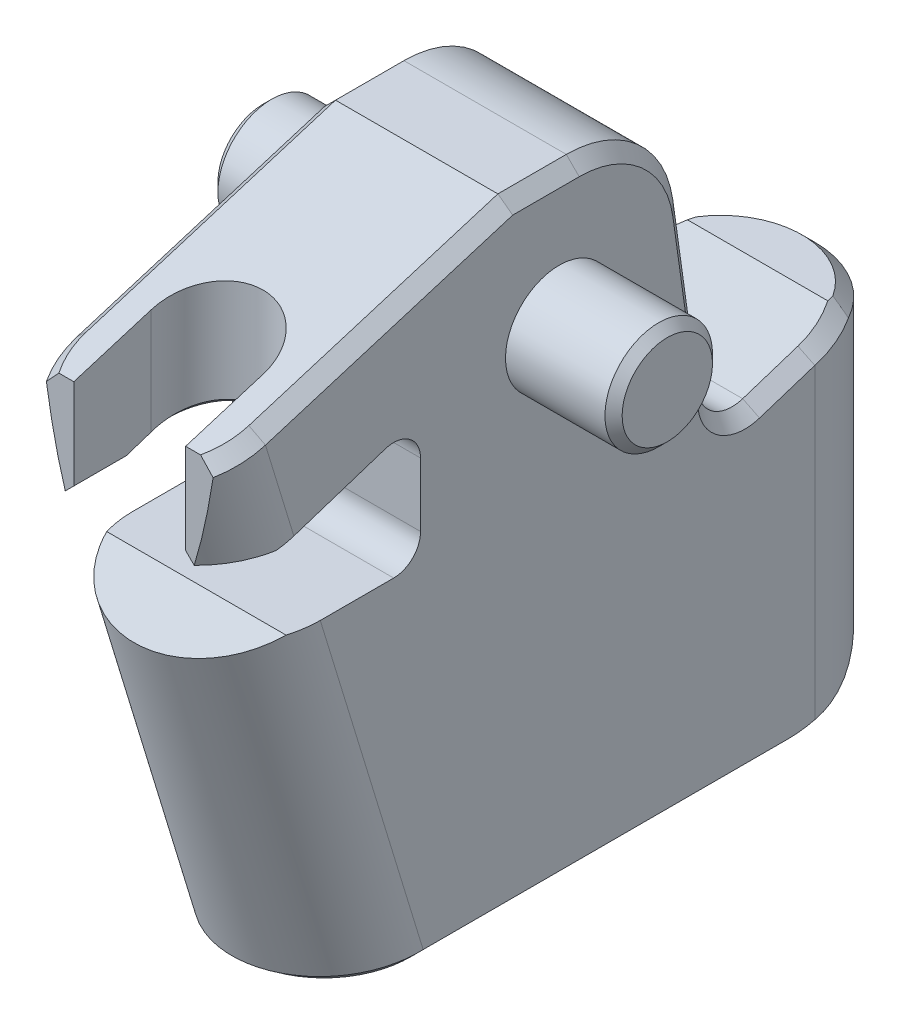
ISO-10303-21;
HEADER;
FILE_DESCRIPTION(('STEP AP214'),'2;1');
FILE_NAME('part.step','',(''),(''),'','','');
FILE_SCHEMA(('AUTOMOTIVE_DESIGN { 1 0 10303 214 1 1 1 1 }'));
ENDSEC;
DATA;
#1=APPLICATION_CONTEXT('core data for automotive mechanical design processes');
#2=APPLICATION_PROTOCOL_DEFINITION('international standard','automotive_design',2000,#1);
#3=PRODUCT_CONTEXT('',#1,'mechanical');
#4=PRODUCT('Part','Part','',(#3));
#5=PRODUCT_RELATED_PRODUCT_CATEGORY('part','',(#4));
#6=PRODUCT_DEFINITION_FORMATION('','',#4);
#7=PRODUCT_DEFINITION_CONTEXT('part definition',#1,'design');
#8=PRODUCT_DEFINITION('design','',#6,#7);
#9=PRODUCT_DEFINITION_SHAPE('','',#8);
#10=(LENGTH_UNIT() NAMED_UNIT(*) SI_UNIT(.MILLI.,.METRE.));
#11=(NAMED_UNIT(*) PLANE_ANGLE_UNIT() SI_UNIT($,.RADIAN.));
#12=(NAMED_UNIT(*) SI_UNIT($,.STERADIAN.) SOLID_ANGLE_UNIT());
#13=UNCERTAINTY_MEASURE_WITH_UNIT(LENGTH_MEASURE(1.E-05),#10,'distance_accuracy_value','');
#14=(GEOMETRIC_REPRESENTATION_CONTEXT(3) GLOBAL_UNCERTAINTY_ASSIGNED_CONTEXT((#13)) GLOBAL_UNIT_ASSIGNED_CONTEXT((#10,
#11,#12)) REPRESENTATION_CONTEXT('',''));
#15=CARTESIAN_POINT('',(0.,0.,0.));
#16=DIRECTION('',(0.,0.,1.));
#17=DIRECTION('',(1.,0.,0.));
#18=AXIS2_PLACEMENT_3D('',#15,#16,#17);
#19=CARTESIAN_POINT('',(12.14764525,0.,0.));
#20=DIRECTION('',(-1.,0.,0.));
#21=DIRECTION('',(0.,0.,1.));
#22=AXIS2_PLACEMENT_3D('',#19,#20,#21);
#23=PLANE('',#22);
#24=CARTESIAN_POINT('',(12.1476452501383,0.,0.));
#25=DIRECTION('',(-1.,0.,0.));
#26=DIRECTION('',(0.,0.,1.));
#27=AXIS2_PLACEMENT_3D('',#24,#25,#26);
#28=CIRCLE('',#27,2.6669999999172);
#29=CARTESIAN_POINT('',(12.1476452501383,0.,2.66699999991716));
#30=VERTEX_POINT('',#29);
#31=EDGE_CURVE('P0_E17',#30,#30,#28,.T.);
#32=ORIENTED_EDGE('',*,*,#31,.F.);
#33=EDGE_LOOP('',(#32));
#34=FACE_BOUND('',#33,.T.);
#35=ADVANCED_FACE('P0_F14',(#34),#23,.F.);
#36=CARTESIAN_POINT('',(-11.72835475,0.,0.));
#37=DIRECTION('',(1.,0.,0.));
#38=DIRECTION('',(0.,0.,-1.));
#39=AXIS2_PLACEMENT_3D('',#36,#37,#38);
#40=PLANE('',#39);
#41=CARTESIAN_POINT('',(-11.7283547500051,0.,0.));
#42=DIRECTION('',(1.,0.,0.));
#43=DIRECTION('',(0.,0.,-1.));
#44=AXIS2_PLACEMENT_3D('',#41,#42,#43);
#45=CIRCLE('',#44,2.666999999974);
#46=CARTESIAN_POINT('',(-11.7283547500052,0.,-2.66699999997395));
#47=VERTEX_POINT('',#46);
#48=EDGE_CURVE('P0_E26',#47,#47,#45,.T.);
#49=ORIENTED_EDGE('',*,*,#48,.F.);
#50=EDGE_LOOP('',(#49));
#51=FACE_BOUND('',#50,.T.);
#52=ADVANCED_FACE('P0_F37',(#51),#40,.F.);
#53=CARTESIAN_POINT('',(11.6396452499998,0.,0.));
#54=DIRECTION('',(-1.,0.,0.));
#55=DIRECTION('',(0.,0.,1.));
#56=AXIS2_PLACEMENT_3D('',#53,#54,#55);
#57=CONICAL_SURFACE('',#56,3.1750000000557,0.785398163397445);
#58=CARTESIAN_POINT('',(11.63964525,0.,0.));
#59=DIRECTION('',(-1.,0.,0.));
#60=DIRECTION('',(0.,0.,1.));
#61=AXIS2_PLACEMENT_3D('',#58,#59,#60);
#62=CIRCLE('',#61,3.175);
#63=CARTESIAN_POINT('',(11.63964525,0.,3.17499999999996));
#64=VERTEX_POINT('',#63);
#65=EDGE_CURVE('P0_E21',#64,#64,#62,.T.);
#66=ORIENTED_EDGE('',*,*,#65,.F.);
#67=EDGE_LOOP('',(#66));
#68=FACE_BOUND('',#67,.T.);
#69=ORIENTED_EDGE('',*,*,#31,.T.);
#70=EDGE_LOOP('',(#69));
#71=FACE_BOUND('',#70,.T.);
#72=ADVANCED_FACE('P0_F34',(#68,#71),#57,.T.);
#73=CARTESIAN_POINT('',(-11.2203547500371,0.,0.));
#74=DIRECTION('',(1.,0.,0.));
#75=DIRECTION('',(0.,0.,-1.));
#76=AXIS2_PLACEMENT_3D('',#73,#74,#75);
#77=CONICAL_SURFACE('',#76,3.17499999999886,0.785398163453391);
#78=CARTESIAN_POINT('',(-11.22035475,0.,0.));
#79=DIRECTION('',(-1.,0.,0.));
#80=DIRECTION('',(0.,0.,1.));
#81=AXIS2_PLACEMENT_3D('',#78,#79,#80);
#82=CIRCLE('',#81,3.175);
#83=CARTESIAN_POINT('',(-11.22035475,0.,3.17500000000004));
#84=VERTEX_POINT('',#83);
#85=EDGE_CURVE('P0_E10',#84,#84,#82,.F.);
#86=ORIENTED_EDGE('',*,*,#85,.F.);
#87=EDGE_LOOP('',(#86));
#88=FACE_BOUND('',#87,.T.);
#89=ORIENTED_EDGE('',*,*,#48,.T.);
#90=EDGE_LOOP('',(#89));
#91=FACE_BOUND('',#90,.T.);
#92=ADVANCED_FACE('P0_F45',(#88,#91),#77,.T.);
#93=CARTESIAN_POINT('',(-11.3720299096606,0.,0.));
#94=DIRECTION('',(-1.,0.,0.));
#95=DIRECTION('',(0.,0.,1.));
#96=AXIS2_PLACEMENT_3D('',#93,#94,#95);
#97=CYLINDRICAL_SURFACE('',#96,3.175);
#98=ORIENTED_EDGE('',*,*,#85,.T.);
#99=EDGE_LOOP('',(#98));
#100=FACE_BOUND('',#99,.T.);
#101=ORIENTED_EDGE('',*,*,#65,.T.);
#102=EDGE_LOOP('',(#101));
#103=FACE_BOUND('',#102,.T.);
#104=ADVANCED_FACE('P0_F43',(#100,#103),#97,.T.);
#105=CLOSED_SHELL('',(#35,#52,#72,#92,#104));
#106=MANIFOLD_SOLID_BREP('P0_B1',#105);
#107=CARTESIAN_POINT('',(3.51164525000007,-2.6416,19.812));
#108=DIRECTION('',(0.707106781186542,0.707106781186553,0.));
#109=DIRECTION('',(-0.707106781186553,0.707106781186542,0.));
#110=AXIS2_PLACEMENT_3D('',#107,#108,#109);
#111=PLANE('',#110);
#112=DIRECTION('',(0.,0.,-1.));
#113=VECTOR('',#112,1.);
#114=CARTESIAN_POINT('',(3.51164525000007,-2.6416,19.812));
#115=LINE('',#114,#113);
#116=CARTESIAN_POINT('',(3.51164525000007,-2.6416,19.812));
#117=VERTEX_POINT('',#116);
#118=CARTESIAN_POINT('',(3.51164525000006,-2.6416,16.7137881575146));
#119=VERTEX_POINT('',#118);
#120=EDGE_CURVE('P1_E527',#117,#119,#115,.T.);
#121=ORIENTED_EDGE('',*,*,#120,.T.);
#122=DIRECTION('',(-0.702713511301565,0.702713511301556,0.111298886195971));
#123=VECTOR('',#122,1.);
#124=CARTESIAN_POINT('',(4.01964525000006,-3.1496,16.6333288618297));
#125=LINE('',#124,#123);
#126=CARTESIAN_POINT('',(4.01964525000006,-3.1496,16.6333288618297));
#127=VERTEX_POINT('',#126);
#128=EDGE_CURVE('P1_E514',#127,#119,#125,.T.);
#129=ORIENTED_EDGE('',*,*,#128,.F.);
#130=DIRECTION('',(0.,0.,1.));
#131=VECTOR('',#130,1.);
#132=CARTESIAN_POINT('',(4.01964525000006,-3.1496,16.6333288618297));
#133=LINE('',#132,#131);
#134=CARTESIAN_POINT('',(4.01964525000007,-3.1496,19.8075734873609));
#135=VERTEX_POINT('',#134);
#136=EDGE_CURVE('P1_E565',#127,#135,#133,.T.);
#137=ORIENTED_EDGE('',*,*,#136,.T.);
#138=DIRECTION('',(0.522411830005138,-0.522411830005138,-0.673922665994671));
#139=VECTOR('',#138,1.);
#140=CARTESIAN_POINT('',(4.01621390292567,-3.1461686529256,19.812));
#141=LINE('',#140,#139);
#142=CARTESIAN_POINT('',(4.01621390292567,-3.1461686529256,19.812));
#143=VERTEX_POINT('',#142);
#144=EDGE_CURVE('P1_E512',#143,#135,#141,.T.);
#145=ORIENTED_EDGE('',*,*,#144,.F.);
#146=DIRECTION('',(-0.707106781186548,0.707106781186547,0.));
#147=VECTOR('',#146,1.);
#148=CARTESIAN_POINT('',(4.01621390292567,-3.1461686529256,19.812));
#149=LINE('',#148,#147);
#150=EDGE_CURVE('P1_E520',#143,#117,#149,.T.);
#151=ORIENTED_EDGE('',*,*,#150,.T.);
#152=EDGE_LOOP('',(#121,#129,#137,#145,#151));
#153=FACE_BOUND('',#152,.T.);
#154=ADVANCED_FACE('P1_F15',(#153),#111,.F.);
#155=CARTESIAN_POINT('',(-4.58460475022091,-21.463,-13.5382));
#156=DIRECTION('',(1.,0.,0.));
#157=DIRECTION('',(0.,0.,-1.));
#158=AXIS2_PLACEMENT_3D('',#155,#156,#157);
#159=CONICAL_SURFACE('',#158,7.11199999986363,0.785398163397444);
#160=DIRECTION('',(-0.70710678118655,0.685556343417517,0.173241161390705));
#161=VECTOR('',#160,1.);
#162=CARTESIAN_POINT('',(498974.765195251,-483800.353640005,-122265.221341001));
#163=LINE('',#162,#161);
#164=CARTESIAN_POINT('',(-5.34660475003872,-27.6194715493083,-15.0939499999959));
#165=VERTEX_POINT('',#164);
#166=CARTESIAN_POINT('',(-4.58460475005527,-28.3582481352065,-15.2806399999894));
#167=VERTEX_POINT('',#166);
#168=EDGE_CURVE('P1_E543',#165,#167,#163,.F.);
#169=ORIENTED_EDGE('',*,*,#168,.T.);
#170=CARTESIAN_POINT('',(-4.58460475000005,-21.463,-13.5382));
#171=DIRECTION('',(1.,0.,0.));
#172=DIRECTION('',(0.,0.,-1.));
#173=AXIS2_PLACEMENT_3D('',#170,#171,#172);
#174=CIRCLE('',#173,7.112);
#175=CARTESIAN_POINT('',(-4.58460475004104,-28.5749999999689,-13.5382));
#176=VERTEX_POINT('',#175);
#177=EDGE_CURVE('P1_E625',#176,#167,#174,.T.);
#178=ORIENTED_EDGE('',*,*,#177,.F.);
#179=DIRECTION('',(-0.70710678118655,0.707106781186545,0.));
#180=VECTOR('',#179,1.);
#181=CARTESIAN_POINT('',(498974.765195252,-499007.924799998,-13.5382000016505));
#182=LINE('',#181,#180);
#183=CARTESIAN_POINT('',(-5.34660475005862,-27.8129999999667,-13.5382));
#184=VERTEX_POINT('',#183);
#185=EDGE_CURVE('P1_E524',#176,#184,#182,.T.);
#186=ORIENTED_EDGE('',*,*,#185,.T.);
#187=CARTESIAN_POINT('',(-5.34660475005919,-21.463,-13.5382));
#188=DIRECTION('',(1.,0.,0.));
#189=DIRECTION('',(0.,0.,-1.));
#190=AXIS2_PLACEMENT_3D('',#187,#188,#189);
#191=CIRCLE('',#190,6.35000000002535);
#192=EDGE_CURVE('P1_E545',#184,#165,#191,.T.);
#193=ORIENTED_EDGE('',*,*,#192,.T.);
#194=EDGE_LOOP('',(#169,#178,#186,#193));
#195=FACE_BOUND('',#194,.T.);
#196=ADVANCED_FACE('P1_F968',(#195),#159,.T.);
#197=CARTESIAN_POINT('',(5.00389524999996,-21.463,-13.5382));
#198=DIRECTION('',(-1.,0.,0.));
#199=DIRECTION('',(0.,0.,1.));
#200=AXIS2_PLACEMENT_3D('',#197,#198,#199);
#201=CONICAL_SURFACE('',#200,7.112,0.785398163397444);
#202=DIRECTION('',(0.707106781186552,0.707106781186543,0.));
#203=VECTOR('',#202,1.);
#204=CARTESIAN_POINT('',(5.00389524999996,-28.575,-13.5382));
#205=LINE('',#204,#203);
#206=CARTESIAN_POINT('',(5.76589524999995,-27.813,-13.5382));
#207=VERTEX_POINT('',#206);
#208=CARTESIAN_POINT('',(5.00389524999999,-28.575,-13.5382));
#209=VERTEX_POINT('',#208);
#210=EDGE_CURVE('P1_E552',#207,#209,#205,.F.);
#211=ORIENTED_EDGE('',*,*,#210,.T.);
#212=CARTESIAN_POINT('',(5.00389524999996,-21.463,-13.5382));
#213=DIRECTION('',(1.,0.,0.));
#214=DIRECTION('',(0.,0.,-1.));
#215=AXIS2_PLACEMENT_3D('',#212,#213,#214);
#216=CIRCLE('',#215,7.112);
#217=CARTESIAN_POINT('',(5.00389524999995,-28.3582481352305,-15.28064));
#218=VERTEX_POINT('',#217);
#219=EDGE_CURVE('P1_E400',#218,#209,#216,.F.);
#220=ORIENTED_EDGE('',*,*,#219,.F.);
#221=DIRECTION('',(0.707106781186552,0.685556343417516,0.173241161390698));
#222=VECTOR('',#221,1.);
#223=CARTESIAN_POINT('',(5.00389524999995,-28.3582481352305,-15.28064));
#224=LINE('',#223,#222);
#225=CARTESIAN_POINT('',(5.76589524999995,-27.619471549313,-15.09395));
#226=VERTEX_POINT('',#225);
#227=EDGE_CURVE('P1_E190',#218,#226,#224,.T.);
#228=ORIENTED_EDGE('',*,*,#227,.T.);
#229=CARTESIAN_POINT('',(5.76589524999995,-21.463,-13.5382));
#230=DIRECTION('',(-1.,0.,0.));
#231=DIRECTION('',(0.,0.,1.));
#232=AXIS2_PLACEMENT_3D('',#229,#230,#231);
#233=CIRCLE('',#232,6.35000000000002);
#234=EDGE_CURVE('P1_E181',#226,#207,#233,.T.);
#235=ORIENTED_EDGE('',*,*,#234,.T.);
#236=EDGE_LOOP('',(#211,#220,#228,#235));
#237=FACE_BOUND('',#236,.T.);
#238=ADVANCED_FACE('P1_F1252',(#237),#201,.T.);
#239=CARTESIAN_POINT('',(5.76589525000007,2.6924,19.812));
#240=DIRECTION('',(0.,0.,-1.));
#241=DIRECTION('',(-1.,0.,0.));
#242=AXIS2_PLACEMENT_3D('',#239,#240,#241);
#243=PLANE('',#242);
#244=CARTESIAN_POINT('',(4.39380842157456,2.69239999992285,19.812));
#245=CARTESIAN_POINT('',(4.51739003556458,2.55979380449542,19.812));
#246=CARTESIAN_POINT('',(4.64086579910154,2.42708927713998,19.812));
#247=CARTESIAN_POINT('',(4.88760561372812,2.16148357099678,19.812));
#248=CARTESIAN_POINT('',(5.01086966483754,2.0285823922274,19.812));
#249=CARTESIAN_POINT('',(5.1340278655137,1.89558288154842,19.812));
#250=B_SPLINE_CURVE_WITH_KNOTS('',3,(#244,#245,#246,#247,#248,#249),.UNSPECIFIED.,.F.,.F.,(4,2,
4),(0.,0.543792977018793,1.08758590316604),.UNSPECIFIED.);
#251=CARTESIAN_POINT('',(4.39380842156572,2.69239999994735,19.8119999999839));
#252=VERTEX_POINT('',#251);
#253=CARTESIAN_POINT('',(5.13402786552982,1.89558288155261,19.812));
#254=VERTEX_POINT('',#253);
#255=EDGE_CURVE('P1_E401',#252,#254,#250,.T.);
#256=ORIENTED_EDGE('',*,*,#255,.F.);
#257=DIRECTION('',(-1.,0.,0.));
#258=VECTOR('',#257,1.);
#259=CARTESIAN_POINT('',(5.76589525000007,2.6924,19.812));
#260=LINE('',#259,#258);
#261=CARTESIAN_POINT('',(3.51164525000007,2.6924,19.812));
#262=VERTEX_POINT('',#261);
#263=EDGE_CURVE('P1_E517',#262,#252,#260,.F.);
#264=ORIENTED_EDGE('',*,*,#263,.F.);
#265=DIRECTION('',(0.,1.,0.));
#266=VECTOR('',#265,1.);
#267=CARTESIAN_POINT('',(3.51164525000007,-28.576,19.812));
#268=LINE('',#267,#266);
#269=EDGE_CURVE('P1_E531',#262,#117,#268,.F.);
#270=ORIENTED_EDGE('',*,*,#269,.T.);
#271=ORIENTED_EDGE('',*,*,#150,.F.);
#272=CARTESIAN_POINT('',(0.209645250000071,10.6973804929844,19.812));
#273=DIRECTION('',(0.,0.,-1.));
#274=DIRECTION('',(0.,1.,0.));
#275=AXIS2_PLACEMENT_3D('',#272,#273,#274);
#276=ELLIPSE('',#275,19.004061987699,5.55625000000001);
#277=EDGE_CURVE('P1_E388',#254,#143,#276,.T.);
#278=ORIENTED_EDGE('',*,*,#277,.F.);
#279=EDGE_LOOP('',(#256,#264,#270,#271,#278));
#280=FACE_BOUND('',#279,.T.);
#281=ADVANCED_FACE('P1_F1140',(#280),#243,.F.);
#282=CARTESIAN_POINT('',(5.76589525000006,-3.1496,16.6333288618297));
#283=DIRECTION('',(0.,1.,0.));
#284=DIRECTION('',(0.,0.,1.));
#285=AXIS2_PLACEMENT_3D('',#282,#283,#284);
#286=PLANE('',#285);
#287=ORIENTED_EDGE('',*,*,#136,.F.);
#288=DIRECTION('',(1.,0.,0.));
#289=VECTOR('',#288,1.);
#290=CARTESIAN_POINT('',(5.76589525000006,-3.1496,16.6333288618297));
#291=LINE('',#290,#289);
#292=CARTESIAN_POINT('',(5.67356917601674,-3.1496,16.6333288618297));
#293=VERTEX_POINT('',#292);
#294=EDGE_CURVE('P1_E519',#293,#127,#291,.F.);
#295=ORIENTED_EDGE('',*,*,#294,.F.);
#296=CARTESIAN_POINT('',(0.209645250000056,-3.1496,15.5785532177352));
#297=DIRECTION('',(0.,1.,0.));
#298=DIRECTION('',(0.,0.,1.));
#299=AXIS2_PLACEMENT_3D('',#296,#297,#298);
#300=ELLIPSE('',#299,5.81012482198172,5.55625000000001);
#301=EDGE_CURVE('P1_E385',#135,#293,#300,.T.);
#302=ORIENTED_EDGE('',*,*,#301,.F.);
#303=EDGE_LOOP('',(#287,#295,#302));
#304=FACE_BOUND('',#303,.T.);
#305=ADVANCED_FACE('P1_F1273',(#304),#286,.F.);
#306=CARTESIAN_POINT('',(0.209645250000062,2.6479712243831,17.351048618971));
#307=DIRECTION('',(0.,-0.956304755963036,-0.292371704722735));
#308=DIRECTION('',(0.,0.292371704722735,-0.956304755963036));
#309=AXIS2_PLACEMENT_3D('',#306,#307,#308);
#310=CONICAL_SURFACE('',#309,5.55624999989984,0.785398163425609);
#311=DIRECTION('',(0.707106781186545,-0.676209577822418,-0.206738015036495));
#312=VECTOR('',#311,1.);
#313=CARTESIAN_POINT('',(5.00389525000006,3.37667544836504,17.5738358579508));
#314=LINE('',#313,#312);
#315=CARTESIAN_POINT('',(5.00389525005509,3.3766754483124,17.5738358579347));
#316=VERTEX_POINT('',#315);
#317=CARTESIAN_POINT('',(5.76589525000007,2.64797122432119,17.351048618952));
#318=VERTEX_POINT('',#317);
#319=EDGE_CURVE('P1_E700',#316,#318,#314,.T.);
#320=ORIENTED_EDGE('',*,*,#319,.F.);
#321=CARTESIAN_POINT('',(0.209645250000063,3.37667544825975,17.5738358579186));
#322=DIRECTION('',(0.,-0.956304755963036,-0.292371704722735));
#323=DIRECTION('',(0.,0.292371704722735,-0.956304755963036));
#324=AXIS2_PLACEMENT_3D('',#321,#322,#323);
#325=CIRCLE('',#324,4.79425000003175);
#326=EDGE_CURVE('P1_E378',#316,#252,#325,.T.);
#327=ORIENTED_EDGE('',*,*,#326,.T.);
#328=ORIENTED_EDGE('',*,*,#255,.T.);
#329=CARTESIAN_POINT('',(0.209645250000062,2.64797122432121,17.351048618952));
#330=DIRECTION('',(0.,0.956304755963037,0.292371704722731));
#331=DIRECTION('',(0.,-0.292371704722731,0.956304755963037));
#332=AXIS2_PLACEMENT_3D('',#329,#330,#331);
#333=CIRCLE('',#332,5.55625000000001);
#334=EDGE_CURVE('P1_E391',#318,#254,#333,.F.);
#335=ORIENTED_EDGE('',*,*,#334,.F.);
#336=EDGE_LOOP('',(#320,#327,#328,#335));
#337=FACE_BOUND('',#336,.T.);
#338=ADVANCED_FACE('P1_F1233',(#337),#310,.T.);
#339=CARTESIAN_POINT('',(3.51164525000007,-28.576,19.812));
#340=DIRECTION('',(1.,0.,0.));
#341=DIRECTION('',(0.,0.,-1.));
#342=AXIS2_PLACEMENT_3D('',#339,#340,#341);
#343=PLANE('',#342);
#344=DIRECTION('',(0.,0.309016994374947,-0.951056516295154));
#345=VECTOR('',#344,1.);
#346=CARTESIAN_POINT('',(3.51164525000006,-2.6416,16.7137881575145));
#347=LINE('',#346,#345);
#348=CARTESIAN_POINT('',(3.51164525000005,-2.16273719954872,15.24));
#349=VERTEX_POINT('',#348);
#350=EDGE_CURVE('P1_E530',#119,#349,#347,.T.);
#351=ORIENTED_EDGE('',*,*,#350,.F.);
#352=ORIENTED_EDGE('',*,*,#120,.F.);
#353=ORIENTED_EDGE('',*,*,#269,.F.);
#354=DIRECTION('',(0.,0.29237170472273,-0.956304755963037));
#355=VECTOR('',#354,1.);
#356=CARTESIAN_POINT('',(3.51164525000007,7.874,2.86375007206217));
#357=LINE('',#356,#355);
#358=CARTESIAN_POINT('',(3.51164525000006,4.09020067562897,15.24));
#359=VERTEX_POINT('',#358);
#360=EDGE_CURVE('P1_E377',#262,#359,#357,.T.);
#361=ORIENTED_EDGE('',*,*,#360,.T.);
#362=DIRECTION('',(0.,1.,0.));
#363=VECTOR('',#362,1.);
#364=CARTESIAN_POINT('',(3.51164525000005,-28.576,15.24));
#365=LINE('',#364,#363);
#366=EDGE_CURVE('P1_E620',#359,#349,#365,.F.);
#367=ORIENTED_EDGE('',*,*,#366,.T.);
#368=EDGE_LOOP('',(#351,#352,#353,#361,#367));
#369=FACE_BOUND('',#368,.T.);
#370=ADVANCED_FACE('P1_F1137',(#369),#343,.F.);
#371=CARTESIAN_POINT('',(-3.09235474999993,-28.576,19.812));
#372=DIRECTION('',(-1.,0.,0.));
#373=DIRECTION('',(0.,0.,1.));
#374=AXIS2_PLACEMENT_3D('',#371,#372,#373);
#375=PLANE('',#374);
#376=DIRECTION('',(0.,-0.309016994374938,0.951056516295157));
#377=VECTOR('',#376,1.);
#378=CARTESIAN_POINT('',(-3.09235474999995,-2.16273719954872,15.24));
#379=LINE('',#378,#377);
#380=CARTESIAN_POINT('',(-3.09235474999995,-2.16273719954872,15.24));
#381=VERTEX_POINT('',#380);
#382=CARTESIAN_POINT('',(-3.09235474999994,-2.6416,16.7137881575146));
#383=VERTEX_POINT('',#382);
#384=EDGE_CURVE('P1_E535',#381,#383,#379,.T.);
#385=ORIENTED_EDGE('',*,*,#384,.F.);
#386=DIRECTION('',(0.,1.,0.));
#387=VECTOR('',#386,1.);
#388=CARTESIAN_POINT('',(-3.09235474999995,-28.576,15.24));
#389=LINE('',#388,#387);
#390=CARTESIAN_POINT('',(-3.09235474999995,4.09020067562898,15.24));
#391=VERTEX_POINT('',#390);
#392=EDGE_CURVE('P1_E623',#381,#391,#389,.T.);
#393=ORIENTED_EDGE('',*,*,#392,.T.);
#394=DIRECTION('',(0.,0.29237170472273,-0.956304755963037));
#395=VECTOR('',#394,1.);
#396=CARTESIAN_POINT('',(-3.09235474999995,7.87400000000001,2.86375007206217));
#397=LINE('',#396,#395);
#398=CARTESIAN_POINT('',(-3.09235474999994,2.6924,19.812));
#399=VERTEX_POINT('',#398);
#400=EDGE_CURVE('P1_E376',#391,#399,#397,.F.);
#401=ORIENTED_EDGE('',*,*,#400,.T.);
#402=DIRECTION('',(0.,1.,0.));
#403=VECTOR('',#402,1.);
#404=CARTESIAN_POINT('',(-3.09235474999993,2.6924,19.812));
#405=LINE('',#404,#403);
#406=CARTESIAN_POINT('',(-3.09235474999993,-2.6416,19.812));
#407=VERTEX_POINT('',#406);
#408=EDGE_CURVE('P1_E606',#399,#407,#405,.F.);
#409=ORIENTED_EDGE('',*,*,#408,.T.);
#410=DIRECTION('',(0.,0.,1.));
#411=VECTOR('',#410,1.);
#412=CARTESIAN_POINT('',(-3.09235474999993,-2.6416,19.812));
#413=LINE('',#412,#411);
#414=EDGE_CURVE('P1_E540',#407,#383,#413,.F.);
#415=ORIENTED_EDGE('',*,*,#414,.T.);
#416=EDGE_LOOP('',(#385,#393,#401,#409,#415));
#417=FACE_BOUND('',#416,.T.);
#418=ADVANCED_FACE('P1_F1262',(#417),#375,.F.);
#419=CARTESIAN_POINT('',(-3.09235474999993,-2.6416,19.812));
#420=DIRECTION('',(-0.707106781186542,0.707106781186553,0.));
#421=DIRECTION('',(-0.707106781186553,-0.707106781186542,0.));
#422=AXIS2_PLACEMENT_3D('',#419,#420,#421);
#423=PLANE('',#422);
#424=DIRECTION('',(0.,0.,1.));
#425=VECTOR('',#424,1.);
#426=CARTESIAN_POINT('',(-3.60035474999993,-3.1496,16.6333288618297));
#427=LINE('',#426,#425);
#428=CARTESIAN_POINT('',(-3.60035474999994,-3.1496,19.8075734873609));
#429=VERTEX_POINT('',#428);
#430=CARTESIAN_POINT('',(-3.60035474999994,-3.1496,16.6333288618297));
#431=VERTEX_POINT('',#430);
#432=EDGE_CURVE('P1_E803',#429,#431,#427,.F.);
#433=ORIENTED_EDGE('',*,*,#432,.T.);
#434=DIRECTION('',(-0.70271351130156,-0.70271351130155,-0.111298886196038));
#435=VECTOR('',#434,1.);
#436=CARTESIAN_POINT('',(-3.09235474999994,-2.6416,16.7137881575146));
#437=LINE('',#436,#435);
#438=EDGE_CURVE('P1_E603',#383,#431,#437,.T.);
#439=ORIENTED_EDGE('',*,*,#438,.F.);
#440=ORIENTED_EDGE('',*,*,#414,.F.);
#441=DIRECTION('',(-0.707106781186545,-0.70710678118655,0.));
#442=VECTOR('',#441,1.);
#443=CARTESIAN_POINT('',(-3.09235474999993,-2.6416,19.812));
#444=LINE('',#443,#442);
#445=CARTESIAN_POINT('',(-3.59692340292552,-3.14616865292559,19.812));
#446=VERTEX_POINT('',#445);
#447=EDGE_CURVE('P1_E609',#407,#446,#444,.T.);
#448=ORIENTED_EDGE('',*,*,#447,.T.);
#449=DIRECTION('',(0.522411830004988,0.522411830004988,0.673922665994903));
#450=VECTOR('',#449,1.);
#451=CARTESIAN_POINT('',(-3.60035474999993,-3.1496,19.8075734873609));
#452=LINE('',#451,#450);
#453=EDGE_CURVE('P1_E618',#429,#446,#452,.T.);
#454=ORIENTED_EDGE('',*,*,#453,.F.);
#455=EDGE_LOOP('',(#433,#439,#440,#448,#454));
#456=FACE_BOUND('',#455,.T.);
#457=ADVANCED_FACE('P1_F1163',(#456),#423,.F.);
#458=CARTESIAN_POINT('',(0.209645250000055,-28.576,15.24));
#459=DIRECTION('',(0.,1.,0.));
#460=DIRECTION('',(0.,0.,1.));
#461=AXIS2_PLACEMENT_3D('',#458,#459,#460);
#462=CYLINDRICAL_SURFACE('',#461,3.302);
#463=CARTESIAN_POINT('',(3.51164525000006,-2.16273719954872,15.24));
#464=CARTESIAN_POINT('',(3.51164267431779,-2.12571682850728,15.1412354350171));
#465=CARTESIAN_POINT('',(3.50721241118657,-2.08870708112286,15.0425155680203));
#466=CARTESIAN_POINT('',(3.48951563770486,-2.01494175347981,14.8457655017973));
#467=CARTESIAN_POINT('',(3.47624831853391,-1.9781861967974,14.7477353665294));
#468=CARTESIAN_POINT('',(3.423201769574,-1.86862136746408,14.4555030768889));
#469=CARTESIAN_POINT('',(3.37017798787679,-1.79655407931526,14.2632660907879));
#470=CARTESIAN_POINT('',(3.22960673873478,-1.65656946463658,13.8898675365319));
#471=CARTESIAN_POINT('',(3.14201811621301,-1.58865719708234,13.7087194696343));
#472=CARTESIAN_POINT('',(2.98628531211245,-1.49170860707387,13.45013007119));
#473=CARTESIAN_POINT('',(2.93030277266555,-1.46020671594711,13.3661072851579));
#474=CARTESIAN_POINT('',(2.81051508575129,-1.39910302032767,13.2031175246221));
#475=CARTESIAN_POINT('',(2.74671350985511,-1.36950035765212,13.1241482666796));
#476=CARTESIAN_POINT('',(2.61470332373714,-1.31373607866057,12.9754152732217));
#477=CARTESIAN_POINT('',(2.54682031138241,-1.28747970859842,12.9053976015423));
#478=CARTESIAN_POINT('',(2.40470677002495,-1.23721098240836,12.7713069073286));
#479=CARTESIAN_POINT('',(2.33047918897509,-1.21319759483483,12.7072311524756));
#480=CARTESIAN_POINT('',(2.17613799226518,-1.16759988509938,12.5856138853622));
#481=CARTESIAN_POINT('',(2.09602371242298,-1.14601583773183,12.5280731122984));
#482=CARTESIAN_POINT('',(1.93048157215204,-1.10554720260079,12.4201263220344));
#483=CARTESIAN_POINT('',(1.84505403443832,-1.08666245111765,12.36971987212));
#484=CARTESIAN_POINT('',(1.67526801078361,-1.05288688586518,12.2796317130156));
#485=CARTESIAN_POINT('',(1.5912021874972,-1.03781606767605,12.239465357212));
#486=CARTESIAN_POINT('',(1.41956708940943,-1.01036187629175,12.1662401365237));
#487=CARTESIAN_POINT('',(1.33199661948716,-0.997979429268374,12.1331837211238));
#488=CARTESIAN_POINT('',(1.15411412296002,-0.976008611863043,12.0745702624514));
#489=CARTESIAN_POINT('',(1.0638042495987,-0.966418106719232,12.0490074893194));
#490=CARTESIAN_POINT('',(0.881052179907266,-0.950145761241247,12.0056158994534));
#491=CARTESIAN_POINT('',(0.788609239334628,-0.943464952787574,11.9877898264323));
#492=CARTESIAN_POINT('',(0.607653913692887,-0.933378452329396,11.9608726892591));
#493=CARTESIAN_POINT('',(0.519215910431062,-0.929808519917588,11.9513436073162));
#494=CARTESIAN_POINT('',(0.341783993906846,-0.925344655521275,11.9394448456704));
#495=CARTESIAN_POINT('',(0.252789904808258,-0.92445161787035,11.9370775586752));
#496=CARTESIAN_POINT('',(-0.0139316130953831,-0.92583580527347,11.9407962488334));
#497=CARTESIAN_POINT('',(-0.191620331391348,-0.932163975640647,11.9576699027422));
#498=CARTESIAN_POINT('',(-0.537533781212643,-0.95515081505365,12.0189537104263));
#499=CARTESIAN_POINT('',(-0.705879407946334,-0.971586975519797,12.062770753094));
#500=CARTESIAN_POINT('',(-0.950780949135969,-1.00330943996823,12.1474101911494));
#501=CARTESIAN_POINT('',(-1.03118552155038,-1.01506966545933,12.1787971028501));
#502=CARTESIAN_POINT('',(-1.1889822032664,-1.0408687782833,12.2476026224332));
#503=CARTESIAN_POINT('',(-1.26637524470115,-1.05490695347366,12.2850193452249));
#504=CARTESIAN_POINT('',(-1.41925308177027,-1.08541935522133,12.3664046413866));
#505=CARTESIAN_POINT('',(-1.49466518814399,-1.10193800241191,12.4104928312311));
#506=CARTESIAN_POINT('',(-1.64140572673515,-1.13708001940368,12.5042379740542));
#507=CARTESIAN_POINT('',(-1.71273485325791,-1.15570302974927,12.553893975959));
#508=CARTESIAN_POINT('',(-1.85091683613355,-1.19487981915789,12.658375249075));
#509=CARTESIAN_POINT('',(-1.91777057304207,-1.21543321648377,12.713199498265));
#510=CARTESIAN_POINT('',(-2.04670372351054,-1.25832906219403,12.8276282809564));
#511=CARTESIAN_POINT('',(-2.10877944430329,-1.28067286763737,12.8872364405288));
#512=CARTESIAN_POINT('',(-2.29343361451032,-1.35252809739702,13.0789173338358));
#513=CARTESIAN_POINT('',(-2.40732591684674,-1.40485101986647,13.2184768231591));
#514=CARTESIAN_POINT('',(-2.61019302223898,-1.51515194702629,13.5126674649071));
#515=CARTESIAN_POINT('',(-2.69915722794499,-1.5731323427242,13.6673049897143));
#516=CARTESIAN_POINT('',(-2.81520852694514,-1.66503951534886,13.9124605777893));
#517=CARTESIAN_POINT('',(-2.85177739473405,-1.69753641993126,13.9991495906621));
#518=CARTESIAN_POINT('',(-2.91728145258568,-1.76345112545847,14.1749561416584));
#519=CARTESIAN_POINT('',(-2.94622290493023,-1.79686814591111,14.2640716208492));
#520=CARTESIAN_POINT('',(-2.99636543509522,-1.86436581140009,14.4441175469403));
#521=CARTESIAN_POINT('',(-3.01757222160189,-1.89844594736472,14.5350466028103));
#522=CARTESIAN_POINT('',(-3.0521922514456,-1.96710150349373,14.7181764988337));
#523=CARTESIAN_POINT('',(-3.06560736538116,-2.00167680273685,14.8103770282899));
#524=CARTESIAN_POINT('',(-3.08085715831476,-2.05738668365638,14.958975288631));
#525=CARTESIAN_POINT('',(-3.08517224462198,-2.07844649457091,15.0151582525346));
#526=CARTESIAN_POINT('',(-3.09091872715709,-2.12058113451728,15.1275595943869));
#527=CARTESIAN_POINT('',(-3.09235488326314,-2.14165588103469,15.1837777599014));
#528=CARTESIAN_POINT('',(-3.09235474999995,-2.16273719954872,15.24));
#529=B_SPLINE_CURVE_WITH_KNOTS('',3,(#463,#464,#465,#466,#467,#468,#469,#470,#471,#472,#473,
#474,#475,#476,#477,#478,#479,#480,#481,#482,#483,#484,#485,#486,#487,#488,#489,#490,#491,#492,
#493,#494,#495,#496,#497,#498,#499,#500,#501,#502,#503,#504,#505,#506,#507,#508,#509,#510,#511,
#512,#513,#514,#515,#516,#517,#518,#519,#520,#521,#522,#523,#524,#525,#526,#527,#528),
.UNSPECIFIED.,.F.,.F.,(4,2,2,2,2,2,2,2,2,2,2,2,2,2,2,2,2,2,2,2,2,2,2,2,2,2,2,2,2,2,2,2,4),(0.,
0.316240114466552,0.632509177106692,1.26538589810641,1.89901844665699,2.21595835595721,
2.53275402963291,2.83535380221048,3.13781373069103,3.44030783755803,3.74278358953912,
4.02556169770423,4.30843707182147,4.59109558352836,4.87385425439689,5.14057833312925,
5.40739151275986,5.94035246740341,6.46198156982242,6.72307040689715,6.98407777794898,
7.25048935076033,7.51685548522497,7.78316905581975,8.04968642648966,8.60981913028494,
9.17018959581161,9.46853185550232,9.76662840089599,10.0645044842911,10.3623090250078,
10.5427121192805,10.7228166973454),.UNSPECIFIED.);
#530=EDGE_CURVE('P1_E325',#349,#381,#529,.T.);
#531=ORIENTED_EDGE('',*,*,#530,.F.);
#532=ORIENTED_EDGE('',*,*,#366,.F.);
#533=CARTESIAN_POINT('',(0.209645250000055,4.09020067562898,15.24));
#534=DIRECTION('',(0.,-0.956304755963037,-0.29237170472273));
#535=DIRECTION('',(0.,0.29237170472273,-0.956304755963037));
#536=AXIS2_PLACEMENT_3D('',#533,#534,#535);
#537=ELLIPSE('',#536,3.45287417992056,3.302);
#538=EDGE_CURVE('P1_E373',#359,#391,#537,.F.);
#539=ORIENTED_EDGE('',*,*,#538,.T.);
#540=ORIENTED_EDGE('',*,*,#392,.F.);
#541=EDGE_LOOP('',(#531,#532,#539,#540));
#542=FACE_BOUND('',#541,.T.);
#543=ADVANCED_FACE('P1_F1152',(#542),#462,.F.);
#544=CARTESIAN_POINT('',(-5.34660475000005,-21.463,-13.5382));
#545=DIRECTION('',(1.,0.,0.));
#546=DIRECTION('',(0.,0.,-1.));
#547=AXIS2_PLACEMENT_3D('',#544,#545,#546);
#548=CYLINDRICAL_SURFACE('',#547,7.112);
#549=CARTESIAN_POINT('',(5.00389524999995,-28.3582481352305,-15.28064));
#550=CARTESIAN_POINT('',(5.00388024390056,-28.3010134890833,-15.5070970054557));
#551=CARTESIAN_POINT('',(4.99117350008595,-28.2335194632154,-15.7274112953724));
#552=CARTESIAN_POINT('',(4.95548154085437,-28.1178590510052,-16.0494560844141));
#553=CARTESIAN_POINT('',(4.9408014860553,-28.0768975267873,-16.1553961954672));
#554=CARTESIAN_POINT('',(4.90616131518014,-27.9902592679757,-16.3645480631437));
#555=CARTESIAN_POINT('',(4.88620009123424,-27.9445822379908,-16.467759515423));
#556=CARTESIAN_POINT('',(4.84121255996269,-27.8485748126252,-16.6715148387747));
#557=CARTESIAN_POINT('',(4.81619854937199,-27.7982685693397,-16.7720130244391));
#558=CARTESIAN_POINT('',(4.76121517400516,-27.6929327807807,-16.9705621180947));
#559=CARTESIAN_POINT('',(4.73152241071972,-27.6384356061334,-17.0676013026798));
#560=CARTESIAN_POINT('',(4.66819567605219,-27.5261721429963,-17.2571541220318));
#561=CARTESIAN_POINT('',(4.63454228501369,-27.4683697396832,-17.3497346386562));
#562=CARTESIAN_POINT('',(4.56354670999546,-27.3495829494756,-17.5307436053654));
#563=CARTESIAN_POINT('',(4.52620254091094,-27.2885965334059,-17.6191736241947));
#564=CARTESIAN_POINT('',(4.40898130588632,-27.101037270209,-17.8785489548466));
#565=CARTESIAN_POINT('',(4.32395939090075,-26.9699217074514,-18.0435356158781));
#566=CARTESIAN_POINT('',(4.14130805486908,-26.6958701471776,-18.3591201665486));
#567=CARTESIAN_POINT('',(4.0450686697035,-26.5550191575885,-18.5073188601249));
#568=CARTESIAN_POINT('',(3.84445165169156,-26.2667133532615,-18.7865492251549));
#569=CARTESIAN_POINT('',(3.74002333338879,-26.1191935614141,-18.9176340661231));
#570=CARTESIAN_POINT('',(3.52392119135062,-25.8178747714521,-19.1643474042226));
#571=CARTESIAN_POINT('',(3.41223839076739,-25.664069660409,-19.2799676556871));
#572=CARTESIAN_POINT('',(3.23977958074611,-25.4288500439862,-19.4425767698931));
#573=CARTESIAN_POINT('',(3.18146424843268,-25.3496843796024,-19.4949755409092));
#574=CARTESIAN_POINT('',(3.06325579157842,-25.1898772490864,-19.5962426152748));
#575=CARTESIAN_POINT('',(3.00332317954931,-25.1091829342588,-19.6451413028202));
#576=CARTESIAN_POINT('',(2.88205966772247,-24.9465021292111,-19.739376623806));
#577=CARTESIAN_POINT('',(2.82105080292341,-24.8649468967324,-19.7844682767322));
#578=CARTESIAN_POINT('',(2.69821031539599,-24.7012461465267,-19.8708828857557));
#579=CARTESIAN_POINT('',(2.63639950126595,-24.619128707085,-19.9121891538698));
#580=CARTESIAN_POINT('',(2.4498688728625,-24.3719833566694,-20.0306378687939));
#581=CARTESIAN_POINT('',(2.32405266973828,-24.206163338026,-20.1023180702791));
#582=CARTESIAN_POINT('',(2.06980297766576,-23.872424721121,-20.2320234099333));
#583=CARTESIAN_POINT('',(1.94136799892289,-23.7045059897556,-20.2900439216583));
#584=CARTESIAN_POINT('',(1.6821029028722,-23.3665486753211,-20.3929977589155));
#585=CARTESIAN_POINT('',(1.55127186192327,-23.1965101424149,-20.4379286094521));
#586=CARTESIAN_POINT('',(1.28737659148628,-22.8542576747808,-20.5149984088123));
#587=CARTESIAN_POINT('',(1.15431013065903,-22.6820418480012,-20.547133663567));
#588=CARTESIAN_POINT('',(0.953126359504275,-22.422023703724,-20.5857894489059));
#589=CARTESIAN_POINT('',(0.885739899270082,-22.3349899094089,-20.5970853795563));
#590=CARTESIAN_POINT('',(0.750799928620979,-22.1607947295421,-20.6164272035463));
#591=CARTESIAN_POINT('',(0.683279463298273,-22.0736758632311,-20.624472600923));
#592=CARTESIAN_POINT('',(0.548110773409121,-21.8993312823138,-20.6373407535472));
#593=CARTESIAN_POINT('',(0.480451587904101,-21.8120914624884,-20.642162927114));
#594=CARTESIAN_POINT('',(0.378940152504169,-21.6812241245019,-20.6469856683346));
#595=CARTESIAN_POINT('',(0.345054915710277,-21.6375432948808,-20.648191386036));
#596=CARTESIAN_POINT('',(0.294275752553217,-21.5720875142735,-20.6493970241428));
#597=CARTESIAN_POINT('',(0.27731244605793,-21.5502217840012,-20.6496983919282));
#598=CARTESIAN_POINT('',(0.243462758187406,-21.506589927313,-20.6501000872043));
#599=CARTESIAN_POINT('',(0.226422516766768,-21.48462548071,-20.6502003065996));
#600=CARTESIAN_POINT('',(0.20964524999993,-21.463,-20.6502));
#601=B_SPLINE_CURVE_WITH_KNOTS('',3,(#549,#550,#551,#552,#553,#554,#555,#556,#557,#558,#559,
#560,#561,#562,#563,#564,#565,#566,#567,#568,#569,#570,#571,#572,#573,#574,#575,#576,#577,#578,
#579,#580,#581,#582,#583,#584,#585,#586,#587,#588,#589,#590,#591,#592,#593,#594,#595,#596,#597,
#598,#599,#600),.UNSPECIFIED.,.F.,.F.,(4,2,2,2,2,2,2,2,2,2,2,2,2,2,2,2,2,2,2,2,2,2,2,2,2,4),(0.,
0.000614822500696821,0.000922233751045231,0.00122964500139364,0.00153705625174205,
0.00184446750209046,0.00215187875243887,0.00245929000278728,0.00307411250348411,
0.00368893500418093,0.00430375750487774,0.00491858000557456,0.00522599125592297,
0.00553340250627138,0.0058408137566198,0.00614822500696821,0.00676304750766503,
0.00737787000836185,0.00799269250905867,0.00860751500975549,0.0089149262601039,
0.00922233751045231,0.00952974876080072,0.00968345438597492,0.00976030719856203,
0.00983716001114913),.UNSPECIFIED.);
#602=CARTESIAN_POINT('',(0.20964524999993,-21.463,-20.6502));
#603=VERTEX_POINT('',#602);
#604=EDGE_CURVE('P1_E316',#218,#603,#601,.T.);
#605=ORIENTED_EDGE('',*,*,#604,.F.);
#606=ORIENTED_EDGE('',*,*,#219,.T.);
#607=DIRECTION('',(1.,0.,0.));
#608=VECTOR('',#607,1.);
#609=CARTESIAN_POINT('',(5.76589525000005,-28.575,-13.5382));
#610=LINE('',#609,#608);
#611=EDGE_CURVE('P1_E317',#209,#176,#610,.F.);
#612=ORIENTED_EDGE('',*,*,#611,.T.);
#613=ORIENTED_EDGE('',*,*,#177,.T.);
#614=CARTESIAN_POINT('',(0.20964524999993,-21.463,-20.6502));
#615=CARTESIAN_POINT('',(0.192867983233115,-21.4846254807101,-20.6502003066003));
#616=CARTESIAN_POINT('',(0.175827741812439,-21.5065899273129,-20.650100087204));
#617=CARTESIAN_POINT('',(0.141978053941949,-21.5502217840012,-20.6496983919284));
#618=CARTESIAN_POINT('',(0.125014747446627,-21.5720875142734,-20.6493970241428));
#619=CARTESIAN_POINT('',(0.0742355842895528,-21.6375432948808,-20.648191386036));
#620=CARTESIAN_POINT('',(0.0403503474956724,-21.6812241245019,-20.6469856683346));
#621=CARTESIAN_POINT('',(-0.0611610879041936,-21.8120914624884,-20.642162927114));
#622=CARTESIAN_POINT('',(-0.128820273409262,-21.8993312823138,-20.6373407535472));
#623=CARTESIAN_POINT('',(-0.263988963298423,-22.0736758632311,-20.624472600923));
#624=CARTESIAN_POINT('',(-0.331509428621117,-22.1607947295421,-20.6164272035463));
#625=CARTESIAN_POINT('',(-0.466449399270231,-22.3349899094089,-20.5970853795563));
#626=CARTESIAN_POINT('',(-0.533835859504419,-22.422023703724,-20.5857894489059));
#627=CARTESIAN_POINT('',(-0.735019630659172,-22.6820418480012,-20.547133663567));
#628=CARTESIAN_POINT('',(-0.86808609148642,-22.8542576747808,-20.5149984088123));
#629=CARTESIAN_POINT('',(-1.13198136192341,-23.1965101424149,-20.4379286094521));
#630=CARTESIAN_POINT('',(-1.26281240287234,-23.3665486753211,-20.3929977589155));
#631=CARTESIAN_POINT('',(-1.52207749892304,-23.7045059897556,-20.2900439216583));
#632=CARTESIAN_POINT('',(-1.65051247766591,-23.872424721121,-20.2320234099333));
#633=CARTESIAN_POINT('',(-1.90476216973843,-24.206163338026,-20.1023180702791));
#634=CARTESIAN_POINT('',(-2.03057837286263,-24.3719833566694,-20.0306378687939));
#635=CARTESIAN_POINT('',(-2.21710900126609,-24.619128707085,-19.9121891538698));
#636=CARTESIAN_POINT('',(-2.27891981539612,-24.7012461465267,-19.8708828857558));
#637=CARTESIAN_POINT('',(-2.40176030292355,-24.8649468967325,-19.7844682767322));
#638=CARTESIAN_POINT('',(-2.46276916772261,-24.9465021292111,-19.739376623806));
#639=CARTESIAN_POINT('',(-2.58403267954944,-25.1091829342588,-19.6451413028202));
#640=CARTESIAN_POINT('',(-2.64396529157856,-25.1898772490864,-19.5962426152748));
#641=CARTESIAN_POINT('',(-2.76217374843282,-25.3496843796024,-19.4949755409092));
#642=CARTESIAN_POINT('',(-2.82048908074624,-25.4288500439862,-19.4425767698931));
#643=CARTESIAN_POINT('',(-2.99294789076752,-25.664069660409,-19.2799676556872));
#644=CARTESIAN_POINT('',(-3.10463069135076,-25.8178747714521,-19.1643474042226));
#645=CARTESIAN_POINT('',(-3.32073283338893,-26.1191935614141,-18.9176340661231));
#646=CARTESIAN_POINT('',(-3.4251611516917,-26.2667133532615,-18.7865492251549));
#647=CARTESIAN_POINT('',(-3.62577816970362,-26.5550191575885,-18.5073188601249));
#648=CARTESIAN_POINT('',(-3.72201755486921,-26.6958701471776,-18.3591201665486));
#649=CARTESIAN_POINT('',(-3.90466889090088,-26.9699217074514,-18.0435356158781));
#650=CARTESIAN_POINT('',(-3.98969080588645,-27.101037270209,-17.8785489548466));
#651=CARTESIAN_POINT('',(-4.10691204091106,-27.2885965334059,-17.6191736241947));
#652=CARTESIAN_POINT('',(-4.14425620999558,-27.3495829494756,-17.5307436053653));
#653=CARTESIAN_POINT('',(-4.21525178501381,-27.4683697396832,-17.3497346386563));
#654=CARTESIAN_POINT('',(-4.24890517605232,-27.5261721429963,-17.2571541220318));
#655=CARTESIAN_POINT('',(-4.31223191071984,-27.6384356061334,-17.0676013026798));
#656=CARTESIAN_POINT('',(-4.34192467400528,-27.6929327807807,-16.9705621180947));
#657=CARTESIAN_POINT('',(-4.39690804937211,-27.7982685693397,-16.7720130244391));
#658=CARTESIAN_POINT('',(-4.42192205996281,-27.8485748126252,-16.6715148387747));
#659=CARTESIAN_POINT('',(-4.46690959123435,-27.9445822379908,-16.467759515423));
#660=CARTESIAN_POINT('',(-4.48687081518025,-27.9902592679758,-16.3645480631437));
#661=CARTESIAN_POINT('',(-4.5215109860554,-28.0768975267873,-16.1553961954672));
#662=CARTESIAN_POINT('',(-4.53619104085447,-28.1178590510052,-16.0494560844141));
#663=CARTESIAN_POINT('',(-4.57188300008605,-28.2335194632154,-15.7274112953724));
#664=CARTESIAN_POINT('',(-4.58458974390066,-28.3010134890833,-15.5070970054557));
#665=CARTESIAN_POINT('',(-4.58460475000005,-28.3582481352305,-15.28064));
#666=B_SPLINE_CURVE_WITH_KNOTS('',3,(#614,#615,#616,#617,#618,#619,#620,#621,#622,#623,#624,
#625,#626,#627,#628,#629,#630,#631,#632,#633,#634,#635,#636,#637,#638,#639,#640,#641,#642,#643,
#644,#645,#646,#647,#648,#649,#650,#651,#652,#653,#654,#655,#656,#657,#658,#659,#660,#661,#662,
#663,#664,#665),.UNSPECIFIED.,.F.,.F.,(4,2,2,2,2,2,2,2,2,2,2,2,2,2,2,2,2,2,2,2,2,2,2,2,2,4),(0.,
7.68528125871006E-05,0.00015370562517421,0.000307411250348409,0.00061482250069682,
0.000922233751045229,0.00122964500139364,0.00184446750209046,0.00245929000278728,
0.0030741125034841,0.00368893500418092,0.00399634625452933,0.00430375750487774,
0.00461116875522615,0.00491858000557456,0.00553340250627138,0.0061482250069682,
0.00676304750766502,0.00737787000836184,0.00768528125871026,0.00799269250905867,
0.00830010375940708,0.00860751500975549,0.0089149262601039,0.00922233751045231,
0.00983716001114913),.UNSPECIFIED.);
#667=EDGE_CURVE('P1_E653',#603,#167,#666,.T.);
#668=ORIENTED_EDGE('',*,*,#667,.F.);
#669=EDGE_LOOP('',(#605,#606,#612,#613,#668));
#670=FACE_BOUND('',#669,.T.);
#671=ADVANCED_FACE('P1_F415',(#670),#548,.T.);
#672=CARTESIAN_POINT('',(-5.34660475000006,-7.9883,-17.272));
#673=DIRECTION('',(0.,-1.,0.));
#674=DIRECTION('',(0.,0.,-1.));
#675=AXIS2_PLACEMENT_3D('',#672,#673,#674);
#676=PLANE('',#675);
#677=CARTESIAN_POINT('',(4.24940599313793,-7.9883,-17.6756483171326));
#678=CARTESIAN_POINT('',(4.25830998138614,-7.9883,-17.6420993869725));
#679=CARTESIAN_POINT('',(4.26716103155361,-7.9883,-17.6085363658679));
#680=CARTESIAN_POINT('',(4.28476915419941,-7.9883,-17.5413876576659));
#681=CARTESIAN_POINT('',(4.29352623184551,-7.9883,-17.5078019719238));
#682=CARTESIAN_POINT('',(4.30660125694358,-7.9883,-17.4574069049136));
#683=CARTESIAN_POINT('',(4.31094961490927,-7.9883,-17.4406053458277));
#684=CARTESIAN_POINT('',(4.31959930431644,-7.9883,-17.4069901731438));
#685=CARTESIAN_POINT('',(4.32390063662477,-7.9883,-17.3901765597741));
#686=CARTESIAN_POINT('',(4.3322883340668,-7.9883,-17.3564951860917));
#687=CARTESIAN_POINT('',(4.33637469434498,-7.9883,-17.3396274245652));
#688=CARTESIAN_POINT('',(4.34436020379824,-7.9883,-17.3058456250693));
#689=CARTESIAN_POINT('',(4.34825933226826,-7.98830000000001,-17.2889315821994));
#690=CARTESIAN_POINT('',(4.35207832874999,-7.98830000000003,-17.272000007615));
#691=B_SPLINE_CURVE_WITH_KNOTS('',3,(#677,#678,#679,#680,#681,#682,#683,#684,#685,#686,#687,
#688,#689,#690),.UNSPECIFIED.,.F.,.F.,(4,2,2,2,2,2,4),(0.,0.104131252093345,0.208256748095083,
0.260322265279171,0.312386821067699,0.364452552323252,0.416524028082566),.UNSPECIFIED.);
#692=CARTESIAN_POINT('',(4.24940599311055,-7.98830000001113,-17.6756483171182));
#693=VERTEX_POINT('',#692);
#694=CARTESIAN_POINT('',(4.35207831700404,-7.98830000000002,-17.2720000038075));
#695=VERTEX_POINT('',#694);
#696=EDGE_CURVE('P1_E392',#693,#695,#691,.T.);
#697=ORIENTED_EDGE('',*,*,#696,.F.);
#698=CARTESIAN_POINT('',(0.209645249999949,-7.98830000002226,-15.09395));
#699=DIRECTION('',(0.,-1.,0.));
#700=DIRECTION('',(0.,0.,-1.));
#701=AXIS2_PLACEMENT_3D('',#698,#699,#700);
#702=CIRCLE('',#701,4.79424999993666);
#703=CARTESIAN_POINT('',(-3.8301154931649,-7.98829999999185,-17.6756483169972));
#704=VERTEX_POINT('',#703);
#705=EDGE_CURVE('P1_E864',#704,#693,#702,.T.);
#706=ORIENTED_EDGE('',*,*,#705,.F.);
#707=CARTESIAN_POINT('',(-3.9327878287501,-7.9883,-17.2720000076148));
#708=CARTESIAN_POINT('',(-3.92896883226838,-7.9883,-17.2889315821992));
#709=CARTESIAN_POINT('',(-3.92506970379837,-7.9883,-17.3058456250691));
#710=CARTESIAN_POINT('',(-3.91708419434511,-7.9883,-17.339627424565));
#711=CARTESIAN_POINT('',(-3.91299783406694,-7.9883,-17.3564951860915));
#712=CARTESIAN_POINT('',(-3.90461013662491,-7.9883,-17.3901765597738));
#713=CARTESIAN_POINT('',(-3.90030880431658,-7.9883,-17.4069901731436));
#714=CARTESIAN_POINT('',(-3.89165911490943,-7.9883,-17.4406053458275));
#715=CARTESIAN_POINT('',(-3.88731075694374,-7.9883,-17.4574069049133));
#716=CARTESIAN_POINT('',(-3.8742357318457,-7.9883,-17.5078019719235));
#717=CARTESIAN_POINT('',(-3.8654786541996,-7.9883,-17.5413876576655));
#718=CARTESIAN_POINT('',(-3.84787053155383,-7.9883,-17.6085363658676));
#719=CARTESIAN_POINT('',(-3.83901948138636,-7.9883,-17.6420993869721));
#720=CARTESIAN_POINT('',(-3.83011549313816,-7.9883,-17.6756483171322));
#721=B_SPLINE_CURVE_WITH_KNOTS('',3,(#707,#708,#709,#710,#711,#712,#713,#714,#715,#716,#717,
#718,#719,#720),.UNSPECIFIED.,.F.,.F.,(4,2,2,2,2,2,4),(0.,0.0520714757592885,0.104137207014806,
0.156201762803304,0.208267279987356,0.312392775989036,0.41652402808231),.UNSPECIFIED.);
#722=CARTESIAN_POINT('',(-3.93278781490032,-7.98829999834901,-17.2720000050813));
#723=VERTEX_POINT('',#722);
#724=EDGE_CURVE('P1_E420',#723,#704,#721,.T.);
#725=ORIENTED_EDGE('',*,*,#724,.F.);
#726=DIRECTION('',(1.,0.,0.));
#727=VECTOR('',#726,1.);
#728=CARTESIAN_POINT('',(-5.34660475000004,-7.98830000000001,-17.272));
#729=LINE('',#728,#727);
#730=EDGE_CURVE('P1_E384',#723,#695,#729,.T.);
#731=ORIENTED_EDGE('',*,*,#730,.T.);
#732=EDGE_LOOP('',(#697,#706,#725,#731));
#733=FACE_BOUND('',#732,.T.);
#734=ADVANCED_FACE('P1_F409',(#733),#676,.F.);
#735=CARTESIAN_POINT('',(5.76589525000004,-27.813,9.77899999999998));
#736=DIRECTION('',(0.707106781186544,-0.707106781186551,0.));
#737=DIRECTION('',(0.707106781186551,0.707106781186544,0.));
#738=AXIS2_PLACEMENT_3D('',#735,#736,#737);
#739=PLANE('',#738);
#740=DIRECTION('',(0.70710678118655,0.707106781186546,0.));
#741=VECTOR('',#740,1.);
#742=CARTESIAN_POINT('',(5.38489525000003,-28.194,8.03819512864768));
#743=LINE('',#742,#741);
#744=CARTESIAN_POINT('',(5.00389525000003,-28.575,8.03819512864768));
#745=VERTEX_POINT('',#744);
#746=CARTESIAN_POINT('',(5.76589525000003,-27.813,8.03819512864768));
#747=VERTEX_POINT('',#746);
#748=EDGE_CURVE('P1_E819',#745,#747,#743,.T.);
#749=ORIENTED_EDGE('',*,*,#748,.F.);
#750=DIRECTION('',(0.,0.,1.));
#751=VECTOR('',#750,1.);
#752=CARTESIAN_POINT('',(5.00389525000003,-28.575,13.6153531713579));
#753=LINE('',#752,#751);
#754=EDGE_CURVE('P1_E825',#745,#209,#753,.F.);
#755=ORIENTED_EDGE('',*,*,#754,.T.);
#756=ORIENTED_EDGE('',*,*,#210,.F.);
#757=DIRECTION('',(0.,0.,-1.));
#758=VECTOR('',#757,1.);
#759=CARTESIAN_POINT('',(5.76589525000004,-27.813,9.77899999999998));
#760=LINE('',#759,#758);
#761=EDGE_CURVE('P1_E865',#747,#207,#760,.T.);
#762=ORIENTED_EDGE('',*,*,#761,.F.);
#763=EDGE_LOOP('',(#749,#755,#756,#762));
#764=FACE_BOUND('',#763,.T.);
#765=ADVANCED_FACE('P1_F414',(#764),#739,.T.);
#766=CARTESIAN_POINT('',(5.00389524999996,-9.83282243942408,-11.5951436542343));
#767=DIRECTION('',(0.707106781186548,0.672498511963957,0.218508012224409));
#768=DIRECTION('',(-0.689151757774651,0.724617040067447,0.));
#769=AXIS2_PLACEMENT_3D('',#766,#767,#768);
#770=PLANE('',#769);
#771=DIRECTION('',(0.707106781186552,-0.672498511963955,-0.218508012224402));
#772=VECTOR('',#771,1.);
#773=CARTESIAN_POINT('',(5.38489524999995,-9.13485302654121,-14.9762145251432));
#774=LINE('',#773,#772);
#775=CARTESIAN_POINT('',(5.00389524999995,-8.77250049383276,-14.8584790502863));
#776=VERTEX_POINT('',#775);
#777=CARTESIAN_POINT('',(5.76589524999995,-9.49720555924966,-15.09395));
#778=VERTEX_POINT('',#777);
#779=EDGE_CURVE('P1_E861',#776,#778,#774,.T.);
#780=ORIENTED_EDGE('',*,*,#779,.F.);
#781=DIRECTION('',(0.,0.309016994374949,-0.951056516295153));
#782=VECTOR('',#781,1.);
#783=CARTESIAN_POINT('',(5.00389524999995,-9.83282243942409,-11.5951436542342));
#784=LINE('',#783,#782);
#785=CARTESIAN_POINT('',(5.00389524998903,-9.83282243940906,-11.595143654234));
#786=VERTEX_POINT('',#785);
#787=EDGE_CURVE('P1_E723',#776,#786,#784,.F.);
#788=ORIENTED_EDGE('',*,*,#787,.T.);
#789=DIRECTION('',(-0.707106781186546,0.672498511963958,0.218508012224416));
#790=VECTOR('',#789,1.);
#791=CARTESIAN_POINT('',(498992.004674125,-474574.671459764,-154207.058356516));
#792=LINE('',#791,#790);
#793=CARTESIAN_POINT('',(5.76589525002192,-10.5575275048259,-11.8306146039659));
#794=VERTEX_POINT('',#793);
#795=EDGE_CURVE('P1_E399',#786,#794,#792,.F.);
#796=ORIENTED_EDGE('',*,*,#795,.T.);
#797=DIRECTION('',(0.,-0.309016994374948,0.951056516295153));
#798=VECTOR('',#797,1.);
#799=CARTESIAN_POINT('',(5.76589524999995,-9.49720555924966,-15.09395));
#800=LINE('',#799,#798);
#801=EDGE_CURVE('P1_E867',#778,#794,#800,.T.);
#802=ORIENTED_EDGE('',*,*,#801,.F.);
#803=EDGE_LOOP('',(#780,#788,#796,#802));
#804=FACE_BOUND('',#803,.T.);
#805=ADVANCED_FACE('P1_F1088',(#804),#770,.T.);
#806=CARTESIAN_POINT('',(5.76589524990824,-7.90027559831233,-10.9672211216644));
#807=DIRECTION('',(1.,0.,0.));
#808=DIRECTION('',(0.,0.,-1.));
#809=AXIS2_PLACEMENT_3D('',#806,#807,#808);
#810=CONICAL_SURFACE('',#809,2.79399999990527,0.785398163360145);
#811=CARTESIAN_POINT('',(5.76589525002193,-7.90027559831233,-10.9672211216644));
#812=DIRECTION('',(1.,0.,0.));
#813=DIRECTION('',(0.,0.,-1.));
#814=AXIS2_PLACEMENT_3D('',#811,#812,#813);
#815=CIRCLE('',#814,2.79400000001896);
#816=CARTESIAN_POINT('',(5.76589525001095,-8.28912524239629,-8.20041213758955));
#817=VERTEX_POINT('',#816);
#818=EDGE_CURVE('P1_E870',#794,#817,#815,.F.);
#819=ORIENTED_EDGE('',*,*,#818,.F.);
#820=ORIENTED_EDGE('',*,*,#795,.F.);
#821=CARTESIAN_POINT('',(5.00389524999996,-7.90027559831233,-10.9672211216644));
#822=DIRECTION('',(1.,0.,0.));
#823=DIRECTION('',(0.,0.,-1.));
#824=AXIS2_PLACEMENT_3D('',#821,#822,#823);
#825=CIRCLE('',#824,2.032);
#826=CARTESIAN_POINT('',(5.00389524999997,-8.18307533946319,-8.95499640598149));
#827=VERTEX_POINT('',#826);
#828=EDGE_CURVE('P1_E572',#786,#827,#825,.F.);
#829=ORIENTED_EDGE('',*,*,#828,.T.);
#830=DIRECTION('',(-0.70710678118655,0.098410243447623,-0.700225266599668));
#831=VECTOR('',#830,1.);
#832=CARTESIAN_POINT('',(5.76589524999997,-8.28912524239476,-8.20041213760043));
#833=LINE('',#832,#831);
#834=EDGE_CURVE('P1_E685',#817,#827,#833,.T.);
#835=ORIENTED_EDGE('',*,*,#834,.F.);
#836=EDGE_LOOP('',(#819,#820,#829,#835));
#837=FACE_BOUND('',#836,.T.);
#838=ADVANCED_FACE('P1_F1085',(#837),#810,.F.);
#839=CARTESIAN_POINT('',(5.00389524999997,-8.18307533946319,-8.9549964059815));
#840=DIRECTION('',(0.707106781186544,0.0984102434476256,-0.700225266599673));
#841=DIRECTION('',(-0.70364078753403,0.,-0.710555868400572));
#842=AXIS2_PLACEMENT_3D('',#839,#840,#841);
#843=PLANE('',#842);
#844=ORIENTED_EDGE('',*,*,#834,.T.);
#845=DIRECTION('',(0.,-0.99026806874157,-0.13917310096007));
#846=VECTOR('',#845,1.);
#847=CARTESIAN_POINT('',(5.00389524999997,-8.18307533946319,-8.9549964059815));
#848=LINE('',#847,#846);
#849=CARTESIAN_POINT('',(5.00389525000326,2.40774919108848,-7.46655308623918));
#850=VERTEX_POINT('',#849);
#851=EDGE_CURVE('P1_E579',#827,#850,#848,.F.);
#852=ORIENTED_EDGE('',*,*,#851,.T.);
#853=DIRECTION('',(0.707106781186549,-0.0984102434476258,0.700225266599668));
#854=VECTOR('',#853,1.);
#855=CARTESIAN_POINT('',(-498989.824455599,69449.0653738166,-494146.11153611));
#856=LINE('',#855,#854);
#857=CARTESIAN_POINT('',(5.76589524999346,2.30169928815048,-6.71196881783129));
#858=VERTEX_POINT('',#857);
#859=EDGE_CURVE('P1_E690',#858,#850,#856,.F.);
#860=ORIENTED_EDGE('',*,*,#859,.F.);
#861=DIRECTION('',(0.,0.99026806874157,0.13917310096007));
#862=VECTOR('',#861,1.);
#863=CARTESIAN_POINT('',(5.76589524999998,-8.28912524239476,-8.20041213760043));
#864=LINE('',#863,#862);
#865=EDGE_CURVE('P1_E871',#817,#858,#864,.T.);
#866=ORIENTED_EDGE('',*,*,#865,.F.);
#867=EDGE_LOOP('',(#844,#852,#860,#866));
#868=FACE_BOUND('',#867,.T.);
#869=ADVANCED_FACE('P1_F1081',(#868),#843,.T.);
#870=CARTESIAN_POINT('',(5.00389525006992,1.524,-1.17835084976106));
#871=DIRECTION('',(-1.,0.,0.));
#872=DIRECTION('',(0.,0.,1.));
#873=AXIS2_PLACEMENT_3D('',#870,#871,#872);
#874=CONICAL_SURFACE('',#873,6.34999999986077,0.785398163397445);
#875=ORIENTED_EDGE('',*,*,#859,.T.);
#876=CARTESIAN_POINT('',(5.00389525,1.524,-1.17835084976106));
#877=DIRECTION('',(1.,0.,0.));
#878=DIRECTION('',(0.,0.,-1.));
#879=AXIS2_PLACEMENT_3D('',#876,#877,#878);
#880=CIRCLE('',#879,6.35);
#881=CARTESIAN_POINT('',(5.00389525,7.874,-1.17835084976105));
#882=VERTEX_POINT('',#881);
#883=EDGE_CURVE('P1_E582',#882,#850,#880,.F.);
#884=ORIENTED_EDGE('',*,*,#883,.F.);
#885=DIRECTION('',(-0.707106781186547,0.707106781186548,0.));
#886=VECTOR('',#885,1.);
#887=CARTESIAN_POINT('',(5.76589525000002,7.11199999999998,-1.17835084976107));
#888=LINE('',#887,#886);
#889=CARTESIAN_POINT('',(5.76589524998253,7.11200000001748,-1.17835084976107));
#890=VERTEX_POINT('',#889);
#891=EDGE_CURVE('P1_E695',#890,#882,#888,.T.);
#892=ORIENTED_EDGE('',*,*,#891,.F.);
#893=CARTESIAN_POINT('',(5.76589524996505,1.524,-1.17835084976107));
#894=DIRECTION('',(-1.,0.,0.));
#895=DIRECTION('',(0.,0.,1.));
#896=AXIS2_PLACEMENT_3D('',#893,#894,#895);
#897=CIRCLE('',#896,5.58799999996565);
#898=EDGE_CURVE('P1_E873',#858,#890,#897,.F.);
#899=ORIENTED_EDGE('',*,*,#898,.F.);
#900=EDGE_LOOP('',(#875,#884,#892,#899));
#901=FACE_BOUND('',#900,.T.);
#902=ADVANCED_FACE('P1_F1077',(#901),#874,.T.);
#903=CARTESIAN_POINT('',(5.76589525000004,7.112,9.77899999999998));
#904=DIRECTION('',(0.707106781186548,0.707106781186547,0.));
#905=DIRECTION('',(-0.707106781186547,0.707106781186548,0.));
#906=AXIS2_PLACEMENT_3D('',#903,#904,#905);
#907=PLANE('',#906);
#908=ORIENTED_EDGE('',*,*,#891,.T.);
#909=DIRECTION('',(0.,0.,-1.));
#910=VECTOR('',#909,1.);
#911=CARTESIAN_POINT('',(5.00389525,7.874,-20.6502));
#912=LINE('',#911,#910);
#913=CARTESIAN_POINT('',(5.00389525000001,7.87399999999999,2.86375007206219));
#914=VERTEX_POINT('',#913);
#915=EDGE_CURVE('P1_E590',#882,#914,#912,.F.);
#916=ORIENTED_EDGE('',*,*,#915,.T.);
#917=DIRECTION('',(-0.703191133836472,0.703191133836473,0.105092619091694));
#918=VECTOR('',#917,1.);
#919=CARTESIAN_POINT('',(5.76589525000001,7.112,2.74986840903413));
#920=LINE('',#919,#918);
#921=CARTESIAN_POINT('',(5.76589525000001,7.112,2.74986840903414));
#922=VERTEX_POINT('',#921);
#923=EDGE_CURVE('P1_E703',#922,#914,#920,.T.);
#924=ORIENTED_EDGE('',*,*,#923,.F.);
#925=DIRECTION('',(0.,0.,-1.));
#926=VECTOR('',#925,1.);
#927=CARTESIAN_POINT('',(5.76589525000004,7.112,9.77899999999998));
#928=LINE('',#927,#926);
#929=EDGE_CURVE('P1_E716',#890,#922,#928,.F.);
#930=ORIENTED_EDGE('',*,*,#929,.F.);
#931=EDGE_LOOP('',(#908,#916,#924,#930));
#932=FACE_BOUND('',#931,.T.);
#933=ADVANCED_FACE('P1_F1073',(#932),#907,.T.);
#934=CARTESIAN_POINT('',(5.76589525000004,4.31719656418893,11.8912585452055));
#935=DIRECTION('',(0.707106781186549,0.676209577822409,0.206738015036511));
#936=DIRECTION('',(-0.691140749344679,0.722720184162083,0.));
#937=AXIS2_PLACEMENT_3D('',#934,#935,#936);
#938=PLANE('',#937);
#939=ORIENTED_EDGE('',*,*,#923,.T.);
#940=DIRECTION('',(0.,0.29237170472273,-0.956304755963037));
#941=VECTOR('',#940,1.);
#942=CARTESIAN_POINT('',(5.00389525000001,7.874,2.86375007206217));
#943=LINE('',#942,#941);
#944=EDGE_CURVE('P1_E381',#914,#316,#943,.F.);
#945=ORIENTED_EDGE('',*,*,#944,.T.);
#946=ORIENTED_EDGE('',*,*,#319,.T.);
#947=DIRECTION('',(0.,-0.292371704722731,0.956304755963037));
#948=VECTOR('',#947,1.);
#949=CARTESIAN_POINT('',(5.76589525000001,7.112,2.74986840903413));
#950=LINE('',#949,#948);
#951=EDGE_CURVE('P1_E712',#922,#318,#950,.T.);
#952=ORIENTED_EDGE('',*,*,#951,.F.);
#953=EDGE_LOOP('',(#939,#945,#946,#952));
#954=FACE_BOUND('',#953,.T.);
#955=ADVANCED_FACE('P1_F1069',(#954),#938,.T.);
#956=CARTESIAN_POINT('',(0.20964525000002,-36.5310367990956,5.37282379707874));
#957=DIRECTION('',(0.,0.956304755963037,0.292371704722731));
#958=DIRECTION('',(0.,-0.292371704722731,0.956304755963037));
#959=AXIS2_PLACEMENT_3D('',#956,#957,#958);
#960=CYLINDRICAL_SURFACE('',#959,5.55625000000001);
#961=ORIENTED_EDGE('',*,*,#301,.T.);
#962=CARTESIAN_POINT('',(0.209645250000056,-2.83785110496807,15.6738644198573));
#963=DIRECTION('',(0.,0.951056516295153,0.309016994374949));
#964=DIRECTION('',(0.,0.309016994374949,-0.951056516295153));
#965=AXIS2_PLACEMENT_3D('',#962,#963,#964);
#966=ELLIPSE('',#965,5.55709637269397,5.55625000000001);
#967=CARTESIAN_POINT('',(5.76589525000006,-2.83785110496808,15.6738644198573));
#968=VERTEX_POINT('',#967);
#969=EDGE_CURVE('P1_E382',#293,#968,#966,.T.);
#970=ORIENTED_EDGE('',*,*,#969,.T.);
#971=DIRECTION('',(0.,-0.956304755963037,-0.292371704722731));
#972=VECTOR('',#971,1.);
#973=CARTESIAN_POINT('',(5.76589525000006,2.64797122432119,17.351048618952));
#974=LINE('',#973,#972);
#975=EDGE_CURVE('P1_E715',#318,#968,#974,.T.);
#976=ORIENTED_EDGE('',*,*,#975,.F.);
#977=ORIENTED_EDGE('',*,*,#334,.T.);
#978=ORIENTED_EDGE('',*,*,#277,.T.);
#979=ORIENTED_EDGE('',*,*,#144,.T.);
#980=EDGE_LOOP('',(#961,#970,#976,#977,#978,#979));
#981=FACE_BOUND('',#980,.T.);
#982=ADVANCED_FACE('P1_F1063',(#981),#960,.T.);
#983=CARTESIAN_POINT('',(-5.34660475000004,-9.83282243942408,-11.5951436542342));
#984=DIRECTION('',(0.,-0.951056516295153,-0.309016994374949));
#985=DIRECTION('',(0.,0.309016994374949,-0.951056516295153));
#986=AXIS2_PLACEMENT_3D('',#983,#984,#985);
#987=PLANE('',#986);
#988=CARTESIAN_POINT('',(4.35207832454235,-7.98829999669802,-17.2720000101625));
#989=CARTESIAN_POINT('',(4.42166298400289,-8.02709760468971,-17.1525932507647));
#990=CARTESIAN_POINT('',(4.48592800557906,-8.06680091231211,-17.0303990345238));
#991=CARTESIAN_POINT('',(4.60352716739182,-8.14771325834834,-16.7813764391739));
#992=CARTESIAN_POINT('',(4.65686400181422,-8.18892192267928,-16.6545492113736));
#993=CARTESIAN_POINT('',(4.75343203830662,-8.27350669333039,-16.394224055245));
#994=CARTESIAN_POINT('',(4.79640676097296,-8.31691075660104,-16.2606400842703));
#995=CARTESIAN_POINT('',(4.87043602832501,-8.40468336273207,-15.9905037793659));
#996=CARTESIAN_POINT('',(4.90148915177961,-8.44905201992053,-15.8539510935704));
#997=CARTESIAN_POINT('',(4.95225586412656,-8.53974825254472,-15.5748167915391));
#998=CARTESIAN_POINT('',(4.97160953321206,-8.58609508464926,-15.4321759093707));
#999=CARTESIAN_POINT('',(4.99743482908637,-8.67912837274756,-15.1458488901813));
#1000=CARTESIAN_POINT('',(5.00390697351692,-8.72581481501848,-15.0021627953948));
#1001=CARTESIAN_POINT('',(5.00389524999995,-8.77250049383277,-14.8584790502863));
#1002=B_SPLINE_CURVE_WITH_KNOTS('',3,(#988,#989,#990,#991,#992,#993,#994,#995,#996,#997,#998,
#999,#1000,#1001),.UNSPECIFIED.,.F.,.F.,(4,2,2,2,2,2,4),(0.,0.430485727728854,0.86086519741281,
1.30100045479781,1.74118816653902,2.19430724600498,2.64740811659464),.UNSPECIFIED.);
#1003=EDGE_CURVE('P1_E868',#695,#776,#1002,.T.);
#1004=ORIENTED_EDGE('',*,*,#1003,.F.);
#1005=ORIENTED_EDGE('',*,*,#730,.F.);
#1006=CARTESIAN_POINT('',(-4.58460475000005,-8.77250049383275,-14.8584790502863));
#1007=CARTESIAN_POINT('',(-4.5846141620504,-8.72723377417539,-14.9977956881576));
#1008=CARTESIAN_POINT('',(-4.5785304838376,-8.68196682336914,-15.1371130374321));
#1009=CARTESIAN_POINT('',(-4.55425147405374,-8.59174212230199,-15.4147961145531));
#1010=CARTESIAN_POINT('',(-4.53605559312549,-8.54678438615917,-15.5531617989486));
#1011=CARTESIAN_POINT('',(-4.48782245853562,-8.45785284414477,-15.8268649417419));
#1012=CARTESIAN_POINT('',(-4.45788211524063,-8.41387402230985,-15.9622178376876));
#1013=CARTESIAN_POINT('',(-4.38630227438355,-8.32683838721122,-16.2300859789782));
#1014=CARTESIAN_POINT('',(-4.34466365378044,-8.28378150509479,-16.3626014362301));
#1015=CARTESIAN_POINT('',(-4.24850906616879,-8.19765058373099,-16.6276851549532));
#1016=CARTESIAN_POINT('',(-4.19365249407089,-8.15461277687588,-16.7601419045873));
#1017=CARTESIAN_POINT('',(-4.07205577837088,-8.07015464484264,-17.0200773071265));
#1018=CARTESIAN_POINT('',(-4.0053116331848,-8.02873487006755,-17.1475542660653));
#1019=CARTESIAN_POINT('',(-3.93278782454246,-7.98829999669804,-17.2720000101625));
#1020=B_SPLINE_CURVE_WITH_KNOTS('',3,(#1006,#1007,#1008,#1009,#1010,#1011,#1012,#1013,#1014,
#1015,#1016,#1017,#1018,#1019),.UNSPECIFIED.,.F.,.F.,(4,2,2,2,2,2,4),(0.,0.43933413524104,
0.878688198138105,1.31449068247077,1.75026050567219,2.19875853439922,2.64740782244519),.UNSPECIFIED.);
#1021=CARTESIAN_POINT('',(-4.58460475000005,-8.77250049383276,-14.8584790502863));
#1022=VERTEX_POINT('',#1021);
#1023=EDGE_CURVE('P1_E318',#1022,#723,#1020,.T.);
#1024=ORIENTED_EDGE('',*,*,#1023,.F.);
#1025=DIRECTION('',(0.,-0.309016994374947,0.951056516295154));
#1026=VECTOR('',#1025,1.);
#1027=CARTESIAN_POINT('',(-4.58460475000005,-8.77250049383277,-14.8584790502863));
#1028=LINE('',#1027,#1026);
#1029=CARTESIAN_POINT('',(-4.58460474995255,-9.83282243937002,-11.5951436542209));
#1030=VERTEX_POINT('',#1029);
#1031=EDGE_CURVE('P1_E730',#1022,#1030,#1028,.T.);
#1032=ORIENTED_EDGE('',*,*,#1031,.T.);
#1033=DIRECTION('',(1.,0.,0.));
#1034=VECTOR('',#1033,1.);
#1035=CARTESIAN_POINT('',(-5.34660475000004,-9.83282243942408,-11.5951436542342));
#1036=LINE('',#1035,#1034);
#1037=EDGE_CURVE('P1_E576',#1030,#786,#1036,.T.);
#1038=ORIENTED_EDGE('',*,*,#1037,.T.);
#1039=ORIENTED_EDGE('',*,*,#787,.F.);
#1040=EDGE_LOOP('',(#1004,#1005,#1024,#1032,#1038,#1039));
#1041=FACE_BOUND('',#1040,.T.);
#1042=ADVANCED_FACE('P1_F1057',(#1041),#987,.F.);
#1043=CARTESIAN_POINT('',(-5.34660475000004,-7.90027559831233,-10.9672211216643));
#1044=DIRECTION('',(1.,0.,0.));
#1045=DIRECTION('',(0.,0.,-1.));
#1046=AXIS2_PLACEMENT_3D('',#1043,#1044,#1045);
#1047=CYLINDRICAL_SURFACE('',#1046,2.032);
#1048=ORIENTED_EDGE('',*,*,#828,.F.);
#1049=ORIENTED_EDGE('',*,*,#1037,.F.);
#1050=CARTESIAN_POINT('',(-4.58460474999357,-7.90027559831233,-10.9672211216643));
#1051=DIRECTION('',(-1.,0.,0.));
#1052=DIRECTION('',(0.,0.,1.));
#1053=AXIS2_PLACEMENT_3D('',#1050,#1051,#1052);
#1054=CIRCLE('',#1053,2.03199999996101);
#1055=CARTESIAN_POINT('',(-4.58460474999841,-8.18307533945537,-8.9549964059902));
#1056=VERTEX_POINT('',#1055);
#1057=EDGE_CURVE('P1_E741',#1030,#1056,#1054,.T.);
#1058=ORIENTED_EDGE('',*,*,#1057,.T.);
#1059=DIRECTION('',(1.,0.,0.));
#1060=VECTOR('',#1059,1.);
#1061=CARTESIAN_POINT('',(-5.34660475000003,-8.18307533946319,-8.95499640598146));
#1062=LINE('',#1061,#1060);
#1063=EDGE_CURVE('P1_E575',#1056,#827,#1062,.T.);
#1064=ORIENTED_EDGE('',*,*,#1063,.T.);
#1065=EDGE_LOOP('',(#1048,#1049,#1058,#1064));
#1066=FACE_BOUND('',#1065,.T.);
#1067=ADVANCED_FACE('P1_F1062',(#1066),#1047,.F.);
#1068=CARTESIAN_POINT('',(-5.34660475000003,-8.18307533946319,-8.95499640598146));
#1069=DIRECTION('',(0.,-0.13917310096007,0.99026806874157));
#1070=DIRECTION('',(0.,-0.99026806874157,-0.13917310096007));
#1071=AXIS2_PLACEMENT_3D('',#1068,#1069,#1070);
#1072=PLANE('',#1071);
#1073=ORIENTED_EDGE('',*,*,#851,.F.);
#1074=ORIENTED_EDGE('',*,*,#1063,.F.);
#1075=DIRECTION('',(0.,0.99026806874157,0.13917310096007));
#1076=VECTOR('',#1075,1.);
#1077=CARTESIAN_POINT('',(-4.58460475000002,-8.1830753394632,-8.95499640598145));
#1078=LINE('',#1077,#1076);
#1079=CARTESIAN_POINT('',(-4.584604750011,2.40774919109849,-7.46655308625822));
#1080=VERTEX_POINT('',#1079);
#1081=EDGE_CURVE('P1_E755',#1056,#1080,#1078,.T.);
#1082=ORIENTED_EDGE('',*,*,#1081,.T.);
#1083=DIRECTION('',(1.,0.,0.));
#1084=VECTOR('',#1083,1.);
#1085=CARTESIAN_POINT('',(-5.34660475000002,2.40774919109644,-7.46655308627));
#1086=LINE('',#1085,#1084);
#1087=EDGE_CURVE('P1_E587',#850,#1080,#1086,.F.);
#1088=ORIENTED_EDGE('',*,*,#1087,.F.);
#1089=EDGE_LOOP('',(#1073,#1074,#1082,#1088));
#1090=FACE_BOUND('',#1089,.T.);
#1091=ADVANCED_FACE('P1_F1207',(#1090),#1072,.F.);
#1092=CARTESIAN_POINT('',(-5.34660475,1.524,-1.17835084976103));
#1093=DIRECTION('',(1.,0.,0.));
#1094=DIRECTION('',(0.,0.,-1.));
#1095=AXIS2_PLACEMENT_3D('',#1092,#1093,#1094);
#1096=CYLINDRICAL_SURFACE('',#1095,6.35);
#1097=ORIENTED_EDGE('',*,*,#1087,.T.);
#1098=CARTESIAN_POINT('',(-4.58460474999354,1.524,-1.17835084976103));
#1099=DIRECTION('',(1.,0.,0.));
#1100=DIRECTION('',(0.,0.,-1.));
#1101=AXIS2_PLACEMENT_3D('',#1098,#1099,#1100);
#1102=CIRCLE('',#1101,6.35000000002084);
#1103=CARTESIAN_POINT('',(-4.58460474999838,7.87400000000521,-1.17835084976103));
#1104=VERTEX_POINT('',#1103);
#1105=EDGE_CURVE('P1_E758',#1104,#1080,#1102,.F.);
#1106=ORIENTED_EDGE('',*,*,#1105,.F.);
#1107=DIRECTION('',(1.,0.,0.));
#1108=VECTOR('',#1107,1.);
#1109=CARTESIAN_POINT('',(5.76589524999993,7.87399999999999,-1.17835084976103));
#1110=LINE('',#1109,#1108);
#1111=EDGE_CURVE('P1_E594',#1104,#882,#1110,.T.);
#1112=ORIENTED_EDGE('',*,*,#1111,.T.);
#1113=ORIENTED_EDGE('',*,*,#883,.T.);
#1114=EDGE_LOOP('',(#1097,#1106,#1112,#1113));
#1115=FACE_BOUND('',#1114,.T.);
#1116=ADVANCED_FACE('P1_F1200',(#1115),#1096,.T.);
#1117=CARTESIAN_POINT('',(5.76589524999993,7.874,-20.6502));
#1118=DIRECTION('',(0.,-1.,0.));
#1119=DIRECTION('',(0.,0.,-1.));
#1120=AXIS2_PLACEMENT_3D('',#1117,#1118,#1119);
#1121=PLANE('',#1120);
#1122=ORIENTED_EDGE('',*,*,#915,.F.);
#1123=ORIENTED_EDGE('',*,*,#1111,.F.);
#1124=DIRECTION('',(0.,0.,1.));
#1125=VECTOR('',#1124,1.);
#1126=CARTESIAN_POINT('',(-4.58460475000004,7.87400000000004,-20.6502));
#1127=LINE('',#1126,#1125);
#1128=CARTESIAN_POINT('',(-4.58460474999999,7.874,2.86375007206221));
#1129=VERTEX_POINT('',#1128);
#1130=EDGE_CURVE('P1_E770',#1104,#1129,#1127,.T.);
#1131=ORIENTED_EDGE('',*,*,#1130,.T.);
#1132=DIRECTION('',(1.,0.,0.));
#1133=VECTOR('',#1132,1.);
#1134=CARTESIAN_POINT('',(5.76589525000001,7.87399999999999,2.8637500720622));
#1135=LINE('',#1134,#1133);
#1136=EDGE_CURVE('P1_E593',#1129,#914,#1135,.T.);
#1137=ORIENTED_EDGE('',*,*,#1136,.T.);
#1138=EDGE_LOOP('',(#1122,#1123,#1131,#1137));
#1139=FACE_BOUND('',#1138,.T.);
#1140=ADVANCED_FACE('P1_F1219',(#1139),#1121,.F.);
#1141=CARTESIAN_POINT('',(5.76589525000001,7.874,2.86375007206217));
#1142=DIRECTION('',(0.,-0.956304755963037,-0.29237170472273));
#1143=DIRECTION('',(0.,0.29237170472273,-0.956304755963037));
#1144=AXIS2_PLACEMENT_3D('',#1141,#1142,#1143);
#1145=PLANE('',#1144);
#1146=CARTESIAN_POINT('',(0.209645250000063,3.37667544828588,17.5738358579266));
#1147=DIRECTION('',(0.,-0.956304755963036,-0.292371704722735));
#1148=DIRECTION('',(0.,0.292371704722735,-0.956304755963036));
#1149=AXIS2_PLACEMENT_3D('',#1146,#1147,#1148);
#1150=CIRCLE('',#1149,4.79425000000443);
#1151=CARTESIAN_POINT('',(-3.97451792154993,2.69239999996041,19.8119999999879));
#1152=VERTEX_POINT('',#1151);
#1153=CARTESIAN_POINT('',(-4.58460475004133,3.37667544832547,17.5738358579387));
#1154=VERTEX_POINT('',#1153);
#1155=EDGE_CURVE('P1_E371',#1152,#1154,#1150,.T.);
#1156=ORIENTED_EDGE('',*,*,#1155,.F.);
#1157=DIRECTION('',(-1.,0.,0.));
#1158=VECTOR('',#1157,1.);
#1159=CARTESIAN_POINT('',(5.76589525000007,2.6924,19.812));
#1160=LINE('',#1159,#1158);
#1161=EDGE_CURVE('P1_E372',#1152,#399,#1160,.F.);
#1162=ORIENTED_EDGE('',*,*,#1161,.T.);
#1163=ORIENTED_EDGE('',*,*,#400,.F.);
#1164=ORIENTED_EDGE('',*,*,#538,.F.);
#1165=ORIENTED_EDGE('',*,*,#360,.F.);
#1166=ORIENTED_EDGE('',*,*,#263,.T.);
#1167=ORIENTED_EDGE('',*,*,#326,.F.);
#1168=ORIENTED_EDGE('',*,*,#944,.F.);
#1169=ORIENTED_EDGE('',*,*,#1136,.F.);
#1170=DIRECTION('',(0.,-0.292371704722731,0.956304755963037));
#1171=VECTOR('',#1170,1.);
#1172=CARTESIAN_POINT('',(-4.58460474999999,7.874,2.86375007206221));
#1173=LINE('',#1172,#1171);
#1174=EDGE_CURVE('P1_E793',#1129,#1154,#1173,.T.);
#1175=ORIENTED_EDGE('',*,*,#1174,.T.);
#1176=EDGE_LOOP('',(#1156,#1162,#1163,#1164,#1165,#1166,#1167,#1168,#1169,#1175));
#1177=FACE_BOUND('',#1176,.T.);
#1178=ADVANCED_FACE('P1_F1144',(#1177),#1145,.F.);
#1179=CARTESIAN_POINT('',(5.76589525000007,2.6924,19.812));
#1180=DIRECTION('',(0.,0.,-1.));
#1181=DIRECTION('',(-1.,0.,0.));
#1182=AXIS2_PLACEMENT_3D('',#1179,#1180,#1181);
#1183=PLANE('',#1182);
#1184=CARTESIAN_POINT('',(-4.71473736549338,1.89558288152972,19.812));
#1185=CARTESIAN_POINT('',(-4.59157916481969,2.02858239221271,19.812));
#1186=CARTESIAN_POINT('',(-4.46831511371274,2.16148357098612,19.812));
#1187=CARTESIAN_POINT('',(-4.22157529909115,2.42708927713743,19.812));
#1188=CARTESIAN_POINT('',(-4.0980995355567,2.55979380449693,19.812));
#1189=CARTESIAN_POINT('',(-3.97451792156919,2.69239999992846,19.812));
#1190=B_SPLINE_CURVE_WITH_KNOTS('',3,(#1184,#1185,#1186,#1187,#1188,#1189),.UNSPECIFIED.,.F.,
.F.,(4,2,4),(0.,0.543792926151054,1.08758590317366),.UNSPECIFIED.);
#1191=CARTESIAN_POINT('',(-4.71473736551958,1.89558288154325,19.812));
#1192=VERTEX_POINT('',#1191);
#1193=EDGE_CURVE('P1_E364',#1192,#1152,#1190,.T.);
#1194=ORIENTED_EDGE('',*,*,#1193,.F.);
#1195=CARTESIAN_POINT('',(0.209645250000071,10.6973804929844,19.812));
#1196=DIRECTION('',(0.,0.,-1.));
#1197=DIRECTION('',(0.,1.,0.));
#1198=AXIS2_PLACEMENT_3D('',#1195,#1196,#1197);
#1199=ELLIPSE('',#1198,19.004061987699,5.55625000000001);
#1200=EDGE_CURVE('P1_E903',#446,#1192,#1199,.T.);
#1201=ORIENTED_EDGE('',*,*,#1200,.F.);
#1202=ORIENTED_EDGE('',*,*,#447,.F.);
#1203=ORIENTED_EDGE('',*,*,#408,.F.);
#1204=ORIENTED_EDGE('',*,*,#1161,.F.);
#1205=EDGE_LOOP('',(#1194,#1201,#1202,#1203,#1204));
#1206=FACE_BOUND('',#1205,.T.);
#1207=ADVANCED_FACE('P1_F359',(#1206),#1183,.F.);
#1208=CARTESIAN_POINT('',(0.209645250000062,2.64797122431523,17.3510486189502));
#1209=DIRECTION('',(0.,-0.956304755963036,-0.292371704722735));
#1210=DIRECTION('',(0.,0.292371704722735,-0.956304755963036));
#1211=AXIS2_PLACEMENT_3D('',#1208,#1209,#1210);
#1212=CONICAL_SURFACE('',#1211,5.55624999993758,0.785398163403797);
#1213=DIRECTION('',(-0.707106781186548,-0.676209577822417,-0.206738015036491));
#1214=VECTOR('',#1213,1.);
#1215=CARTESIAN_POINT('',(-4.58460474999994,3.37667544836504,17.5738358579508));
#1216=LINE('',#1215,#1214);
#1217=CARTESIAN_POINT('',(-5.34660474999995,2.6479712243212,17.351048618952));
#1218=VERTEX_POINT('',#1217);
#1219=EDGE_CURVE('P1_E796',#1154,#1218,#1216,.T.);
#1220=ORIENTED_EDGE('',*,*,#1219,.T.);
#1221=CARTESIAN_POINT('',(0.209645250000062,2.6479712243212,17.351048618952));
#1222=DIRECTION('',(0.,0.956304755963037,0.292371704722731));
#1223=DIRECTION('',(0.,-0.292371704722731,0.956304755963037));
#1224=AXIS2_PLACEMENT_3D('',#1221,#1222,#1223);
#1225=CIRCLE('',#1224,5.55625000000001);
#1226=EDGE_CURVE('P1_E912',#1192,#1218,#1225,.F.);
#1227=ORIENTED_EDGE('',*,*,#1226,.F.);
#1228=ORIENTED_EDGE('',*,*,#1193,.T.);
#1229=ORIENTED_EDGE('',*,*,#1155,.T.);
#1230=EDGE_LOOP('',(#1220,#1227,#1228,#1229));
#1231=FACE_BOUND('',#1230,.T.);
#1232=ADVANCED_FACE('P1_F354',(#1231),#1212,.T.);
#1233=CARTESIAN_POINT('',(5.76589525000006,-3.1496,16.6333288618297));
#1234=DIRECTION('',(0.,1.,0.));
#1235=DIRECTION('',(0.,0.,1.));
#1236=AXIS2_PLACEMENT_3D('',#1233,#1234,#1235);
#1237=PLANE('',#1236);
#1238=ORIENTED_EDGE('',*,*,#432,.F.);
#1239=CARTESIAN_POINT('',(0.209645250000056,-3.1496,15.5785532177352));
#1240=DIRECTION('',(0.,1.,0.));
#1241=DIRECTION('',(0.,0.,1.));
#1242=AXIS2_PLACEMENT_3D('',#1239,#1240,#1241);
#1243=ELLIPSE('',#1242,5.81012482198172,5.55625000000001);
#1244=CARTESIAN_POINT('',(-5.25427867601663,-3.1496,16.6333288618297));
#1245=VERTEX_POINT('',#1244);
#1246=EDGE_CURVE('P1_E915',#1245,#429,#1243,.T.);
#1247=ORIENTED_EDGE('',*,*,#1246,.F.);
#1248=DIRECTION('',(1.,0.,0.));
#1249=VECTOR('',#1248,1.);
#1250=CARTESIAN_POINT('',(5.76589525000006,-3.1496,16.6333288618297));
#1251=LINE('',#1250,#1249);
#1252=EDGE_CURVE('P1_E806',#431,#1245,#1251,.F.);
#1253=ORIENTED_EDGE('',*,*,#1252,.F.);
#1254=EDGE_LOOP('',(#1238,#1247,#1253));
#1255=FACE_BOUND('',#1254,.T.);
#1256=ADVANCED_FACE('P1_F350',(#1255),#1237,.F.);
#1257=CARTESIAN_POINT('',(3.51164525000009,-6.02865644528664,27.1380760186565));
#1258=DIRECTION('',(0.707106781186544,0.672498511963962,0.21850801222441));
#1259=DIRECTION('',(-0.689151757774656,0.724617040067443,0.));
#1260=AXIS2_PLACEMENT_3D('',#1257,#1258,#1259);
#1261=PLANE('',#1260);
#1262=ORIENTED_EDGE('',*,*,#350,.T.);
#1263=DIRECTION('',(-0.707106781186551,0.672498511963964,0.218508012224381));
#1264=VECTOR('',#1263,1.);
#1265=CARTESIAN_POINT('',(3.76564525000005,-2.40430555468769,15.1615096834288));
#1266=LINE('',#1265,#1264);
#1267=CARTESIAN_POINT('',(4.01964525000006,-2.64587390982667,15.0830193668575));
#1268=VERTEX_POINT('',#1267);
#1269=EDGE_CURVE('P1_E810',#1268,#349,#1266,.T.);
#1270=ORIENTED_EDGE('',*,*,#1269,.F.);
#1271=DIRECTION('',(0.,-0.309016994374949,0.951056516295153));
#1272=VECTOR('',#1271,1.);
#1273=CARTESIAN_POINT('',(4.01964525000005,-1.08188760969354,10.2695644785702));
#1274=LINE('',#1273,#1272);
#1275=EDGE_CURVE('P1_E922',#1268,#127,#1274,.T.);
#1276=ORIENTED_EDGE('',*,*,#1275,.T.);
#1277=ORIENTED_EDGE('',*,*,#128,.T.);
#1278=EDGE_LOOP('',(#1262,#1270,#1276,#1277));
#1279=FACE_BOUND('',#1278,.T.);
#1280=ADVANCED_FACE('P1_F346',(#1279),#1261,.F.);
#1281=CARTESIAN_POINT('',(-3.09235474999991,-6.02865644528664,27.1380760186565));
#1282=DIRECTION('',(-0.707106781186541,0.672498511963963,0.218508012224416));
#1283=DIRECTION('',(-0.689151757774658,-0.724617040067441,0.));
#1284=AXIS2_PLACEMENT_3D('',#1281,#1282,#1283);
#1285=PLANE('',#1284);
#1286=DIRECTION('',(0.,-0.309016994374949,0.951056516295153));
#1287=VECTOR('',#1286,1.);
#1288=CARTESIAN_POINT('',(-3.60035474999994,-1.08188760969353,10.2695644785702));
#1289=LINE('',#1288,#1287);
#1290=CARTESIAN_POINT('',(-3.60035474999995,-2.64587390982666,15.0830193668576));
#1291=VERTEX_POINT('',#1290);
#1292=EDGE_CURVE('P1_E930',#431,#1291,#1289,.F.);
#1293=ORIENTED_EDGE('',*,*,#1292,.T.);
#1294=DIRECTION('',(-0.707106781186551,-0.672498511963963,-0.218508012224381));
#1295=VECTOR('',#1294,1.);
#1296=CARTESIAN_POINT('',(-3.34635474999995,-2.40430555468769,15.1615096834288));
#1297=LINE('',#1296,#1295);
#1298=EDGE_CURVE('P1_E817',#381,#1291,#1297,.T.);
#1299=ORIENTED_EDGE('',*,*,#1298,.F.);
#1300=ORIENTED_EDGE('',*,*,#384,.T.);
#1301=ORIENTED_EDGE('',*,*,#438,.T.);
#1302=EDGE_LOOP('',(#1293,#1299,#1300,#1301));
#1303=FACE_BOUND('',#1302,.T.);
#1304=ADVANCED_FACE('P1_F343',(#1303),#1285,.F.);
#1305=CARTESIAN_POINT('',(4.01964525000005,-2.64587390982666,15.0830193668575));
#1306=CARTESIAN_POINT('',(4.0196620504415,-2.56485020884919,14.8336540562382));
#1307=CARTESIAN_POINT('',(3.99508592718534,-2.48382986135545,14.5842990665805));
#1308=CARTESIAN_POINT('',(3.89778840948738,-2.32489615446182,14.0951514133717));
#1309=CARTESIAN_POINT('',(3.82505424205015,-2.2469893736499,13.8553789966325));
#1310=CARTESIAN_POINT('',(3.63419829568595,-2.09727709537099,13.3946119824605));
#1311=CARTESIAN_POINT('',(3.51608441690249,-2.02547779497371,13.1736364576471));
#1312=CARTESIAN_POINT('',(3.239004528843,-1.89074030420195,12.7589571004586));
#1313=CARTESIAN_POINT('',(3.08004998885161,-1.82780769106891,12.5652704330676));
#1314=CARTESIAN_POINT('',(2.72739418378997,-1.7132228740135,12.212614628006));
#1315=CARTESIAN_POINT('',(2.53370751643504,-1.66157541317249,12.0536600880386));
#1316=CARTESIAN_POINT('',(2.11902815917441,-1.57154670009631,11.776580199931));
#1317=CARTESIAN_POINT('',(1.89805263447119,-1.53316917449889,11.6584663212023));
#1318=CARTESIAN_POINT('',(1.43728562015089,-1.47115631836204,11.4676103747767));
#1319=CARTESIAN_POINT('',(1.19751320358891,-1.44752355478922,11.3948762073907));
#1320=CARTESIAN_POINT('',(0.708365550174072,-1.41590967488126,11.2975786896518));
#1321=CARTESIAN_POINT('',(0.459010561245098,-1.40792986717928,11.2730193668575));
#1322=CARTESIAN_POINT('',(-0.0397200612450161,-1.40792986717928,11.2730193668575));
#1323=CARTESIAN_POINT('',(-0.289075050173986,-1.41590967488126,11.2975786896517));
#1324=CARTESIAN_POINT('',(-0.778222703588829,-1.44752355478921,11.3948762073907));
#1325=CARTESIAN_POINT('',(-1.0179951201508,-1.47115631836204,11.4676103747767));
#1326=CARTESIAN_POINT('',(-1.4787621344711,-1.53316917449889,11.6584663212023));
#1327=CARTESIAN_POINT('',(-1.69973765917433,-1.5715467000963,11.776580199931));
#1328=CARTESIAN_POINT('',(-2.11441701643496,-1.66157541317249,12.0536600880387));
#1329=CARTESIAN_POINT('',(-2.30810368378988,-1.7132228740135,12.212614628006));
#1330=CARTESIAN_POINT('',(-2.66075948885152,-1.82780769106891,12.5652704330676));
#1331=CARTESIAN_POINT('',(-2.81971402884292,-1.89074030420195,12.7589571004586));
#1332=CARTESIAN_POINT('',(-3.09679391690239,-2.02547779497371,13.1736364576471));
#1333=CARTESIAN_POINT('',(-3.21490779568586,-2.09727709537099,13.3946119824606));
#1334=CARTESIAN_POINT('',(-3.40576374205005,-2.2469893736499,13.8553789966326));
#1335=CARTESIAN_POINT('',(-3.47849790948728,-2.32489615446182,14.0951514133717));
#1336=CARTESIAN_POINT('',(-3.57579542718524,-2.48382986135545,14.5842990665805));
#1337=CARTESIAN_POINT('',(-3.60037155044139,-2.56485020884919,14.8336540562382));
#1338=CARTESIAN_POINT('',(-3.60035474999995,-2.64587390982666,15.0830193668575));
#1339=CARTESIAN_POINT('',(3.51164525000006,-2.16273719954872,15.24));
#1340=CARTESIAN_POINT('',(3.51165981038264,-2.08171349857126,15.0238833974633));
#1341=CARTESIAN_POINT('',(3.49036050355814,-2.00069315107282,14.8077757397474));
#1342=CARTESIAN_POINT('',(3.4060359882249,-1.84175944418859,14.3838477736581));
#1343=CARTESIAN_POINT('',(3.34299970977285,-1.76385266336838,14.1760450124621));
#1344=CARTESIAN_POINT('',(3.17759122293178,-1.61414038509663,13.7767136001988));
#1345=CARTESIAN_POINT('',(3.075225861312,-1.54234108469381,13.5852014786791));
#1346=CARTESIAN_POINT('',(2.8350899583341,-1.40760359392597,13.2258127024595));
#1347=CARTESIAN_POINT('',(2.69732935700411,-1.34467098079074,13.0579509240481));
#1348=CARTESIAN_POINT('',(2.39169432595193,-1.2300861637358,12.7523158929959));
#1349=CARTESIAN_POINT('',(2.22383254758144,-1.17843870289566,12.6145552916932));
#1350=CARTESIAN_POINT('',(1.8644437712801,-1.08840998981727,12.3744193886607));
#1351=CARTESIAN_POINT('',(1.67293164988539,-1.05003246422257,12.2720540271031));
#1352=CARTESIAN_POINT('',(1.27360023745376,-0.988019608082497,12.1066455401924));
#1353=CARTESIAN_POINT('',(1.06579747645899,-0.964386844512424,12.0436092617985));
#1354=CARTESIAN_POINT('',(0.641869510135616,-0.932772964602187,11.9592847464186));
#1355=CARTESIAN_POINT('',(0.425761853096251,-0.924793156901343,11.938));
#1356=CARTESIAN_POINT('',(-0.00647135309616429,-0.924793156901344,11.938));
#1357=CARTESIAN_POINT('',(-0.222579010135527,-0.932772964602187,11.9592847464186));
#1358=CARTESIAN_POINT('',(-0.646506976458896,-0.964386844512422,12.0436092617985));
#1359=CARTESIAN_POINT('',(-0.854309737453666,-0.988019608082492,12.1066455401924));
#1360=CARTESIAN_POINT('',(-1.25364114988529,-1.05003246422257,12.2720540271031));
#1361=CARTESIAN_POINT('',(-1.44515327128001,-1.08840998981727,12.3744193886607));
#1362=CARTESIAN_POINT('',(-1.80454204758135,-1.17843870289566,12.6145552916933));
#1363=CARTESIAN_POINT('',(-1.97240382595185,-1.2300861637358,12.7523158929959));
#1364=CARTESIAN_POINT('',(-2.27803885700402,-1.34467098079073,13.0579509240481));
#1365=CARTESIAN_POINT('',(-2.41579945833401,-1.40760359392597,13.2258127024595));
#1366=CARTESIAN_POINT('',(-2.65593536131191,-1.54234108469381,13.5852014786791));
#1367=CARTESIAN_POINT('',(-2.75830072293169,-1.61414038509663,13.7767136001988));
#1368=CARTESIAN_POINT('',(-2.92370920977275,-1.76385266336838,14.1760450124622));
#1369=CARTESIAN_POINT('',(-2.98674548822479,-1.84175944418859,14.3838477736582));
#1370=CARTESIAN_POINT('',(-3.07107000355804,-2.00069315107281,14.8077757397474));
#1371=CARTESIAN_POINT('',(-3.09236931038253,-2.08171349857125,15.0238833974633));
#1372=CARTESIAN_POINT('',(-3.09235474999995,-2.16273719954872,15.24));
#1373=CARTESIAN_POINT('',(3.50656525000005,-2.15790583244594,15.2415698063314));
#1374=CARTESIAN_POINT('',(3.50657978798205,-2.07688213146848,15.0257856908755));
#1375=CARTESIAN_POINT('',(3.48531324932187,-1.99586178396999,14.810010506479));
#1376=CARTESIAN_POINT('',(3.40111846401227,-1.83692807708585,14.386734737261));
#1377=CARTESIAN_POINT('',(3.33817916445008,-1.75902129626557,14.1792516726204));
#1378=CARTESIAN_POINT('',(3.17302515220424,-1.60930901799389,13.7805346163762));
#1379=CARTESIAN_POINT('',(3.0708172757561,-1.53750971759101,13.5893171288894));
#1380=CARTESIAN_POINT('',(2.83105081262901,-1.40277222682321,13.2304812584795));
#1381=CARTESIAN_POINT('',(2.69350215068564,-1.33983961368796,13.0628777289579));
#1382=CARTESIAN_POINT('',(2.38833732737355,-1.22525479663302,12.7577129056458));
#1383=CARTESIAN_POINT('',(2.2207337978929,-1.17360733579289,12.6201642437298));
#1384=CARTESIAN_POINT('',(1.86189792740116,-1.08357862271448,12.380397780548));
#1385=CARTESIAN_POINT('',(1.67068044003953,-1.04520109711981,12.2781899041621));
#1386=CARTESIAN_POINT('',(1.27196338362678,-0.983188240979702,12.1130358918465));
#1387=CARTESIAN_POINT('',(1.06448031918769,-0.959555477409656,12.0500965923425));
#1388=CARTESIAN_POINT('',(0.641204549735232,-0.927941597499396,11.9659018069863));
#1389=CARTESIAN_POINT('',(0.425429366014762,-0.919961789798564,11.9446498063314));
#1390=CARTESIAN_POINT('',(-0.00613886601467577,-0.919961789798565,11.9446498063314));
#1391=CARTESIAN_POINT('',(-0.221914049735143,-0.927941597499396,11.9659018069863));
#1392=CARTESIAN_POINT('',(-0.645189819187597,-0.959555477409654,12.0500965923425));
#1393=CARTESIAN_POINT('',(-0.852672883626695,-0.983188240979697,12.1130358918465));
#1394=CARTESIAN_POINT('',(-1.25138994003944,-1.0452010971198,12.2781899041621));
#1395=CARTESIAN_POINT('',(-1.44260742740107,-1.08357862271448,12.380397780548));
#1396=CARTESIAN_POINT('',(-1.80144329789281,-1.17360733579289,12.6201642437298));
#1397=CARTESIAN_POINT('',(-1.96904682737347,-1.22525479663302,12.7577129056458));
#1398=CARTESIAN_POINT('',(-2.27421165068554,-1.33983961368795,13.0628777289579));
#1399=CARTESIAN_POINT('',(-2.41176031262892,-1.40277222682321,13.2304812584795));
#1400=CARTESIAN_POINT('',(-2.651526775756,-1.53750971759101,13.5893171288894));
#1401=CARTESIAN_POINT('',(-2.75373465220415,-1.60930901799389,13.7805346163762));
#1402=CARTESIAN_POINT('',(-2.91888866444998,-1.75902129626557,14.1792516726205));
#1403=CARTESIAN_POINT('',(-2.98182796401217,-1.83692807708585,14.386734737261));
#1404=CARTESIAN_POINT('',(-3.06602274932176,-1.99586178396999,14.810010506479));
#1405=CARTESIAN_POINT('',(-3.08728928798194,-2.07688213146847,15.0257856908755));
#1406=CARTESIAN_POINT('',(-3.08727474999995,-2.15790583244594,15.2415698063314));
#1407=B_SPLINE_SURFACE_WITH_KNOTS('',1,3,((#1305,#1306,#1307,#1308,#1309,#1310,#1311,#1312,
#1313,#1314,#1315,#1316,#1317,#1318,#1319,#1320,#1321,#1322,#1323,#1324,#1325,#1326,#1327,#1328,
#1329,#1330,#1331,#1332,#1333,#1334,#1335,#1336,#1337,#1338),(#1339,#1340,#1341,#1342,#1343,
#1344,#1345,#1346,#1347,#1348,#1349,#1350,#1351,#1352,#1353,#1354,#1355,#1356,#1357,#1358,#1359,
#1360,#1361,#1362,#1363,#1364,#1365,#1366,#1367,#1368,#1369,#1370,#1371,#1372),(#1373,#1374,
#1375,#1376,#1377,#1378,#1379,#1380,#1381,#1382,#1383,#1384,#1385,#1386,#1387,#1388,#1389,#1390,
#1391,#1392,#1393,#1394,#1395,#1396,#1397,#1398,#1399,#1400,#1401,#1402,#1403,#1404,#1405,
#1406)),.UNSPECIFIED.,.F.,.F.,.F.,(2,1,2),(4,2,2,2,2,2,2,2,2,2,2,2,2,2,2,2,4),(0.,1.,1.01),
(-1.5707963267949,-1.37444678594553,-1.17809724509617,-0.98174770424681,-0.785398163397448,
-0.589048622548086,-0.392699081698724,-0.196349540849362,0.,0.196349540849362,0.392699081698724,
0.589048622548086,0.785398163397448,0.98174770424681,1.17809724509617,1.37444678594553,
1.5707963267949),.UNSPECIFIED.);
#1408=CARTESIAN_POINT('',(-3.60035474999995,-2.64587390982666,15.0830193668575));
#1409=CARTESIAN_POINT('',(-3.60034563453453,-2.60937504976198,14.9706874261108));
#1410=CARTESIAN_POINT('',(-3.59537622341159,-2.57289190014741,14.8584038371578));
#1411=CARTESIAN_POINT('',(-3.57553932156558,-2.50018157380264,14.6346244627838));
#1412=CARTESIAN_POINT('',(-3.56067127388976,-2.46395441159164,14.5231287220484));
#1413=CARTESIAN_POINT('',(-3.50125491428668,-2.35600199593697,14.1908853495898));
#1414=CARTESIAN_POINT('',(-3.4418943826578,-2.28500371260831,13.9723751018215));
#1415=CARTESIAN_POINT('',(-3.28474357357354,-2.14709157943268,13.5479251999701));
#1416=CARTESIAN_POINT('',(-3.18691462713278,-2.0801819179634,13.3419984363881));
#1417=CARTESIAN_POINT('',(-3.0132276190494,-1.98458833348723,13.0477916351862));
#1418=CARTESIAN_POINT('',(-2.95082193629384,-1.95351161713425,12.9521473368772));
#1419=CARTESIAN_POINT('',(-2.81736846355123,-1.89318958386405,12.7664952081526));
#1420=CARTESIAN_POINT('',(-2.74632433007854,-1.86394349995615,12.6764850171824));
#1421=CARTESIAN_POINT('',(-2.59860833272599,-1.80848590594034,12.5058040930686));
#1422=CARTESIAN_POINT('',(-2.52220800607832,-1.78220522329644,12.4249204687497));
#1423=CARTESIAN_POINT('',(-2.36226244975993,-1.73182851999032,12.2698769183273));
#1424=CARTESIAN_POINT('',(-2.27872031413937,-1.70773156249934,12.1957141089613));
#1425=CARTESIAN_POINT('',(-2.10504304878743,-1.66191287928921,12.0546987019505));
#1426=CARTESIAN_POINT('',(-2.01490673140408,-1.64019158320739,11.9878474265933));
#1427=CARTESIAN_POINT('',(-1.82866232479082,-1.59934880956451,11.86214629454));
#1428=CARTESIAN_POINT('',(-1.73255449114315,-1.58022722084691,11.8032960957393));
#1429=CARTESIAN_POINT('',(-1.53999368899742,-1.54563575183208,11.6968345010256));
#1430=CARTESIAN_POINT('',(-1.44379201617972,-1.53003219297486,11.6488116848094));
#1431=CARTESIAN_POINT('',(-1.24729928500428,-1.50148350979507,11.5609478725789));
#1432=CARTESIAN_POINT('',(-1.14700683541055,-1.48853929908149,11.521109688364));
#1433=CARTESIAN_POINT('',(-0.943178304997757,-1.4654428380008,11.450026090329));
#1434=CARTESIAN_POINT('',(-0.839644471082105,-1.45528869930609,11.4187748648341));
#1435=CARTESIAN_POINT('',(-0.630055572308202,-1.43785997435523,11.3651347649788));
#1436=CARTESIAN_POINT('',(-0.523999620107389,-1.43058641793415,11.342749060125));
#1437=CARTESIAN_POINT('',(-0.212647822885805,-1.41372046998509,11.2908410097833));
#1438=CARTESIAN_POINT('',(-0.00497982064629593,-1.40805411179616,11.2734017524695));
#1439=CARTESIAN_POINT('',(0.410406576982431,-1.40780973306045,11.2726496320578));
#1440=CARTESIAN_POINT('',(0.618124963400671,-1.41323038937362,11.2893326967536));
#1441=CARTESIAN_POINT('',(0.923219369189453,-1.42938477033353,11.3390507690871));
#1442=CARTESIAN_POINT('',(1.02303057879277,-1.43601906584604,11.3594690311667));
#1443=CARTESIAN_POINT('',(1.22049616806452,-1.45184256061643,11.4081687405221));
#1444=CARTESIAN_POINT('',(1.31815131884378,-1.46103082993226,11.4364473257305));
#1445=CARTESIAN_POINT('',(1.5106876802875,-1.48188026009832,11.5006152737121));
#1446=CARTESIAN_POINT('',(1.60556788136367,-1.49354230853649,11.5365073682));
#1447=CARTESIAN_POINT('',(1.79185588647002,-1.5192439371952,11.6156088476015));
#1448=CARTESIAN_POINT('',(1.88326480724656,-1.53328274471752,11.6588158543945));
#1449=CARTESIAN_POINT('',(2.06334031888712,-1.56382515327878,11.7528157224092));
#1450=CARTESIAN_POINT('',(2.15195022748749,-1.58036065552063,11.8037067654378));
#1451=CARTESIAN_POINT('',(2.32446625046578,-1.61561671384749,11.9122137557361));
#1452=CARTESIAN_POINT('',(2.40837323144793,-1.63433686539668,11.9698284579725));
#1453=CARTESIAN_POINT('',(2.57099510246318,-1.67380836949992,12.0913092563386));
#1454=CARTESIAN_POINT('',(2.64971128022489,-1.69455921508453,12.1551737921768));
#1455=CARTESIAN_POINT('',(2.80157697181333,-1.73794785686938,12.2887103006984));
#1456=CARTESIAN_POINT('',(2.87472194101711,-1.76058716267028,12.3583869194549));
#1457=CARTESIAN_POINT('',(3.09055950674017,-1.83291198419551,12.5809798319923));
#1458=CARTESIAN_POINT('',(3.22335584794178,-1.88547711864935,12.7427586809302));
#1459=CARTESIAN_POINT('',(3.46002555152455,-1.99649652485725,13.0844412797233));
#1460=CARTESIAN_POINT('',(3.56388932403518,-2.05495274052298,13.2643510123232));
#1461=CARTESIAN_POINT('',(3.69868614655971,-2.14731487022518,13.5486124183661));
#1462=CARTESIAN_POINT('',(3.74083375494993,-2.17970109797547,13.6482869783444));
#1463=CARTESIAN_POINT('',(3.81639155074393,-2.24541011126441,13.8505185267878));
#1464=CARTESIAN_POINT('',(3.84980890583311,-2.27873210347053,13.9530730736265));
#1465=CARTESIAN_POINT('',(3.90778315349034,-2.3460728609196,14.1603266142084));
#1466=CARTESIAN_POINT('',(3.93234696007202,-2.38009106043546,14.2650238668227));
#1467=CARTESIAN_POINT('',(3.97250114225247,-2.44862413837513,14.4759469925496));
#1468=CARTESIAN_POINT('',(3.98809374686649,-2.48313889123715,14.5821724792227));
#1469=CARTESIAN_POINT('',(4.00600648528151,-2.53908320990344,14.7543513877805));
#1470=CARTESIAN_POINT('',(4.01112564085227,-2.56043104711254,14.8200532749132));
#1471=CARTESIAN_POINT('',(4.01794393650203,-2.60314314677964,14.9515076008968));
#1472=CARTESIAN_POINT('',(4.01964875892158,-2.62450732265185,15.017259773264));
#1473=CARTESIAN_POINT('',(4.01964525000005,-2.64587390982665,15.0830193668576));
#1474=B_SPLINE_CURVE_WITH_KNOTS('',3,(#1408,#1409,#1410,#1411,#1412,#1413,#1414,#1415,#1416,
#1417,#1418,#1419,#1420,#1421,#1422,#1423,#1424,#1425,#1426,#1427,#1428,#1429,#1430,#1431,#1432,
#1433,#1434,#1435,#1436,#1437,#1438,#1439,#1440,#1441,#1442,#1443,#1444,#1445,#1446,#1447,#1448,
#1449,#1450,#1451,#1452,#1453,#1454,#1455,#1456,#1457,#1458,#1459,#1460,#1461,#1462,#1463,#1464,
#1465,#1466,#1467,#1468,#1469,#1470,#1471,#1472,#1473),.UNSPECIFIED.,.F.,.F.,(4,2,2,2,2,2,2,2,2,
2,2,2,2,2,2,2,2,2,2,2,2,2,2,2,2,2,2,2,2,2,2,2,4),(0.,0.354132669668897,0.708285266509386,
1.41657032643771,2.12556919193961,2.4802501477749,2.8347814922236,3.17732436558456,
3.51971958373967,3.86217662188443,4.2046190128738,4.53015490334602,4.855802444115,
5.18122903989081,5.50677187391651,6.12894421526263,6.75104231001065,7.0570275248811,
7.3629014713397,7.66888535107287,7.97476994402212,8.2849584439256,8.59508959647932,
8.90514352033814,9.21544771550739,9.85979460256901,10.5043548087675,10.8429175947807,
11.1812015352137,11.5192207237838,11.857155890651,12.0648964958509,12.272291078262),.UNSPECIFIED.);
#1475=EDGE_CURVE('P1_E933',#1291,#1268,#1474,.T.);
#1476=ORIENTED_EDGE('',*,*,#1298,.T.);
#1477=ORIENTED_EDGE('',*,*,#1475,.T.);
#1478=ORIENTED_EDGE('',*,*,#1269,.T.);
#1479=ORIENTED_EDGE('',*,*,#530,.T.);
#1480=EDGE_LOOP('',(#1476,#1477,#1478,#1479));
#1481=FACE_BOUND('',#1480,.T.);
#1482=ADVANCED_FACE('P1_F289',(#1481),#1407,.T.);
#1483=CARTESIAN_POINT('',(-5.35422474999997,-27.80538,8.03819512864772));
#1484=CARTESIAN_POINT('',(-5.35424928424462,-27.8201072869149,8.41448796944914));
#1485=CARTESIAN_POINT('',(-5.31835995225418,-27.8348339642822,8.79076523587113));
#1486=CARTESIAN_POINT('',(-5.1762731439,-27.8637225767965,9.52889019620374));
#1487=CARTESIAN_POINT('',(-5.070057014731,-27.8778833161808,9.89070733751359));
#1488=CARTESIAN_POINT('',(-4.79134371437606,-27.9050957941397,10.5860058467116));
#1489=CARTESIAN_POINT('',(-4.61885808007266,-27.9181464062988,10.9194584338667));
#1490=CARTESIAN_POINT('',(-4.21422908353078,-27.9426369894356,11.5452105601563));
#1491=CARTESIAN_POINT('',(-3.98210247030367,-27.9540759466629,11.8374841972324));
#1492=CARTESIAN_POINT('',(-3.46710744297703,-27.974903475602,12.3696426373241));
#1493=CARTESIAN_POINT('',(-3.18426034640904,-27.9842911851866,12.6095054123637));
#1494=CARTESIAN_POINT('',(-2.57869025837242,-28.0006552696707,13.0276196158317));
#1495=CARTESIAN_POINT('',(-2.25599233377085,-28.0076309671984,13.2058537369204));
#1496=CARTESIAN_POINT('',(-1.58311890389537,-28.0189027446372,13.49385580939));
#1497=CARTESIAN_POINT('',(-1.23297125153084,-28.0231983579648,13.6036118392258));
#1498=CARTESIAN_POINT('',(-0.51865262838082,-28.0289446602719,13.7504340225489));
#1499=CARTESIAN_POINT('',(-0.15451122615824,-28.0303951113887,13.7874940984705));
#1500=CARTESIAN_POINT('',(0.573801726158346,-28.0303951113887,13.7874940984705));
#1501=CARTESIAN_POINT('',(0.93794312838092,-28.028944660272,13.7504340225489));
#1502=CARTESIAN_POINT('',(1.65226175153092,-28.0231983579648,13.6036118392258));
#1503=CARTESIAN_POINT('',(2.00240940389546,-28.0189027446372,13.49385580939));
#1504=CARTESIAN_POINT('',(2.67528283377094,-28.0076309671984,13.2058537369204));
#1505=CARTESIAN_POINT('',(2.99798075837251,-28.0006552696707,13.0276196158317));
#1506=CARTESIAN_POINT('',(3.60355084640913,-27.9842911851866,12.6095054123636));
#1507=CARTESIAN_POINT('',(3.88639794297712,-27.974903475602,12.369642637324));
#1508=CARTESIAN_POINT('',(4.40139297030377,-27.9540759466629,11.8374841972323));
#1509=CARTESIAN_POINT('',(4.63351958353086,-27.9426369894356,11.5452105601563));
#1510=CARTESIAN_POINT('',(5.03814858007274,-27.9181464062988,10.9194584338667));
#1511=CARTESIAN_POINT('',(5.21063421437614,-27.9050957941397,10.5860058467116));
#1512=CARTESIAN_POINT('',(5.48934751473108,-27.8778833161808,9.89070733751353));
#1513=CARTESIAN_POINT('',(5.59556364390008,-27.8637225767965,9.52889019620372));
#1514=CARTESIAN_POINT('',(5.73765045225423,-27.8348339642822,8.7907652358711));
#1515=CARTESIAN_POINT('',(5.77353978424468,-27.8201072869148,8.41448796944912));
#1516=CARTESIAN_POINT('',(5.77351525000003,-27.80538,8.03819512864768));
#1517=CARTESIAN_POINT('',(-5.34660474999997,-27.813,8.03819512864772));
#1518=CARTESIAN_POINT('',(-5.34662925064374,-27.827581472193,8.4140110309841));
#1519=CARTESIAN_POINT('',(-5.31078907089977,-27.8421623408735,8.7898113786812));
#1520=CARTESIAN_POINT('',(-5.16889685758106,-27.8707649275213,9.52700079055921));
#1521=CARTESIAN_POINT('',(-5.06282619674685,-27.8847854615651,9.8883593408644));
#1522=CARTESIAN_POINT('',(-4.78449460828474,-27.9117285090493,10.5827765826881));
#1523=CARTESIAN_POINT('',(-4.61224520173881,-27.9246499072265,10.9158065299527));
#1524=CARTESIAN_POINT('',(-4.20817036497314,-27.9488980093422,11.5407655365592));
#1525=CARTESIAN_POINT('',(-3.97636166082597,-27.9602237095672,11.832668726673));
#1526=CARTESIAN_POINT('',(-3.46207194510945,-27.9808450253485,12.3641526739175));
#1527=CARTESIAN_POINT('',(-3.17961222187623,-27.9901397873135,12.6037114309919));
#1528=CARTESIAN_POINT('',(-2.57487149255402,-28.0063418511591,13.0212956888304));
#1529=CARTESIAN_POINT('',(-2.25261551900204,-28.0132484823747,13.1993039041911));
#1530=CARTESIAN_POINT('',(-1.58066362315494,-28.0244086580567,13.4869409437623));
#1531=CARTESIAN_POINT('',(-1.23099551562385,-28.0286617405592,13.5965578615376));
#1532=CARTESIAN_POINT('',(-0.517655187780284,-28.0343511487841,13.7431939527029));
#1533=CARTESIAN_POINT('',(-0.154012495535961,-28.0357872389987,13.78020705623));
#1534=CARTESIAN_POINT('',(0.573302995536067,-28.0357872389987,13.7802070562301));
#1535=CARTESIAN_POINT('',(0.936945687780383,-28.0343511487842,13.7431939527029));
#1536=CARTESIAN_POINT('',(1.65028601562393,-28.0286617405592,13.5965578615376));
#1537=CARTESIAN_POINT('',(1.99995412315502,-28.0244086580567,13.4869409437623));
#1538=CARTESIAN_POINT('',(2.67190601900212,-28.0132484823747,13.1993039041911));
#1539=CARTESIAN_POINT('',(2.9941619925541,-28.0063418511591,13.0212956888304));
#1540=CARTESIAN_POINT('',(3.59890272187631,-27.9901397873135,12.6037114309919));
#1541=CARTESIAN_POINT('',(3.88136244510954,-27.9808450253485,12.3641526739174));
#1542=CARTESIAN_POINT('',(4.39565216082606,-27.9602237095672,11.8326687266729));
#1543=CARTESIAN_POINT('',(4.62746086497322,-27.9488980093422,11.5407655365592));
#1544=CARTESIAN_POINT('',(5.03153570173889,-27.9246499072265,10.9158065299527));
#1545=CARTESIAN_POINT('',(5.20378510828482,-27.9117285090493,10.582776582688));
#1546=CARTESIAN_POINT('',(5.48211669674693,-27.8847854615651,9.88835934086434));
#1547=CARTESIAN_POINT('',(5.58818735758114,-27.8707649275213,9.52700079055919));
#1548=CARTESIAN_POINT('',(5.73007957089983,-27.8421623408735,8.78981137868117));
#1549=CARTESIAN_POINT('',(5.7659197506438,-27.8275814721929,8.41401103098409));
#1550=CARTESIAN_POINT('',(5.76589525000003,-27.813,8.03819512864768));
#1551=CARTESIAN_POINT('',(-4.58460474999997,-28.575,8.03819512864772));
#1552=CARTESIAN_POINT('',(-4.58462589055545,-28.575,8.3663171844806));
#1553=CARTESIAN_POINT('',(-4.55370093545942,-28.575,8.69442565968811));
#1554=CARTESIAN_POINT('',(-4.43126822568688,-28.575,9.33806022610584));
#1555=CARTESIAN_POINT('',(-4.33974439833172,-28.575,9.6535596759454));
#1556=CARTESIAN_POINT('',(-4.09958399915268,-28.575,10.259850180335));
#1557=CARTESIAN_POINT('',(-3.95095736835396,-28.575,10.5506161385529));
#1558=CARTESIAN_POINT('',(-3.60229850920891,-28.575,11.0962631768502));
#1559=CARTESIAN_POINT('',(-3.40228071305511,-28.575,11.3511216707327));
#1560=CARTESIAN_POINT('',(-2.95852215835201,-28.575,11.8151563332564));
#1561=CARTESIAN_POINT('',(-2.71479976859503,-28.575,12.0243132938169));
#1562=CARTESIAN_POINT('',(-2.19299491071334,-28.575,12.3889029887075));
#1563=CARTESIAN_POINT('',(-1.91493404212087,-28.575,12.544320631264));
#1564=CARTESIAN_POINT('',(-1.33513554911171,-28.575,12.7954543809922));
#1565=CARTESIAN_POINT('',(-1.03342192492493,-28.575,12.8911600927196));
#1566=CARTESIAN_POINT('',(-0.417911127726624,-28.575,13.0191869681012));
#1567=CARTESIAN_POINT('',(-0.104139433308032,-28.575,13.0515028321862));
#1568=CARTESIAN_POINT('',(0.523429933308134,-28.575,13.0515028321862));
#1569=CARTESIAN_POINT('',(0.837201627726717,-28.575,13.0191869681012));
#1570=CARTESIAN_POINT('',(1.45271242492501,-28.575,12.8911600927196));
#1571=CARTESIAN_POINT('',(1.75442604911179,-28.575,12.7954543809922));
#1572=CARTESIAN_POINT('',(2.33422454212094,-28.575,12.544320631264));
#1573=CARTESIAN_POINT('',(2.61228541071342,-28.575,12.3889029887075));
#1574=CARTESIAN_POINT('',(3.13409026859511,-28.575,12.0243132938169));
#1575=CARTESIAN_POINT('',(3.3778126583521,-28.575,11.8151563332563));
#1576=CARTESIAN_POINT('',(3.82157121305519,-28.575,11.3511216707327));
#1577=CARTESIAN_POINT('',(4.02158900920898,-28.575,11.0962631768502));
#1578=CARTESIAN_POINT('',(4.37024786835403,-28.575,10.5506161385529));
#1579=CARTESIAN_POINT('',(4.51887449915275,-28.575,10.2598501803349));
#1580=CARTESIAN_POINT('',(4.75903489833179,-28.575,9.65355967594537));
#1581=CARTESIAN_POINT('',(4.85055872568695,-28.575,9.33806022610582));
#1582=CARTESIAN_POINT('',(4.97299143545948,-28.575,8.69442565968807));
#1583=CARTESIAN_POINT('',(5.00391639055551,-28.575,8.36631718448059));
#1584=CARTESIAN_POINT('',(5.00389525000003,-28.575,8.03819512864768));
#1585=B_SPLINE_SURFACE_WITH_KNOTS('',1,3,((#1483,#1484,#1485,#1486,#1487,#1488,#1489,#1490,
#1491,#1492,#1493,#1494,#1495,#1496,#1497,#1498,#1499,#1500,#1501,#1502,#1503,#1504,#1505,#1506,
#1507,#1508,#1509,#1510,#1511,#1512,#1513,#1514,#1515,#1516),(#1517,#1518,#1519,#1520,#1521,
#1522,#1523,#1524,#1525,#1526,#1527,#1528,#1529,#1530,#1531,#1532,#1533,#1534,#1535,#1536,#1537,
#1538,#1539,#1540,#1541,#1542,#1543,#1544,#1545,#1546,#1547,#1548,#1549,#1550),(#1551,#1552,
#1553,#1554,#1555,#1556,#1557,#1558,#1559,#1560,#1561,#1562,#1563,#1564,#1565,#1566,#1567,#1568,
#1569,#1570,#1571,#1572,#1573,#1574,#1575,#1576,#1577,#1578,#1579,#1580,#1581,#1582,#1583,
#1584)),.UNSPECIFIED.,.F.,.F.,.F.,(2,1,2),(4,2,2,2,2,2,2,2,2,2,2,2,2,2,2,2,4),(-0.01,0.,1.),
(1.5707963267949,1.76714586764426,1.96349540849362,2.15984494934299,2.35619449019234,
2.5525440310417,2.74889357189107,2.94524311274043,3.1415926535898,3.33794219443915,
3.53429173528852,3.73064127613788,3.92699081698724,4.12334035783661,4.31968989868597,
4.51603943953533,4.71238898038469),.UNSPECIFIED.);
#1586=DIRECTION('',(0.70710678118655,-0.707106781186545,0.));
#1587=VECTOR('',#1586,1.);
#1588=CARTESIAN_POINT('',(-4.96560474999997,-28.194,8.03819512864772));
#1589=LINE('',#1588,#1587);
#1590=CARTESIAN_POINT('',(-5.34660474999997,-27.813,8.03819512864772));
#1591=VERTEX_POINT('',#1590);
#1592=CARTESIAN_POINT('',(-4.58460474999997,-28.575,8.03819512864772));
#1593=VERTEX_POINT('',#1592);
#1594=EDGE_CURVE('P1_E37',#1591,#1593,#1589,.T.);
#1595=CARTESIAN_POINT('',(-4.58460474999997,-28.575,8.03819512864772));
#1596=CARTESIAN_POINT('',(-4.58460322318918,-28.575,8.1851525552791));
#1597=CARTESIAN_POINT('',(-4.57841309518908,-28.575,8.33211207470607));
#1598=CARTESIAN_POINT('',(-4.55371559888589,-28.575,8.62499858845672));
#1599=CARTESIAN_POINT('',(-4.53520768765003,-28.575,8.77092553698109));
#1600=CARTESIAN_POINT('',(-4.48591744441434,-28.575,9.06079793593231));
#1601=CARTESIAN_POINT('',(-4.45512657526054,-28.575,9.20474193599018));
#1602=CARTESIAN_POINT('',(-4.38146800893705,-28.575,9.48950294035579));
#1603=CARTESIAN_POINT('',(-4.33860068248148,-28.575,9.63032004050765));
#1604=CARTESIAN_POINT('',(-4.24094584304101,-28.575,9.90792044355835));
#1605=CARTESIAN_POINT('',(-4.18614645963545,-28.575,10.0446995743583));
#1606=CARTESIAN_POINT('',(-4.06496952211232,-28.575,10.3130282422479));
#1607=CARTESIAN_POINT('',(-3.99859223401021,-28.575,10.4445778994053));
#1608=CARTESIAN_POINT('',(-3.85469577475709,-28.575,10.7013448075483));
#1609=CARTESIAN_POINT('',(-3.77718276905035,-28.575,10.8265655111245));
#1610=CARTESIAN_POINT('',(-3.611440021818,-28.575,11.0697011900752));
#1611=CARTESIAN_POINT('',(-3.52321065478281,-28.575,11.1876164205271));
#1612=CARTESIAN_POINT('',(-3.33943832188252,-28.575,11.4117506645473));
#1613=CARTESIAN_POINT('',(-3.24419363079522,-28.575,11.5182142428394));
#1614=CARTESIAN_POINT('',(-3.04475768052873,-28.575,11.7224081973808));
#1615=CARTESIAN_POINT('',(-2.94056653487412,-28.575,11.8201386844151));
#1616=CARTESIAN_POINT('',(-2.72398581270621,-28.575,12.006053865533));
#1617=CARTESIAN_POINT('',(-2.61159625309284,-28.575,12.0942385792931));
#1618=CARTESIAN_POINT('',(-2.37937581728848,-28.575,12.2601981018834));
#1619=CARTESIAN_POINT('',(-2.25954521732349,-28.575,12.3379732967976));
#1620=CARTESIAN_POINT('',(-2.01876775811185,-28.575,12.4792521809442));
#1621=CARTESIAN_POINT('',(-1.89810005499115,-28.575,12.5432319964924));
#1622=CARTESIAN_POINT('',(-1.65159631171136,-28.575,12.6604506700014));
#1623=CARTESIAN_POINT('',(-1.5257584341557,-28.575,12.7136856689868));
#1624=CARTESIAN_POINT('',(-1.26997580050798,-28.575,12.8088690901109));
#1625=CARTESIAN_POINT('',(-1.14003373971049,-28.575,12.8508247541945));
#1626=CARTESIAN_POINT('',(-0.876904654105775,-28.575,12.9231152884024));
#1627=CARTESIAN_POINT('',(-0.743716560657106,-28.575,12.953446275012));
#1628=CARTESIAN_POINT('',(-0.48038764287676,-28.575,13.0011883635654));
#1629=CARTESIAN_POINT('',(-0.350329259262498,-28.575,13.0190553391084));
#1630=CARTESIAN_POINT('',(-0.0891632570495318,-28.575,13.0436160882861));
#1631=CARTESIAN_POINT('',(0.0419443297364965,-28.575,13.0503101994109));
#1632=CARTESIAN_POINT('',(0.304237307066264,-28.575,13.0524031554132));
#1633=CARTESIAN_POINT('',(0.435422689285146,-28.575,13.0478030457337));
#1634=CARTESIAN_POINT('',(0.696919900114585,-28.575,13.0274053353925));
#1635=CARTESIAN_POINT('',(0.827231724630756,-28.575,13.0116076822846));
#1636=CARTESIAN_POINT('',(1.08398709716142,-28.575,12.9692660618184));
#1637=CARTESIAN_POINT('',(1.21045924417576,-28.575,12.9428953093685));
#1638=CARTESIAN_POINT('',(1.46070236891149,-28.575,12.8796620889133));
#1639=CARTESIAN_POINT('',(1.58447430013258,-28.575,12.8428033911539));
#1640=CARTESIAN_POINT('',(1.82854880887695,-28.575,12.7589300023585));
#1641=CARTESIAN_POINT('',(1.9488508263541,-28.575,12.7119136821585));
#1642=CARTESIAN_POINT('',(2.18515072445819,-28.575,12.6080750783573));
#1643=CARTESIAN_POINT('',(2.30114835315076,-28.575,12.5512522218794));
#1644=CARTESIAN_POINT('',(2.5294572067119,-28.575,12.4275899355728));
#1645=CARTESIAN_POINT('',(2.64170841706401,-28.575,12.3606397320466));
#1646=CARTESIAN_POINT('',(2.86030119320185,-28.575,12.2177522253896));
#1647=CARTESIAN_POINT('',(2.96664387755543,-28.575,12.1418166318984));
#1648=CARTESIAN_POINT('',(3.17278342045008,-28.575,11.981574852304));
#1649=CARTESIAN_POINT('',(3.27258201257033,-28.575,11.8972708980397));
#1650=CARTESIAN_POINT('',(3.46514834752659,-28.575,11.7208762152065));
#1651=CARTESIAN_POINT('',(3.55791023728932,-28.575,11.6287791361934));
#1652=CARTESIAN_POINT('',(3.8308617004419,-28.575,11.3352324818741));
#1653=CARTESIAN_POINT('',(3.99865577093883,-28.575,11.1220124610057));
#1654=CARTESIAN_POINT('',(4.29776854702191,-28.575,10.6713592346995));
#1655=CARTESIAN_POINT('',(4.42907645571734,-28.575,10.4339188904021));
#1656=CARTESIAN_POINT('',(4.59917514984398,-28.575,10.0592112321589));
#1657=CARTESIAN_POINT('',(4.65220876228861,-28.575,9.92823021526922));
#1658=CARTESIAN_POINT('',(4.74731807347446,-28.575,9.66243892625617));
#1659=CARTESIAN_POINT('',(4.78940275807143,-28.575,9.52763189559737));
#1660=CARTESIAN_POINT('',(4.86244797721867,-28.575,9.25516579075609));
#1661=CARTESIAN_POINT('',(4.89341735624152,-28.575,9.11750907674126));
#1662=CARTESIAN_POINT('',(4.94408169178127,-28.575,8.84015819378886));
#1663=CARTESIAN_POINT('',(4.96377948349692,-28.575,8.70046454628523));
#1664=CARTESIAN_POINT('',(4.98651236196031,-28.575,8.47343401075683));
#1665=CARTESIAN_POINT('',(4.99303670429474,-28.575,8.38643107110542));
#1666=CARTESIAN_POINT('',(5.00172675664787,-28.575,8.21235352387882));
#1667=CARTESIAN_POINT('',(5.00389972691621,-28.575,8.12527927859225));
#1668=CARTESIAN_POINT('',(5.00389525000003,-28.575,8.03819512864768));
#1669=B_SPLINE_CURVE_WITH_KNOTS('',3,(#1595,#1596,#1597,#1598,#1599,#1600,#1601,#1602,#1603,
#1604,#1605,#1606,#1607,#1608,#1609,#1610,#1611,#1612,#1613,#1614,#1615,#1616,#1617,#1618,#1619,
#1620,#1621,#1622,#1623,#1624,#1625,#1626,#1627,#1628,#1629,#1630,#1631,#1632,#1633,#1634,#1635,
#1636,#1637,#1638,#1639,#1640,#1641,#1642,#1643,#1644,#1645,#1646,#1647,#1648,#1649,#1650,#1651,
#1652,#1653,#1654,#1655,#1656,#1657,#1658,#1659,#1660,#1661,#1662,#1663,#1664,#1665,#1666,#1667,
#1668),.UNSPECIFIED.,.F.,.F.,(4,2,2,2,2,2,2,2,2,2,2,2,2,2,2,2,2,2,2,2,2,2,2,2,2,2,2,2,2,2,2,2,2,
2,2,2,4),(0.,0.440747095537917,0.88151361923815,1.32258702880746,1.76364690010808,
2.2051475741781,2.64663810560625,3.0878851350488,3.529116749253,3.95713030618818,
4.38513843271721,4.8131456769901,5.24113704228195,5.65036852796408,6.0597467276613,
6.46886145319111,6.87811273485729,7.27147563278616,7.66482664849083,8.05814125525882,
8.45145770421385,8.8385779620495,9.22555923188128,9.61260261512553,9.99966861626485,
10.3913238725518,10.7829047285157,11.1743814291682,11.5661802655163,12.3762851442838,
13.1866294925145,13.6101558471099,14.0333335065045,14.4561736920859,14.8789074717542,
15.1405499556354,15.4017555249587),.UNSPECIFIED.);
#1670=EDGE_CURVE('P1_E307',#1593,#745,#1669,.T.);
#1671=CARTESIAN_POINT('',(-5.34660474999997,-27.813,8.03819512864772));
#1672=CARTESIAN_POINT('',(-5.34661945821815,-27.8194549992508,8.20493689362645));
#1673=CARTESIAN_POINT('',(-5.33957770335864,-27.8259247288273,8.3716775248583));
#1674=CARTESIAN_POINT('',(-5.31148397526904,-27.8388247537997,8.70397940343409));
#1675=CARTESIAN_POINT('',(-5.29043170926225,-27.8452550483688,8.86954062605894));
#1676=CARTESIAN_POINT('',(-5.23441050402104,-27.8580091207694,9.1983533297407));
#1677=CARTESIAN_POINT('',(-5.1994370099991,-27.8643328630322,9.36160403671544));
#1678=CARTESIAN_POINT('',(-5.11577774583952,-27.8768587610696,9.68455508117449));
#1679=CARTESIAN_POINT('',(-5.06709233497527,-27.8830609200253,9.84425551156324));
#1680=CARTESIAN_POINT('',(-4.95624511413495,-27.8952816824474,10.1590744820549));
#1681=CARTESIAN_POINT('',(-4.894071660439,-27.9013001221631,10.3141889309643));
#1682=CARTESIAN_POINT('',(-4.75664886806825,-27.9131017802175,10.6185217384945));
#1683=CARTESIAN_POINT('',(-4.68139980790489,-27.9188850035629,10.7677402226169));
#1684=CARTESIAN_POINT('',(-4.5183252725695,-27.9301941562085,11.0590620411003));
#1685=CARTESIAN_POINT('',(-4.43050560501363,-27.9357202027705,11.2011686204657));
#1686=CARTESIAN_POINT('',(-4.2428331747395,-27.9464261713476,11.4772147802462));
#1687=CARTESIAN_POINT('',(-4.1429807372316,-27.9516061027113,11.611154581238));
#1688=CARTESIAN_POINT('',(-3.9343329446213,-27.9615277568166,11.8667779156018));
#1689=CARTESIAN_POINT('',(-3.82579691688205,-27.9662768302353,11.9886728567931));
#1690=CARTESIAN_POINT('',(-3.59858874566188,-27.9753541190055,12.2226402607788));
#1691=CARTESIAN_POINT('',(-3.47991670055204,-27.9796823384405,12.334712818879));
#1692=CARTESIAN_POINT('',(-3.23323240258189,-27.9879587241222,12.5480895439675));
#1693=CARTESIAN_POINT('',(-3.10521975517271,-27.9919068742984,12.649393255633));
#1694=CARTESIAN_POINT('',(-2.84077641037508,-27.9993207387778,12.8403640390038));
#1695=CARTESIAN_POINT('',(-2.70434593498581,-28.0027864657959,12.9300314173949));
#1696=CARTESIAN_POINT('',(-2.42862746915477,-28.0091495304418,13.0942046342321));
#1697=CARTESIAN_POINT('',(-2.28957698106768,-28.0120616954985,13.1691089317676));
#1698=CARTESIAN_POINT('',(-2.00552100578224,-28.0174054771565,13.3066331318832));
#1699=CARTESIAN_POINT('',(-1.8605157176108,-28.0198371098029,13.3692534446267));
#1700=CARTESIAN_POINT('',(-1.56563597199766,-28.0241904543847,13.4816527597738));
#1701=CARTESIAN_POINT('',(-1.41576252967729,-28.0261122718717,13.5314344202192));
#1702=CARTESIAN_POINT('',(-1.11223462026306,-28.0294666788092,13.6177160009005));
#1703=CARTESIAN_POINT('',(-0.958580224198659,-28.0308992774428,13.6542161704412));
#1704=CARTESIAN_POINT('',(-0.653222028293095,-28.0331667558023,13.7127476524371));
#1705=CARTESIAN_POINT('',(-0.501593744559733,-28.0340179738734,13.7351728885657));
#1706=CARTESIAN_POINT('',(-0.196976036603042,-28.0352519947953,13.7670017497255));
#1707=CARTESIAN_POINT('',(-0.0439866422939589,-28.0356348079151,13.7764056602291));
#1708=CARTESIAN_POINT('',(0.262226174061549,-28.0358617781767,13.7821302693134));
#1709=CARTESIAN_POINT('',(0.415449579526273,-28.0357059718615,13.7784518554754));
#1710=CARTESIAN_POINT('',(0.721022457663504,-28.0349049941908,13.758031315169));
#1711=CARTESIAN_POINT('',(0.873371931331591,-28.0342598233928,13.7412892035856));
#1712=CARTESIAN_POINT('',(1.17411931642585,-28.0324808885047,13.6951942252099));
#1713=CARTESIAN_POINT('',(1.32254285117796,-28.0313535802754,13.6660080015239));
#1714=CARTESIAN_POINT('',(1.61641934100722,-28.028602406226,13.5953068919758));
#1715=CARTESIAN_POINT('',(1.76187228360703,-28.0269785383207,13.5537919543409));
#1716=CARTESIAN_POINT('',(2.04879263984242,-28.0232968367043,13.4587656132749));
#1717=CARTESIAN_POINT('',(2.19026017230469,-28.0212390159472,13.4052545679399));
#1718=CARTESIAN_POINT('',(2.46826959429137,-28.0166390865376,13.2866860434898));
#1719=CARTESIAN_POINT('',(2.60481120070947,-28.0140969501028,13.2216279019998));
#1720=CARTESIAN_POINT('',(2.87325312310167,-28.0085892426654,13.0798338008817));
#1721=CARTESIAN_POINT('',(3.00510068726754,-28.0056200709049,13.002998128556));
#1722=CARTESIAN_POINT('',(3.26196222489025,-27.9992547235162,12.8387211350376));
#1723=CARTESIAN_POINT('',(3.38697755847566,-27.9958586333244,12.7512819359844));
#1724=CARTESIAN_POINT('',(3.62937347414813,-27.988678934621,12.566482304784));
#1725=CARTESIAN_POINT('',(3.74675630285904,-27.9848954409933,12.469124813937));
#1726=CARTESIAN_POINT('',(3.97330100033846,-27.9769879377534,12.2651050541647));
#1727=CARTESIAN_POINT('',(4.08245574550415,-27.9728636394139,12.158434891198));
#1728=CARTESIAN_POINT('',(4.29444719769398,-27.9641458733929,11.9338310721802));
#1729=CARTESIAN_POINT('',(4.39705374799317,-27.9595431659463,11.8156805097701));
#1730=CARTESIAN_POINT('',(4.5922500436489,-27.9500604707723,11.5713046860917));
#1731=CARTESIAN_POINT('',(4.68483529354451,-27.9451803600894,11.445075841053));
#1732=CARTESIAN_POINT('',(4.8594038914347,-27.935114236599,11.1855110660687));
#1733=CARTESIAN_POINT('',(4.9413877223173,-27.9299282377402,11.0521754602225));
#1734=CARTESIAN_POINT('',(5.09429379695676,-27.9193329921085,10.7793128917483));
#1735=CARTESIAN_POINT('',(5.16521570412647,-27.9139237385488,10.6397857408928));
#1736=CARTESIAN_POINT('',(5.29780321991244,-27.902716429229,10.3507136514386));
#1737=CARTESIAN_POINT('',(5.35907803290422,-27.8969114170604,10.2009896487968));
#1738=CARTESIAN_POINT('',(5.46900683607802,-27.8851147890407,9.89712682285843));
#1739=CARTESIAN_POINT('',(5.51767113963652,-27.8791233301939,9.74299172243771));
#1740=CARTESIAN_POINT('',(5.60213989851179,-27.8670379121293,9.43138600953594));
#1741=CARTESIAN_POINT('',(5.63795514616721,-27.8609440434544,9.27391831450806));
#1742=CARTESIAN_POINT('',(5.69658664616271,-27.8486348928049,8.95661491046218));
#1743=CARTESIAN_POINT('',(5.71940630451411,-27.8424196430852,8.79677983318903));
#1744=CARTESIAN_POINT('',(5.74574803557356,-27.8323359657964,8.53687231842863));
#1745=CARTESIAN_POINT('',(5.75330870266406,-27.8284740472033,8.43719153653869));
#1746=CARTESIAN_POINT('',(5.76337829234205,-27.8207441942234,8.23774199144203));
#1747=CARTESIAN_POINT('',(5.76589560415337,-27.8168762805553,8.13797365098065));
#1748=CARTESIAN_POINT('',(5.76589525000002,-27.813,8.03819512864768));
#1749=B_SPLINE_CURVE_WITH_KNOTS('',3,(#1671,#1672,#1673,#1674,#1675,#1676,#1677,#1678,#1679,
#1680,#1681,#1682,#1683,#1684,#1685,#1686,#1687,#1688,#1689,#1690,#1691,#1692,#1693,#1694,#1695,
#1696,#1697,#1698,#1699,#1700,#1701,#1702,#1703,#1704,#1705,#1706,#1707,#1708,#1709,#1710,#1711,
#1712,#1713,#1714,#1715,#1716,#1717,#1718,#1719,#1720,#1721,#1722,#1723,#1724,#1725,#1726,#1727,
#1728,#1729,#1730,#1731,#1732,#1733,#1734,#1735,#1736,#1737,#1738,#1739,#1740,#1741,#1742,#1743,
#1744,#1745,#1746,#1747,#1748),.UNSPECIFIED.,.F.,.F.,(4,2,2,2,2,2,2,2,2,2,2,2,2,2,2,2,2,2,2,2,2,
2,2,2,2,2,2,2,2,2,2,2,2,2,2,2,2,2,4),(0.,0.500451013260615,1.00091248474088,1.50153783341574,
2.00215006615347,2.5031961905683,3.00423164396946,3.50503636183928,4.00582754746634,
4.49507027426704,4.98430825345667,5.47356691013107,5.96281266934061,6.43613590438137,
6.90944333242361,7.38265269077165,7.85585316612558,8.31513814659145,8.77441305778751,
9.23365680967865,9.69290003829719,10.1461775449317,10.5994569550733,11.0527228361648,
11.5060147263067,11.9633811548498,12.4206561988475,12.8777960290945,13.3353271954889,
13.8044509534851,14.2737842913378,14.7430962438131,15.2124224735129,15.6975085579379,
16.1821966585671,16.6664766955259,17.1506297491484,17.4506378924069,17.7501465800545),.UNSPECIFIED.);
#1750=EDGE_CURVE('P1_E258',#1591,#747,#1749,.T.);
#1751=ORIENTED_EDGE('',*,*,#1594,.T.);
#1752=ORIENTED_EDGE('',*,*,#1670,.T.);
#1753=ORIENTED_EDGE('',*,*,#748,.T.);
#1754=ORIENTED_EDGE('',*,*,#1750,.F.);
#1755=EDGE_LOOP('',(#1751,#1752,#1753,#1754));
#1756=FACE_BOUND('',#1755,.T.);
#1757=ADVANCED_FACE('P1_F282',(#1756),#1585,.T.);
#1758=CARTESIAN_POINT('',(5.76589525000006,-7.9375,15.875));
#1759=DIRECTION('',(0.,-0.951056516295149,-0.30901699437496));
#1760=DIRECTION('',(0.,0.30901699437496,-0.951056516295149));
#1761=AXIS2_PLACEMENT_3D('',#1758,#1759,#1760);
#1762=PLANE('',#1761);
#1763=CARTESIAN_POINT('',(0.209645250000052,-7.41724010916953,14.2738046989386));
#1764=DIRECTION('',(0.,-0.951056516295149,-0.30901699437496));
#1765=DIRECTION('',(0.,-0.30901699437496,0.951056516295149));
#1766=AXIS2_PLACEMENT_3D('',#1763,#1764,#1765);
#1767=ELLIPSE('',#1766,5.55709637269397,5.55625000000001);
#1768=CARTESIAN_POINT('',(5.50476381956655,-7.9375,15.875));
#1769=VERTEX_POINT('',#1768);
#1770=CARTESIAN_POINT('',(-5.08547331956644,-7.9375,15.875));
#1771=VERTEX_POINT('',#1770);
#1772=EDGE_CURVE('P1_E262',#1769,#1771,#1767,.T.);
#1773=ORIENTED_EDGE('',*,*,#1772,.F.);
#1774=DIRECTION('',(1.,0.,0.));
#1775=VECTOR('',#1774,1.);
#1776=CARTESIAN_POINT('',(5.76589525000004,-7.9375,15.875));
#1777=LINE('',#1776,#1775);
#1778=EDGE_CURVE('P1_E250',#1769,#1771,#1777,.F.);
#1779=ORIENTED_EDGE('',*,*,#1778,.T.);
#1780=EDGE_LOOP('',(#1773,#1779));
#1781=FACE_BOUND('',#1780,.T.);
#1782=ADVANCED_FACE('P1_F264',(#1781),#1762,.F.);
#1783=CARTESIAN_POINT('',(5.76589525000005,-28.575,13.6153531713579));
#1784=DIRECTION('',(0.,1.,0.));
#1785=DIRECTION('',(0.,0.,1.));
#1786=AXIS2_PLACEMENT_3D('',#1783,#1784,#1785);
#1787=PLANE('',#1786);
#1788=DIRECTION('',(0.,0.,1.));
#1789=VECTOR('',#1788,1.);
#1790=CARTESIAN_POINT('',(-4.58460474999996,-28.575,13.6153531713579));
#1791=LINE('',#1790,#1789);
#1792=EDGE_CURVE('P1_E266',#1593,#176,#1791,.F.);
#1793=ORIENTED_EDGE('',*,*,#1792,.T.);
#1794=ORIENTED_EDGE('',*,*,#611,.F.);
#1795=ORIENTED_EDGE('',*,*,#754,.F.);
#1796=ORIENTED_EDGE('',*,*,#1670,.F.);
#1797=EDGE_LOOP('',(#1793,#1794,#1795,#1796));
#1798=FACE_BOUND('',#1797,.T.);
#1799=ADVANCED_FACE('P1_F332',(#1798),#1787,.F.);
#1800=CARTESIAN_POINT('',(5.76589524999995,-27.619471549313,-15.09395));
#1801=CARTESIAN_POINT('',(5.76587785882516,-27.5683691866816,-15.3282805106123));
#1802=CARTESIAN_POINT('',(5.75115150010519,-27.508106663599,-15.5562547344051));
#1803=CARTESIAN_POINT('',(5.70978664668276,-27.4048384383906,-15.8894964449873));
#1804=CARTESIAN_POINT('',(5.69277333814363,-27.3682656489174,-15.9991199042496));
#1805=CARTESIAN_POINT('',(5.65262744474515,-27.2909100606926,-16.2155436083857));
#1806=CARTESIAN_POINT('',(5.62949357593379,-27.2501269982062,-16.32234353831));
#1807=CARTESIAN_POINT('',(5.57735570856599,-27.1644060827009,-16.5331830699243));
#1808=CARTESIAN_POINT('',(5.54836596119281,-27.1194897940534,-16.6371753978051));
#1809=CARTESIAN_POINT('',(5.48464350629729,-27.0254399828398,-16.8426276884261));
#1810=CARTESIAN_POINT('',(5.45023136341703,-26.9767817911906,-16.9430407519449));
#1811=CARTESIAN_POINT('',(5.37683945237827,-26.8765465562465,-17.1391839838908));
#1812=CARTESIAN_POINT('',(5.33783717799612,-26.8249372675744,-17.2349833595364));
#1813=CARTESIAN_POINT('',(5.25555753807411,-26.7188776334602,-17.4222856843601));
#1814=CARTESIAN_POINT('',(5.21227787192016,-26.6644254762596,-17.513790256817));
#1815=CARTESIAN_POINT('',(5.07642544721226,-26.4969618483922,-17.7821836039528));
#1816=CARTESIAN_POINT('',(4.9778901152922,-26.3798943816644,-17.9529065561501));
#1817=CARTESIAN_POINT('',(4.76620810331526,-26.13520548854,-18.2794634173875));
#1818=CARTESIAN_POINT('',(4.6546723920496,-26.0094456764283,-18.4328147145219));
#1819=CARTESIAN_POINT('',(4.42216922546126,-25.7520297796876,-18.7217534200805));
#1820=CARTESIAN_POINT('',(4.30114302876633,-25.6203156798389,-18.8573958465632));
#1821=CARTESIAN_POINT('',(4.05069352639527,-25.3512810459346,-19.1126869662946));
#1822=CARTESIAN_POINT('',(3.92125981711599,-25.2139550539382,-19.2323271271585));
#1823=CARTESIAN_POINT('',(3.72139033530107,-25.0039375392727,-19.4005898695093));
#1824=CARTESIAN_POINT('',(3.65380634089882,-24.9332539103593,-19.4548104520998));
#1825=CARTESIAN_POINT('',(3.51680978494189,-24.7905689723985,-19.5595984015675));
#1826=CARTESIAN_POINT('',(3.4473514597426,-24.7185204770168,-19.6101972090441));
#1827=CARTESIAN_POINT('',(3.30681427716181,-24.5732697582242,-19.7077089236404));
#1828=CARTESIAN_POINT('',(3.23610863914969,-24.5004525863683,-19.7543683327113));
#1829=CARTESIAN_POINT('',(3.09374383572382,-24.354291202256,-19.8437874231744));
#1830=CARTESIAN_POINT('',(3.0221087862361,-24.2809720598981,-19.8865298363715));
#1831=CARTESIAN_POINT('',(2.80593090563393,-24.0603065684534,-20.009096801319));
#1832=CARTESIAN_POINT('',(2.66011742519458,-23.9122529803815,-20.0832691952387));
#1833=CARTESIAN_POINT('',(2.36545718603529,-23.6142720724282,-20.2174841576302));
#1834=CARTESIAN_POINT('',(2.21660870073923,-23.4643446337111,-20.2775219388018));
#1835=CARTESIAN_POINT('',(1.91613590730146,-23.162597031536,-20.3840552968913));
#1836=CARTESIAN_POINT('',(1.76451052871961,-23.010776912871,-20.4305483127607));
#1837=CARTESIAN_POINT('',(1.45867163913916,-22.7051943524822,-20.5102976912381));
#1838=CARTESIAN_POINT('',(1.30445554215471,-22.5514302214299,-20.5435502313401));
#1839=CARTESIAN_POINT('',(1.07129554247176,-22.3192711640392,-20.5835500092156));
#1840=CARTESIAN_POINT('',(0.993198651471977,-22.2415624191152,-20.5952386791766));
#1841=CARTESIAN_POINT('',(0.836811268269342,-22.0860310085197,-20.615252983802));
#1842=CARTESIAN_POINT('',(0.758559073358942,-22.0082463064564,-20.6235781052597));
#1843=CARTESIAN_POINT('',(0.601906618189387,-21.8525815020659,-20.6368936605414));
#1844=CARTESIAN_POINT('',(0.523493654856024,-21.7746888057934,-20.6418834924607));
#1845=CARTESIAN_POINT('',(0.405847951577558,-21.6578429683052,-20.64687391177));
#1846=CARTESIAN_POINT('',(0.366576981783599,-21.6188422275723,-20.64812155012));
#1847=CARTESIAN_POINT('',(0.307726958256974,-21.5603995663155,-20.649369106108));
#1848=CARTESIAN_POINT('',(0.288067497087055,-21.5408765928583,-20.6496809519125));
#1849=CARTESIAN_POINT('',(0.248837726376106,-21.5019195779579,-20.650096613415));
#1850=CARTESIAN_POINT('',(0.229089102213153,-21.4823084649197,-20.6502003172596));
#1851=CARTESIAN_POINT('',(0.20964524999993,-21.463,-20.6502));
#1852=CARTESIAN_POINT('',(5.00389524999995,-28.3582481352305,-15.28064));
#1853=CARTESIAN_POINT('',(5.00388024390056,-28.3010134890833,-15.5070970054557));
#1854=CARTESIAN_POINT('',(4.99117350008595,-28.2335194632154,-15.7274112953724));
#1855=CARTESIAN_POINT('',(4.95548154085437,-28.1178590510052,-16.0494560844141));
#1856=CARTESIAN_POINT('',(4.9408014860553,-28.0768975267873,-16.1553961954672));
#1857=CARTESIAN_POINT('',(4.90616131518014,-27.9902592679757,-16.3645480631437));
#1858=CARTESIAN_POINT('',(4.88620009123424,-27.9445822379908,-16.467759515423));
#1859=CARTESIAN_POINT('',(4.84121255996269,-27.8485748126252,-16.6715148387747));
#1860=CARTESIAN_POINT('',(4.81619854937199,-27.7982685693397,-16.7720130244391));
#1861=CARTESIAN_POINT('',(4.76121517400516,-27.6929327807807,-16.9705621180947));
#1862=CARTESIAN_POINT('',(4.73152241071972,-27.6384356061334,-17.0676013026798));
#1863=CARTESIAN_POINT('',(4.66819567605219,-27.5261721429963,-17.2571541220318));
#1864=CARTESIAN_POINT('',(4.63454228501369,-27.4683697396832,-17.3497346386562));
#1865=CARTESIAN_POINT('',(4.56354670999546,-27.3495829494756,-17.5307436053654));
#1866=CARTESIAN_POINT('',(4.52620254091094,-27.2885965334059,-17.6191736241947));
#1867=CARTESIAN_POINT('',(4.40898130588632,-27.101037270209,-17.8785489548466));
#1868=CARTESIAN_POINT('',(4.32395939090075,-26.9699217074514,-18.0435356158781));
#1869=CARTESIAN_POINT('',(4.14130805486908,-26.6958701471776,-18.3591201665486));
#1870=CARTESIAN_POINT('',(4.0450686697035,-26.5550191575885,-18.5073188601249));
#1871=CARTESIAN_POINT('',(3.84445165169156,-26.2667133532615,-18.7865492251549));
#1872=CARTESIAN_POINT('',(3.74002333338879,-26.1191935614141,-18.9176340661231));
#1873=CARTESIAN_POINT('',(3.52392119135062,-25.8178747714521,-19.1643474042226));
#1874=CARTESIAN_POINT('',(3.41223839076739,-25.664069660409,-19.2799676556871));
#1875=CARTESIAN_POINT('',(3.23977958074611,-25.4288500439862,-19.4425767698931));
#1876=CARTESIAN_POINT('',(3.18146424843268,-25.3496843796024,-19.4949755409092));
#1877=CARTESIAN_POINT('',(3.06325579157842,-25.1898772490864,-19.5962426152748));
#1878=CARTESIAN_POINT('',(3.00332317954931,-25.1091829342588,-19.6451413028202));
#1879=CARTESIAN_POINT('',(2.88205966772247,-24.9465021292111,-19.739376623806));
#1880=CARTESIAN_POINT('',(2.82105080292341,-24.8649468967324,-19.7844682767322));
#1881=CARTESIAN_POINT('',(2.69821031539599,-24.7012461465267,-19.8708828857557));
#1882=CARTESIAN_POINT('',(2.63639950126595,-24.619128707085,-19.9121891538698));
#1883=CARTESIAN_POINT('',(2.4498688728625,-24.3719833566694,-20.0306378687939));
#1884=CARTESIAN_POINT('',(2.32405266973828,-24.206163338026,-20.1023180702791));
#1885=CARTESIAN_POINT('',(2.06980297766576,-23.872424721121,-20.2320234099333));
#1886=CARTESIAN_POINT('',(1.94136799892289,-23.7045059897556,-20.2900439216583));
#1887=CARTESIAN_POINT('',(1.6821029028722,-23.3665486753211,-20.3929977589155));
#1888=CARTESIAN_POINT('',(1.55127186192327,-23.1965101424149,-20.4379286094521));
#1889=CARTESIAN_POINT('',(1.28737659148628,-22.8542576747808,-20.5149984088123));
#1890=CARTESIAN_POINT('',(1.15431013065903,-22.6820418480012,-20.547133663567));
#1891=CARTESIAN_POINT('',(0.953126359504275,-22.422023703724,-20.5857894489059));
#1892=CARTESIAN_POINT('',(0.885739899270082,-22.3349899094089,-20.5970853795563));
#1893=CARTESIAN_POINT('',(0.750799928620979,-22.1607947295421,-20.6164272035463));
#1894=CARTESIAN_POINT('',(0.683279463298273,-22.0736758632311,-20.624472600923));
#1895=CARTESIAN_POINT('',(0.548110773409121,-21.8993312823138,-20.6373407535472));
#1896=CARTESIAN_POINT('',(0.480451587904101,-21.8120914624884,-20.642162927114));
#1897=CARTESIAN_POINT('',(0.378940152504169,-21.6812241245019,-20.6469856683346));
#1898=CARTESIAN_POINT('',(0.345054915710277,-21.6375432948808,-20.648191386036));
#1899=CARTESIAN_POINT('',(0.294275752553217,-21.5720875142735,-20.6493970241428));
#1900=CARTESIAN_POINT('',(0.27731244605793,-21.5502217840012,-20.6496983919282));
#1901=CARTESIAN_POINT('',(0.243462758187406,-21.506589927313,-20.6501000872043));
#1902=CARTESIAN_POINT('',(0.226422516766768,-21.48462548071,-20.6502003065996));
#1903=CARTESIAN_POINT('',(0.20964524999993,-21.463,-20.6502));
#1904=B_SPLINE_SURFACE_WITH_KNOTS('',1,3,((#1800,#1801,#1802,#1803,#1804,#1805,#1806,#1807,
#1808,#1809,#1810,#1811,#1812,#1813,#1814,#1815,#1816,#1817,#1818,#1819,#1820,#1821,#1822,#1823,
#1824,#1825,#1826,#1827,#1828,#1829,#1830,#1831,#1832,#1833,#1834,#1835,#1836,#1837,#1838,#1839,
#1840,#1841,#1842,#1843,#1844,#1845,#1846,#1847,#1848,#1849,#1850,#1851),(#1852,#1853,#1854,
#1855,#1856,#1857,#1858,#1859,#1860,#1861,#1862,#1863,#1864,#1865,#1866,#1867,#1868,#1869,#1870,
#1871,#1872,#1873,#1874,#1875,#1876,#1877,#1878,#1879,#1880,#1881,#1882,#1883,#1884,#1885,#1886,
#1887,#1888,#1889,#1890,#1891,#1892,#1893,#1894,#1895,#1896,#1897,#1898,#1899,#1900,#1901,#1902,
#1903)),.UNSPECIFIED.,.F.,.F.,.F.,(2,2),(4,2,2,2,2,2,2,2,2,2,2,2,2,2,2,2,2,2,2,2,2,2,2,2,2,4),
(0.,1.),(0.,0.000614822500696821,0.000922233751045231,0.00122964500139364,0.00153705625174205,
0.00184446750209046,0.00215187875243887,0.00245929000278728,0.00307411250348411,
0.00368893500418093,0.00430375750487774,0.00491858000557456,0.00522599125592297,
0.00553340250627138,0.0058408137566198,0.00614822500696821,0.00676304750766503,
0.00737787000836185,0.00799269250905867,0.00860751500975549,0.0089149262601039,
0.00922233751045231,0.00952974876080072,0.00968345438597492,0.00976030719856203,
0.00983716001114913),.UNSPECIFIED.);
#1905=CARTESIAN_POINT('',(0.20964524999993,-21.463,-20.6502));
#1906=CARTESIAN_POINT('',(0.229089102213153,-21.4823084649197,-20.6502003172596));
#1907=CARTESIAN_POINT('',(0.248837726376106,-21.5019195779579,-20.650096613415));
#1908=CARTESIAN_POINT('',(0.288067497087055,-21.5408765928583,-20.6496809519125));
#1909=CARTESIAN_POINT('',(0.307726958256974,-21.5603995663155,-20.649369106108));
#1910=CARTESIAN_POINT('',(0.366576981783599,-21.6188422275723,-20.64812155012));
#1911=CARTESIAN_POINT('',(0.405847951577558,-21.6578429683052,-20.64687391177));
#1912=CARTESIAN_POINT('',(0.523493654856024,-21.7746888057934,-20.6418834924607));
#1913=CARTESIAN_POINT('',(0.601906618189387,-21.8525815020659,-20.6368936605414));
#1914=CARTESIAN_POINT('',(0.758559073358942,-22.0082463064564,-20.6235781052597));
#1915=CARTESIAN_POINT('',(0.836811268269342,-22.0860310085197,-20.615252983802));
#1916=CARTESIAN_POINT('',(0.993198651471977,-22.2415624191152,-20.5952386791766));
#1917=CARTESIAN_POINT('',(1.07129554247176,-22.3192711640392,-20.5835500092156));
#1918=CARTESIAN_POINT('',(1.30445554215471,-22.5514302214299,-20.5435502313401));
#1919=CARTESIAN_POINT('',(1.45867163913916,-22.7051943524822,-20.5102976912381));
#1920=CARTESIAN_POINT('',(1.76451052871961,-23.010776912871,-20.4305483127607));
#1921=CARTESIAN_POINT('',(1.91613590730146,-23.162597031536,-20.3840552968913));
#1922=CARTESIAN_POINT('',(2.21660870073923,-23.4643446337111,-20.2775219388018));
#1923=CARTESIAN_POINT('',(2.36545718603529,-23.6142720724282,-20.2174841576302));
#1924=CARTESIAN_POINT('',(2.66011742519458,-23.9122529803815,-20.0832691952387));
#1925=CARTESIAN_POINT('',(2.80593090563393,-24.0603065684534,-20.009096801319));
#1926=CARTESIAN_POINT('',(3.0221087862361,-24.2809720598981,-19.8865298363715));
#1927=CARTESIAN_POINT('',(3.09374383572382,-24.354291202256,-19.8437874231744));
#1928=CARTESIAN_POINT('',(3.23610863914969,-24.5004525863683,-19.7543683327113));
#1929=CARTESIAN_POINT('',(3.30681427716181,-24.5732697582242,-19.7077089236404));
#1930=CARTESIAN_POINT('',(3.4473514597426,-24.7185204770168,-19.6101972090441));
#1931=CARTESIAN_POINT('',(3.51680978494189,-24.7905689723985,-19.5595984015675));
#1932=CARTESIAN_POINT('',(3.65380634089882,-24.9332539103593,-19.4548104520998));
#1933=CARTESIAN_POINT('',(3.72139033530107,-25.0039375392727,-19.4005898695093));
#1934=CARTESIAN_POINT('',(3.92125981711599,-25.2139550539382,-19.2323271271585));
#1935=CARTESIAN_POINT('',(4.05069352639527,-25.3512810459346,-19.1126869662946));
#1936=CARTESIAN_POINT('',(4.30114302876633,-25.6203156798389,-18.8573958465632));
#1937=CARTESIAN_POINT('',(4.42216922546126,-25.7520297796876,-18.7217534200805));
#1938=CARTESIAN_POINT('',(4.6546723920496,-26.0094456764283,-18.4328147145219));
#1939=CARTESIAN_POINT('',(4.76620810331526,-26.13520548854,-18.2794634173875));
#1940=CARTESIAN_POINT('',(4.9778901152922,-26.3798943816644,-17.9529065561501));
#1941=CARTESIAN_POINT('',(5.07642544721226,-26.4969618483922,-17.7821836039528));
#1942=CARTESIAN_POINT('',(5.21227787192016,-26.6644254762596,-17.513790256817));
#1943=CARTESIAN_POINT('',(5.25555753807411,-26.7188776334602,-17.4222856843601));
#1944=CARTESIAN_POINT('',(5.33783717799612,-26.8249372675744,-17.2349833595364));
#1945=CARTESIAN_POINT('',(5.37683945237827,-26.8765465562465,-17.1391839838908));
#1946=CARTESIAN_POINT('',(5.45023136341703,-26.9767817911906,-16.9430407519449));
#1947=CARTESIAN_POINT('',(5.48464350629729,-27.0254399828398,-16.8426276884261));
#1948=CARTESIAN_POINT('',(5.54836596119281,-27.1194897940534,-16.6371753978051));
#1949=CARTESIAN_POINT('',(5.57735570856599,-27.1644060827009,-16.5331830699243));
#1950=CARTESIAN_POINT('',(5.62949357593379,-27.2501269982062,-16.32234353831));
#1951=CARTESIAN_POINT('',(5.65262744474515,-27.2909100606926,-16.2155436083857));
#1952=CARTESIAN_POINT('',(5.69277333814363,-27.3682656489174,-15.9991199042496));
#1953=CARTESIAN_POINT('',(5.70978664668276,-27.4048384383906,-15.8894964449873));
#1954=CARTESIAN_POINT('',(5.75115150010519,-27.508106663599,-15.5562547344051));
#1955=CARTESIAN_POINT('',(5.76587785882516,-27.5683691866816,-15.3282805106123));
#1956=CARTESIAN_POINT('',(5.76589524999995,-27.619471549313,-15.09395));
#1957=B_SPLINE_CURVE_WITH_KNOTS('',3,(#1905,#1906,#1907,#1908,#1909,#1910,#1911,#1912,#1913,
#1914,#1915,#1916,#1917,#1918,#1919,#1920,#1921,#1922,#1923,#1924,#1925,#1926,#1927,#1928,#1929,
#1930,#1931,#1932,#1933,#1934,#1935,#1936,#1937,#1938,#1939,#1940,#1941,#1942,#1943,#1944,#1945,
#1946,#1947,#1948,#1949,#1950,#1951,#1952,#1953,#1954,#1955,#1956),.UNSPECIFIED.,.F.,.F.,(4,2,2,
2,2,2,2,2,2,2,2,2,2,2,2,2,2,2,2,2,2,2,2,2,2,4),(0.,7.68528125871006E-05,0.00015370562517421,
0.000307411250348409,0.00061482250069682,0.000922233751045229,0.00122964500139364,
0.00184446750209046,0.00245929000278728,0.0030741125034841,0.00368893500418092,
0.00399634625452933,0.00430375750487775,0.00461116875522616,0.00491858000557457,
0.00553340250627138,0.0061482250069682,0.00676304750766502,0.00737787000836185,
0.00768528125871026,0.00799269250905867,0.00830010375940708,0.00860751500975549,
0.0089149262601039,0.00922233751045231,0.00983716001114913),.UNSPECIFIED.);
#1958=EDGE_CURVE('P1_E835',#226,#603,#1957,.F.);
#1959=ORIENTED_EDGE('',*,*,#1958,.F.);
#1960=ORIENTED_EDGE('',*,*,#227,.F.);
#1961=ORIENTED_EDGE('',*,*,#604,.T.);
#1962=EDGE_LOOP('',(#1959,#1960,#1961));
#1963=FACE_BOUND('',#1962,.T.);
#1964=ADVANCED_FACE('P1_F295',(#1963),#1904,.T.);
#1965=CARTESIAN_POINT('',(-4.58460475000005,-28.3582481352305,-15.28064));
#1966=CARTESIAN_POINT('',(-4.58458974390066,-28.3010134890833,-15.5070970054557));
#1967=CARTESIAN_POINT('',(-4.57188300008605,-28.2335194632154,-15.7274112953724));
#1968=CARTESIAN_POINT('',(-4.53619104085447,-28.1178590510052,-16.0494560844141));
#1969=CARTESIAN_POINT('',(-4.5215109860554,-28.0768975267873,-16.1553961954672));
#1970=CARTESIAN_POINT('',(-4.48687081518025,-27.9902592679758,-16.3645480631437));
#1971=CARTESIAN_POINT('',(-4.46690959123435,-27.9445822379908,-16.467759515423));
#1972=CARTESIAN_POINT('',(-4.42192205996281,-27.8485748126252,-16.6715148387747));
#1973=CARTESIAN_POINT('',(-4.39690804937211,-27.7982685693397,-16.7720130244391));
#1974=CARTESIAN_POINT('',(-4.34192467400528,-27.6929327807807,-16.9705621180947));
#1975=CARTESIAN_POINT('',(-4.31223191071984,-27.6384356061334,-17.0676013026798));
#1976=CARTESIAN_POINT('',(-4.24890517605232,-27.5261721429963,-17.2571541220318));
#1977=CARTESIAN_POINT('',(-4.21525178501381,-27.4683697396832,-17.3497346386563));
#1978=CARTESIAN_POINT('',(-4.14425620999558,-27.3495829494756,-17.5307436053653));
#1979=CARTESIAN_POINT('',(-4.10691204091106,-27.2885965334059,-17.6191736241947));
#1980=CARTESIAN_POINT('',(-3.98969080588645,-27.101037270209,-17.8785489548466));
#1981=CARTESIAN_POINT('',(-3.90466889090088,-26.9699217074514,-18.0435356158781));
#1982=CARTESIAN_POINT('',(-3.72201755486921,-26.6958701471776,-18.3591201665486));
#1983=CARTESIAN_POINT('',(-3.62577816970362,-26.5550191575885,-18.5073188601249));
#1984=CARTESIAN_POINT('',(-3.4251611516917,-26.2667133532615,-18.7865492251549));
#1985=CARTESIAN_POINT('',(-3.32073283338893,-26.1191935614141,-18.9176340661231));
#1986=CARTESIAN_POINT('',(-3.10463069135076,-25.8178747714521,-19.1643474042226));
#1987=CARTESIAN_POINT('',(-2.99294789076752,-25.664069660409,-19.2799676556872));
#1988=CARTESIAN_POINT('',(-2.82048908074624,-25.4288500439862,-19.4425767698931));
#1989=CARTESIAN_POINT('',(-2.76217374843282,-25.3496843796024,-19.4949755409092));
#1990=CARTESIAN_POINT('',(-2.64396529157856,-25.1898772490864,-19.5962426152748));
#1991=CARTESIAN_POINT('',(-2.58403267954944,-25.1091829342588,-19.6451413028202));
#1992=CARTESIAN_POINT('',(-2.46276916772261,-24.9465021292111,-19.739376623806));
#1993=CARTESIAN_POINT('',(-2.40176030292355,-24.8649468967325,-19.7844682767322));
#1994=CARTESIAN_POINT('',(-2.27891981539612,-24.7012461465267,-19.8708828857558));
#1995=CARTESIAN_POINT('',(-2.21710900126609,-24.619128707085,-19.9121891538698));
#1996=CARTESIAN_POINT('',(-2.03057837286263,-24.3719833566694,-20.0306378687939));
#1997=CARTESIAN_POINT('',(-1.90476216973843,-24.206163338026,-20.1023180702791));
#1998=CARTESIAN_POINT('',(-1.65051247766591,-23.872424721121,-20.2320234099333));
#1999=CARTESIAN_POINT('',(-1.52207749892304,-23.7045059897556,-20.2900439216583));
#2000=CARTESIAN_POINT('',(-1.26281240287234,-23.3665486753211,-20.3929977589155));
#2001=CARTESIAN_POINT('',(-1.13198136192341,-23.1965101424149,-20.4379286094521));
#2002=CARTESIAN_POINT('',(-0.86808609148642,-22.8542576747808,-20.5149984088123));
#2003=CARTESIAN_POINT('',(-0.735019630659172,-22.6820418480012,-20.547133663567));
#2004=CARTESIAN_POINT('',(-0.533835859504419,-22.422023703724,-20.5857894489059));
#2005=CARTESIAN_POINT('',(-0.466449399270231,-22.3349899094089,-20.5970853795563));
#2006=CARTESIAN_POINT('',(-0.331509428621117,-22.1607947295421,-20.6164272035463));
#2007=CARTESIAN_POINT('',(-0.263988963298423,-22.0736758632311,-20.624472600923));
#2008=CARTESIAN_POINT('',(-0.128820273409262,-21.8993312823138,-20.6373407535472));
#2009=CARTESIAN_POINT('',(-0.0611610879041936,-21.8120914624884,-20.642162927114));
#2010=CARTESIAN_POINT('',(0.0403503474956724,-21.6812241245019,-20.6469856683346));
#2011=CARTESIAN_POINT('',(0.0742355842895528,-21.6375432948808,-20.648191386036));
#2012=CARTESIAN_POINT('',(0.125014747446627,-21.5720875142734,-20.6493970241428));
#2013=CARTESIAN_POINT('',(0.141978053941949,-21.5502217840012,-20.6496983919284));
#2014=CARTESIAN_POINT('',(0.175827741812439,-21.5065899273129,-20.650100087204));
#2015=CARTESIAN_POINT('',(0.192867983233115,-21.4846254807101,-20.6502003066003));
#2016=CARTESIAN_POINT('',(0.20964524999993,-21.463,-20.6502));
#2017=CARTESIAN_POINT('',(-5.34660475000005,-27.619471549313,-15.09395));
#2018=CARTESIAN_POINT('',(-5.34658735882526,-27.5683691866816,-15.3282805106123));
#2019=CARTESIAN_POINT('',(-5.33186100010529,-27.508106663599,-15.5562547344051));
#2020=CARTESIAN_POINT('',(-5.29049614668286,-27.4048384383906,-15.8894964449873));
#2021=CARTESIAN_POINT('',(-5.27348283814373,-27.3682656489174,-15.9991199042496));
#2022=CARTESIAN_POINT('',(-5.23333694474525,-27.2909100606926,-16.2155436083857));
#2023=CARTESIAN_POINT('',(-5.2102030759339,-27.2501269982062,-16.32234353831));
#2024=CARTESIAN_POINT('',(-5.15806520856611,-27.1644060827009,-16.5331830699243));
#2025=CARTESIAN_POINT('',(-5.12907546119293,-27.1194897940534,-16.6371753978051));
#2026=CARTESIAN_POINT('',(-5.06535300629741,-27.0254399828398,-16.8426276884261));
#2027=CARTESIAN_POINT('',(-5.03094086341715,-26.9767817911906,-16.9430407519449));
#2028=CARTESIAN_POINT('',(-4.95754895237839,-26.8765465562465,-17.1391839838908));
#2029=CARTESIAN_POINT('',(-4.91854667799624,-26.8249372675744,-17.2349833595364));
#2030=CARTESIAN_POINT('',(-4.83626703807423,-26.7188776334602,-17.4222856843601));
#2031=CARTESIAN_POINT('',(-4.79298737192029,-26.6644254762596,-17.513790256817));
#2032=CARTESIAN_POINT('',(-4.65713494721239,-26.4969618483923,-17.7821836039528));
#2033=CARTESIAN_POINT('',(-4.55859961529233,-26.3798943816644,-17.9529065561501));
#2034=CARTESIAN_POINT('',(-4.34691760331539,-26.13520548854,-18.2794634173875));
#2035=CARTESIAN_POINT('',(-4.23538189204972,-26.0094456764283,-18.4328147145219));
#2036=CARTESIAN_POINT('',(-4.0028787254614,-25.7520297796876,-18.7217534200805));
#2037=CARTESIAN_POINT('',(-3.88185252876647,-25.6203156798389,-18.8573958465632));
#2038=CARTESIAN_POINT('',(-3.63140302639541,-25.3512810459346,-19.1126869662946));
#2039=CARTESIAN_POINT('',(-3.50196931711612,-25.2139550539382,-19.2323271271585));
#2040=CARTESIAN_POINT('',(-3.30209983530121,-25.0039375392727,-19.4005898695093));
#2041=CARTESIAN_POINT('',(-3.23451584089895,-24.9332539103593,-19.4548104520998));
#2042=CARTESIAN_POINT('',(-3.09751928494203,-24.7905689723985,-19.5595984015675));
#2043=CARTESIAN_POINT('',(-3.02806095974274,-24.7185204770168,-19.610197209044));
#2044=CARTESIAN_POINT('',(-2.88752377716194,-24.5732697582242,-19.7077089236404));
#2045=CARTESIAN_POINT('',(-2.81681813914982,-24.5004525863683,-19.7543683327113));
#2046=CARTESIAN_POINT('',(-2.67445333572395,-24.3542912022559,-19.8437874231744));
#2047=CARTESIAN_POINT('',(-2.60281828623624,-24.2809720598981,-19.8865298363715));
#2048=CARTESIAN_POINT('',(-2.38664040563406,-24.0603065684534,-20.009096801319));
#2049=CARTESIAN_POINT('',(-2.24082692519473,-23.9122529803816,-20.0832691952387));
#2050=CARTESIAN_POINT('',(-1.94616668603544,-23.6142720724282,-20.2174841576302));
#2051=CARTESIAN_POINT('',(-1.79731820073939,-23.4643446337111,-20.2775219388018));
#2052=CARTESIAN_POINT('',(-1.4968454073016,-23.162597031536,-20.3840552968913));
#2053=CARTESIAN_POINT('',(-1.34522002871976,-23.010776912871,-20.4305483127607));
#2054=CARTESIAN_POINT('',(-1.0393811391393,-22.7051943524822,-20.5102976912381));
#2055=CARTESIAN_POINT('',(-0.885165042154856,-22.5514302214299,-20.5435502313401));
#2056=CARTESIAN_POINT('',(-0.652005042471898,-22.3192711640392,-20.5835500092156));
#2057=CARTESIAN_POINT('',(-0.573908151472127,-22.2415624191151,-20.5952386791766));
#2058=CARTESIAN_POINT('',(-0.417520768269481,-22.0860310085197,-20.615252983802));
#2059=CARTESIAN_POINT('',(-0.339268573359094,-22.0082463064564,-20.6235781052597));
#2060=CARTESIAN_POINT('',(-0.182616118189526,-21.852581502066,-20.6368936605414));
#2061=CARTESIAN_POINT('',(-0.104203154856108,-21.7746888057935,-20.6418834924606));
#2062=CARTESIAN_POINT('',(0.0134425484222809,-21.6578429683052,-20.64687391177));
#2063=CARTESIAN_POINT('',(0.0527135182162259,-21.6188422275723,-20.64812155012));
#2064=CARTESIAN_POINT('',(0.111563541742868,-21.5603995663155,-20.649369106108));
#2065=CARTESIAN_POINT('',(0.131223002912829,-21.5408765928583,-20.6496809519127));
#2066=CARTESIAN_POINT('',(0.170452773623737,-21.5019195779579,-20.6500966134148));
#2067=CARTESIAN_POINT('',(0.190201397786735,-21.4823084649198,-20.6502003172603));
#2068=CARTESIAN_POINT('',(0.20964524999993,-21.463,-20.6502));
#2069=B_SPLINE_SURFACE_WITH_KNOTS('',1,3,((#1965,#1966,#1967,#1968,#1969,#1970,#1971,#1972,
#1973,#1974,#1975,#1976,#1977,#1978,#1979,#1980,#1981,#1982,#1983,#1984,#1985,#1986,#1987,#1988,
#1989,#1990,#1991,#1992,#1993,#1994,#1995,#1996,#1997,#1998,#1999,#2000,#2001,#2002,#2003,#2004,
#2005,#2006,#2007,#2008,#2009,#2010,#2011,#2012,#2013,#2014,#2015,#2016),(#2017,#2018,#2019,
#2020,#2021,#2022,#2023,#2024,#2025,#2026,#2027,#2028,#2029,#2030,#2031,#2032,#2033,#2034,#2035,
#2036,#2037,#2038,#2039,#2040,#2041,#2042,#2043,#2044,#2045,#2046,#2047,#2048,#2049,#2050,#2051,
#2052,#2053,#2054,#2055,#2056,#2057,#2058,#2059,#2060,#2061,#2062,#2063,#2064,#2065,#2066,#2067,
#2068)),.UNSPECIFIED.,.F.,.F.,.F.,(2,2),(4,2,2,2,2,2,2,2,2,2,2,2,2,2,2,2,2,2,2,2,2,2,2,2,2,4),
(0.,1.),(0.,0.000614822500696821,0.000922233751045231,0.00122964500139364,0.00153705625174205,
0.00184446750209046,0.00215187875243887,0.00245929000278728,0.00307411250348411,
0.00368893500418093,0.00430375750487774,0.00491858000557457,0.00522599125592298,
0.00553340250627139,0.0058408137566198,0.00614822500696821,0.00676304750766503,
0.00737787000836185,0.00799269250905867,0.00860751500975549,0.0089149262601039,
0.00922233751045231,0.00952974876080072,0.00968345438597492,0.00976030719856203,
0.00983716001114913),.UNSPECIFIED.);
#2070=CARTESIAN_POINT('',(-5.34660475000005,-27.619471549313,-15.09395));
#2071=CARTESIAN_POINT('',(-5.34658735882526,-27.5683691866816,-15.3282805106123));
#2072=CARTESIAN_POINT('',(-5.33186100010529,-27.508106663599,-15.5562547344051));
#2073=CARTESIAN_POINT('',(-5.29049614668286,-27.4048384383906,-15.8894964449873));
#2074=CARTESIAN_POINT('',(-5.27348283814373,-27.3682656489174,-15.9991199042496));
#2075=CARTESIAN_POINT('',(-5.23333694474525,-27.2909100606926,-16.2155436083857));
#2076=CARTESIAN_POINT('',(-5.2102030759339,-27.2501269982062,-16.32234353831));
#2077=CARTESIAN_POINT('',(-5.15806520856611,-27.1644060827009,-16.5331830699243));
#2078=CARTESIAN_POINT('',(-5.12907546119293,-27.1194897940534,-16.6371753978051));
#2079=CARTESIAN_POINT('',(-5.06535300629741,-27.0254399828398,-16.8426276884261));
#2080=CARTESIAN_POINT('',(-5.03094086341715,-26.9767817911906,-16.9430407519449));
#2081=CARTESIAN_POINT('',(-4.95754895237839,-26.8765465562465,-17.1391839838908));
#2082=CARTESIAN_POINT('',(-4.91854667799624,-26.8249372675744,-17.2349833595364));
#2083=CARTESIAN_POINT('',(-4.83626703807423,-26.7188776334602,-17.4222856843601));
#2084=CARTESIAN_POINT('',(-4.79298737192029,-26.6644254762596,-17.513790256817));
#2085=CARTESIAN_POINT('',(-4.65713494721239,-26.4969618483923,-17.7821836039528));
#2086=CARTESIAN_POINT('',(-4.55859961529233,-26.3798943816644,-17.9529065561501));
#2087=CARTESIAN_POINT('',(-4.34691760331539,-26.13520548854,-18.2794634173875));
#2088=CARTESIAN_POINT('',(-4.23538189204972,-26.0094456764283,-18.4328147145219));
#2089=CARTESIAN_POINT('',(-4.0028787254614,-25.7520297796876,-18.7217534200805));
#2090=CARTESIAN_POINT('',(-3.88185252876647,-25.6203156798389,-18.8573958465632));
#2091=CARTESIAN_POINT('',(-3.63140302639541,-25.3512810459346,-19.1126869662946));
#2092=CARTESIAN_POINT('',(-3.50196931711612,-25.2139550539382,-19.2323271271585));
#2093=CARTESIAN_POINT('',(-3.30209983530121,-25.0039375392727,-19.4005898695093));
#2094=CARTESIAN_POINT('',(-3.23451584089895,-24.9332539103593,-19.4548104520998));
#2095=CARTESIAN_POINT('',(-3.09751928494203,-24.7905689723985,-19.5595984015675));
#2096=CARTESIAN_POINT('',(-3.02806095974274,-24.7185204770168,-19.610197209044));
#2097=CARTESIAN_POINT('',(-2.88752377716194,-24.5732697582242,-19.7077089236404));
#2098=CARTESIAN_POINT('',(-2.81681813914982,-24.5004525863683,-19.7543683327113));
#2099=CARTESIAN_POINT('',(-2.67445333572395,-24.3542912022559,-19.8437874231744));
#2100=CARTESIAN_POINT('',(-2.60281828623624,-24.2809720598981,-19.8865298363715));
#2101=CARTESIAN_POINT('',(-2.38664040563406,-24.0603065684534,-20.009096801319));
#2102=CARTESIAN_POINT('',(-2.24082692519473,-23.9122529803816,-20.0832691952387));
#2103=CARTESIAN_POINT('',(-1.94616668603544,-23.6142720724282,-20.2174841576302));
#2104=CARTESIAN_POINT('',(-1.79731820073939,-23.4643446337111,-20.2775219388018));
#2105=CARTESIAN_POINT('',(-1.4968454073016,-23.162597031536,-20.3840552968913));
#2106=CARTESIAN_POINT('',(-1.34522002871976,-23.010776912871,-20.4305483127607));
#2107=CARTESIAN_POINT('',(-1.0393811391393,-22.7051943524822,-20.5102976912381));
#2108=CARTESIAN_POINT('',(-0.885165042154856,-22.5514302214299,-20.5435502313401));
#2109=CARTESIAN_POINT('',(-0.652005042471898,-22.3192711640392,-20.5835500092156));
#2110=CARTESIAN_POINT('',(-0.573908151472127,-22.2415624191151,-20.5952386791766));
#2111=CARTESIAN_POINT('',(-0.417520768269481,-22.0860310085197,-20.615252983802));
#2112=CARTESIAN_POINT('',(-0.339268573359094,-22.0082463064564,-20.6235781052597));
#2113=CARTESIAN_POINT('',(-0.182616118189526,-21.852581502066,-20.6368936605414));
#2114=CARTESIAN_POINT('',(-0.104203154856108,-21.7746888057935,-20.6418834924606));
#2115=CARTESIAN_POINT('',(0.0134425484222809,-21.6578429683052,-20.64687391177));
#2116=CARTESIAN_POINT('',(0.0527135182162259,-21.6188422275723,-20.64812155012));
#2117=CARTESIAN_POINT('',(0.111563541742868,-21.5603995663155,-20.649369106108));
#2118=CARTESIAN_POINT('',(0.131223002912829,-21.5408765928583,-20.6496809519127));
#2119=CARTESIAN_POINT('',(0.170452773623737,-21.5019195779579,-20.6500966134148));
#2120=CARTESIAN_POINT('',(0.190201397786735,-21.4823084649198,-20.6502003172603));
#2121=CARTESIAN_POINT('',(0.20964524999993,-21.463,-20.6502));
#2122=B_SPLINE_CURVE_WITH_KNOTS('',3,(#2070,#2071,#2072,#2073,#2074,#2075,#2076,#2077,#2078,
#2079,#2080,#2081,#2082,#2083,#2084,#2085,#2086,#2087,#2088,#2089,#2090,#2091,#2092,#2093,#2094,
#2095,#2096,#2097,#2098,#2099,#2100,#2101,#2102,#2103,#2104,#2105,#2106,#2107,#2108,#2109,#2110,
#2111,#2112,#2113,#2114,#2115,#2116,#2117,#2118,#2119,#2120,#2121),.UNSPECIFIED.,.F.,.F.,(4,2,2,
2,2,2,2,2,2,2,2,2,2,2,2,2,2,2,2,2,2,2,2,2,2,4),(0.,0.000614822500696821,0.000922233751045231,
0.00122964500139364,0.00153705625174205,0.00184446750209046,0.00215187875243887,
0.00245929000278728,0.00307411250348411,0.00368893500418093,0.00430375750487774,
0.00491858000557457,0.00522599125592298,0.00553340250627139,0.0058408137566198,
0.00614822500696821,0.00676304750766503,0.00737787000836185,0.00799269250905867,
0.00860751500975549,0.0089149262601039,0.00922233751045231,0.00952974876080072,
0.00968345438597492,0.00976030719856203,0.00983716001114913),.UNSPECIFIED.);
#2123=EDGE_CURVE('P1_E860',#603,#165,#2122,.F.);
#2124=ORIENTED_EDGE('',*,*,#2123,.F.);
#2125=ORIENTED_EDGE('',*,*,#667,.T.);
#2126=ORIENTED_EDGE('',*,*,#168,.F.);
#2127=EDGE_LOOP('',(#2124,#2125,#2126));
#2128=FACE_BOUND('',#2127,.T.);
#2129=ADVANCED_FACE('P1_F438',(#2128),#2069,.T.);
#2130=CARTESIAN_POINT('',(-5.35422475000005,-9.50445260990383,-15.0963047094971));
#2131=CARTESIAN_POINT('',(-5.35423083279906,-9.43254565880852,-15.3531378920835));
#2132=CARTESIAN_POINT('',(-5.33641301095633,-9.36063944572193,-15.6099684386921));
#2133=CARTESIAN_POINT('',(-5.26550636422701,-9.21820232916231,-16.1187172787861));
#2134=CARTESIAN_POINT('',(-5.21241218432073,-9.1476728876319,-16.3706303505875));
#2135=CARTESIAN_POINT('',(-5.07195652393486,-9.00933976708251,-16.8647207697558));
#2136=CARTESIAN_POINT('',(-4.98459648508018,-8.94153750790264,-17.1068930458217));
#2137=CARTESIAN_POINT('',(-4.77728108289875,-8.80995701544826,-17.5768648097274));
#2138=CARTESIAN_POINT('',(-4.65733302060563,-8.74617923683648,-17.8046626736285));
#2139=CARTESIAN_POINT('',(-4.52222498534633,-8.68502587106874,-18.0230868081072));
#2140=CARTESIAN_POINT('',(-4.4738518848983,-8.66313096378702,-18.1012898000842));
#2141=CARTESIAN_POINT('',(-4.42547878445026,-8.6412360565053,-18.1794927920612));
#2142=CARTESIAN_POINT('',(-4.37710568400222,-8.61934114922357,-18.2576957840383));
#2143=CARTESIAN_POINT('',(-5.34660475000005,-9.49720555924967,-15.09395));
#2144=CARTESIAN_POINT('',(-5.34661082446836,-9.42529860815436,-15.3504314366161));
#2145=CARTESIAN_POINT('',(-5.32881740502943,-9.35339239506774,-15.6069102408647));
#2146=CARTESIAN_POINT('',(-5.2580078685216,-9.21095527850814,-16.1149623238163));
#2147=CARTESIAN_POINT('',(-5.20498640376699,-9.14042583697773,-16.3665303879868));
#2148=CARTESIAN_POINT('',(-5.0647231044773,-9.00209271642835,-16.8599441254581));
#2149=CARTESIAN_POINT('',(-4.97748270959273,-8.93429045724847,-17.1017847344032));
#2150=CARTESIAN_POINT('',(-4.77045123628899,-8.80270996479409,-17.571112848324));
#2151=CARTESIAN_POINT('',(-4.65066744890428,-8.73893218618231,-17.7985987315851));
#2152=CARTESIAN_POINT('',(-4.51574445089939,-8.67777882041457,-18.0167237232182));
#2153=CARTESIAN_POINT('',(-4.46743759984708,-8.65588391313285,-18.0948196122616));
#2154=CARTESIAN_POINT('',(-4.41913074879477,-8.63398900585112,-18.1729155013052));
#2155=CARTESIAN_POINT('',(-4.37082389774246,-8.6120940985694,-18.2510113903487));
#2156=CARTESIAN_POINT('',(-4.58460475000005,-8.77250049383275,-14.8584790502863));
#2157=CARTESIAN_POINT('',(-4.58460999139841,-8.70059354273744,-15.0797858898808));
#2158=CARTESIAN_POINT('',(-4.56925681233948,-8.6286873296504,-15.3010904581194));
#2159=CARTESIAN_POINT('',(-4.50815829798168,-8.48625021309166,-15.7394668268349));
#2160=CARTESIAN_POINT('',(-4.46240834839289,-8.41572077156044,-15.9565341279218));
#2161=CARTESIAN_POINT('',(-4.34138115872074,-8.27738765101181,-16.3822796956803));
#2162=CARTESIAN_POINT('',(-4.26610516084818,-8.20958539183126,-16.5909535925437));
#2163=CARTESIAN_POINT('',(-4.08746657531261,-8.07800489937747,-16.9959167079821));
#2164=CARTESIAN_POINT('',(-3.98411027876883,-8.0142271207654,-17.1922045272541));
#2165=CARTESIAN_POINT('',(-3.86769100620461,-7.95307375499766,-17.3804152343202));
#2166=CARTESIAN_POINT('',(-3.82600909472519,-7.93117884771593,-17.4478008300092));
#2167=CARTESIAN_POINT('',(-3.78432718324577,-7.9092839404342,-17.5151864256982));
#2168=CARTESIAN_POINT('',(-3.74264527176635,-7.88738903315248,-17.5825720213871));
#2169=B_SPLINE_SURFACE_WITH_KNOTS('',1,3,((#2130,#2131,#2132,#2133,#2134,#2135,#2136,#2137,
#2138,#2139,#2140,#2141,#2142),(#2143,#2144,#2145,#2146,#2147,#2148,#2149,#2150,#2151,#2152,
#2153,#2154,#2155),(#2156,#2157,#2158,#2159,#2160,#2161,#2162,#2163,#2164,#2165,#2166,#2167,
#2168)),.UNSPECIFIED.,.F.,.F.,.F.,(2,1,2),(4,2,2,2,3,4),(-0.01,0.,1.),(4.71238898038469,
4.85087145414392,4.98935392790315,5.12783640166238,5.26631887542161,5.31590013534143),.UNSPECIFIED.);
#2170=CARTESIAN_POINT('',(-5.34660475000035,-9.49720555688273,-15.0939500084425));
#2171=CARTESIAN_POINT('',(-5.34661857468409,-9.45244294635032,-15.2536170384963));
#2172=CARTESIAN_POINT('',(-5.33972293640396,-9.40767868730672,-15.4132884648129));
#2173=CARTESIAN_POINT('',(-5.31221012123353,-9.31846188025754,-15.7315154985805));
#2174=CARTESIAN_POINT('',(-5.29159428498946,-9.27400930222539,-15.8900712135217));
#2175=CARTESIAN_POINT('',(-5.23854620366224,-9.18863150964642,-16.1945962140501));
#2176=CARTESIAN_POINT('',(-5.20698233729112,-9.14766691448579,-16.3407062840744));
#2177=CARTESIAN_POINT('',(-5.13212220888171,-9.06653288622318,-16.6301044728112));
#2178=CARTESIAN_POINT('',(-5.08882684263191,-9.02636339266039,-16.7733928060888));
#2179=CARTESIAN_POINT('',(-4.98944928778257,-8.94604296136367,-17.0598830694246));
#2180=CARTESIAN_POINT('',(-4.93306831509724,-8.90591878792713,-17.2029890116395));
#2181=CARTESIAN_POINT('',(-4.80846789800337,-8.82702334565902,-17.484383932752));
#2182=CARTESIAN_POINT('',(-4.74024533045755,-8.78825243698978,-17.6226716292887));
#2183=CARTESIAN_POINT('',(-4.66626238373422,-8.75030206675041,-17.7580518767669));
#2184=B_SPLINE_CURVE_WITH_KNOTS('',3,(#2170,#2171,#2172,#2173,#2174,#2175,#2176,#2177,#2178,
#2179,#2180,#2181,#2182,#2183),.UNSPECIFIED.,.F.,.F.,(4,2,2,2,2,2,4),(0.,0.497335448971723,
0.994622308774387,1.45913294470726,1.92360812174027,2.39996575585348,2.87644921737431),.UNSPECIFIED.);
#2185=CARTESIAN_POINT('',(-5.3466047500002,-9.4972055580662,-15.0939500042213));
#2186=VERTEX_POINT('',#2185);
#2187=CARTESIAN_POINT('',(-4.66626225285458,-8.7503006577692,-17.7580514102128));
#2188=VERTEX_POINT('',#2187);
#2189=EDGE_CURVE('P1_E458',#2186,#2188,#2184,.T.);
#2190=DIRECTION('',(0.70710678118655,0.672498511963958,0.218508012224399));
#2191=VECTOR('',#2190,1.);
#2192=CARTESIAN_POINT('',(-5.34660475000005,-9.49720555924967,-15.09395));
#2193=LINE('',#2192,#2191);
#2194=EDGE_CURVE('P1_E734',#2186,#1022,#2193,.T.);
#2195=CARTESIAN_POINT('',(-4.66626051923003,-8.75030196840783,-17.758059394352));
#2196=CARTESIAN_POINT('',(-4.63134953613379,-8.71853169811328,-17.7556940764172));
#2197=CARTESIAN_POINT('',(-4.5964139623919,-8.68678967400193,-17.7533119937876));
#2198=CARTESIAN_POINT('',(-4.52649165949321,-8.62336828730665,-17.7485171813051));
#2199=CARTESIAN_POINT('',(-4.49150493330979,-8.59168892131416,-17.7461044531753));
#2200=CARTESIAN_POINT('',(-4.42149107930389,-8.5284104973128,-17.7412521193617));
#2201=CARTESIAN_POINT('',(-4.38646397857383,-8.4968114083,-17.7388125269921));
#2202=CARTESIAN_POINT('',(-4.33387475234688,-8.44946602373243,-17.735139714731));
#2203=CARTESIAN_POINT('',(-4.31633649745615,-8.43369272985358,-17.7339131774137));
#2204=CARTESIAN_POINT('',(-4.28124531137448,-8.40216290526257,-17.7314494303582));
#2205=CARTESIAN_POINT('',(-4.26369237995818,-8.38640637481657,-17.7302122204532));
#2206=CARTESIAN_POINT('',(-4.22853785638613,-8.35489617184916,-17.7277543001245));
#2207=CARTESIAN_POINT('',(-4.21093623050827,-8.33914253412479,-17.7265336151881));
#2208=CARTESIAN_POINT('',(-4.1758159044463,-8.30757256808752,-17.7237609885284));
#2209=CARTESIAN_POINT('',(-4.15829720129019,-8.29175624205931,-17.7222090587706));
#2210=CARTESIAN_POINT('',(-4.12333379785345,-8.26007684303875,-17.7188266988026));
#2211=CARTESIAN_POINT('',(-4.10588908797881,-8.24421377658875,-17.716996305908));
#2212=CARTESIAN_POINT('',(-4.07107469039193,-8.21243885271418,-17.7130563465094));
#2213=CARTESIAN_POINT('',(-4.05370500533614,-8.19652699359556,-17.7109467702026));
#2214=CARTESIAN_POINT('',(-4.00170011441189,-8.14871636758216,-17.7042173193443));
#2215=CARTESIAN_POINT('',(-3.96717783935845,-8.11675049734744,-17.6991975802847));
#2216=CARTESIAN_POINT('',(-3.89842332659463,-8.05264579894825,-17.6881569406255));
#2217=CARTESIAN_POINT('',(-3.8641912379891,-8.02050689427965,-17.6821355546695));
#2218=CARTESIAN_POINT('',(-3.8301154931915,-7.98829999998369,-17.6756483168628));
#2219=B_SPLINE_CURVE_WITH_KNOTS('',3,(#2195,#2196,#2197,#2198,#2199,#2200,#2201,#2202,#2203,
#2204,#2205,#2206,#2207,#2208,#2209,#2210,#2211,#2212,#2213,#2214,#2215,#2216,#2217,#2218),
.UNSPECIFIED.,.F.,.F.,(4,2,2,2,2,2,2,2,2,2,2,4),(0.,0.141786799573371,0.283565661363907,
0.42527716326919,0.496136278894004,0.566996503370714,0.637955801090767,0.708912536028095,
0.779859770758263,0.8508094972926,0.992744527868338,1.13474853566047),.UNSPECIFIED.);
#2220=EDGE_CURVE('P1_E426',#2188,#704,#2219,.T.);
#2221=ORIENTED_EDGE('',*,*,#2189,.F.);
#2222=ORIENTED_EDGE('',*,*,#2194,.T.);
#2223=ORIENTED_EDGE('',*,*,#1023,.T.);
#2224=ORIENTED_EDGE('',*,*,#724,.T.);
#2225=ORIENTED_EDGE('',*,*,#2220,.F.);
#2226=EDGE_LOOP('',(#2221,#2222,#2223,#2224,#2225));
#2227=FACE_BOUND('',#2226,.T.);
#2228=ADVANCED_FACE('P1_F433',(#2227),#2169,.T.);
#2229=CARTESIAN_POINT('',(0.209645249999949,-8.75030013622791,-15.09395));
#2230=DIRECTION('',(0.,-1.,0.));
#2231=DIRECTION('',(0.,0.,-1.));
#2232=AXIS2_PLACEMENT_3D('',#2229,#2230,#2231);
#2233=CONICAL_SURFACE('',#2232,5.55625013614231,0.785398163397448);
#2234=ORIENTED_EDGE('',*,*,#2220,.T.);
#2235=ORIENTED_EDGE('',*,*,#705,.T.);
#2236=CARTESIAN_POINT('',(5.08555033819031,-8.75030134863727,-17.7580593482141));
#2237=CARTESIAN_POINT('',(5.0506393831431,-8.71853110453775,-17.7556940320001));
#2238=CARTESIAN_POINT('',(5.015703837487,-8.68678910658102,-17.7533119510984));
#2239=CARTESIAN_POINT('',(4.94578159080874,-8.62336777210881,-17.748517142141));
#2240=CARTESIAN_POINT('',(4.91079489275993,-8.59168843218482,-17.7461044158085));
#2241=CARTESIAN_POINT('',(4.84078109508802,-8.52841006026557,-17.7412520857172));
#2242=CARTESIAN_POINT('',(4.80575402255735,-8.49681099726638,-17.7388124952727));
#2243=CARTESIAN_POINT('',(4.75316483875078,-8.44946565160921,-17.7351396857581));
#2244=CARTESIAN_POINT('',(4.73562659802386,-8.43369237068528,-17.7339131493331));
#2245=CARTESIAN_POINT('',(4.70053544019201,-8.40216257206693,-17.7314494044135));
#2246=CARTESIAN_POINT('',(4.68298252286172,-8.3864060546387,-17.7302121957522));
#2247=CARTESIAN_POINT('',(4.64782802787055,-8.35489587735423,-17.7277542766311));
#2248=CARTESIAN_POINT('',(4.63022641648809,-8.33914225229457,-17.7265335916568));
#2249=CARTESIAN_POINT('',(4.59510611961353,-8.30757231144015,-17.7237609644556));
#2250=CARTESIAN_POINT('',(4.57758743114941,-8.2917559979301,-17.722209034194));
#2251=CARTESIAN_POINT('',(4.54262405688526,-8.26007662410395,-17.7188266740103));
#2252=CARTESIAN_POINT('',(4.52517936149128,-8.24421357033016,-17.7169962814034));
#2253=CARTESIAN_POINT('',(4.49036499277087,-8.21243867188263,-17.7130563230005));
#2254=CARTESIAN_POINT('',(4.47299532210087,-8.19652682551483,-17.7109467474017));
#2255=CARTESIAN_POINT('',(4.4209904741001,-8.14871623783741,-17.7042172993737));
#2256=CARTESIAN_POINT('',(4.38646822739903,-8.11675039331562,-17.6991975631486));
#2257=CARTESIAN_POINT('',(4.31771377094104,-8.0526457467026,-17.6881569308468));
#2258=CARTESIAN_POINT('',(4.28348171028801,-8.02050686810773,-17.6821355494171));
#2259=CARTESIAN_POINT('',(4.24940599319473,-7.98829999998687,-17.6756483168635));
#2260=B_SPLINE_CURVE_WITH_KNOTS('',3,(#2236,#2237,#2238,#2239,#2240,#2241,#2242,#2243,#2244,
#2245,#2246,#2247,#2248,#2249,#2250,#2251,#2252,#2253,#2254,#2255,#2256,#2257,#2258,#2259),
.UNSPECIFIED.,.F.,.F.,(4,2,2,2,2,2,2,2,2,2,2,4),(0.,0.141786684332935,0.283565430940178,
0.425276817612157,0.49613587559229,0.566996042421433,0.637955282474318,0.708911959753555,
0.779859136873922,0.850808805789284,0.992743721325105,1.13474761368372),.UNSPECIFIED.);
#2261=CARTESIAN_POINT('',(5.08555220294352,-8.75029992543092,-17.7580509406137));
#2262=VERTEX_POINT('',#2261);
#2263=EDGE_CURVE('P1_E863',#2262,#693,#2260,.T.);
#2264=ORIENTED_EDGE('',*,*,#2263,.F.);
#2265=CARTESIAN_POINT('',(0.209645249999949,-8.75030027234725,-15.09395));
#2266=DIRECTION('',(0.,1.,0.));
#2267=DIRECTION('',(0.,0.,1.));
#2268=AXIS2_PLACEMENT_3D('',#2265,#2266,#2267);
#2269=CIRCLE('',#2268,5.55625);
#2270=EDGE_CURVE('P1_E490',#2188,#2262,#2269,.F.);
#2271=ORIENTED_EDGE('',*,*,#2270,.F.);
#2272=EDGE_LOOP('',(#2234,#2235,#2264,#2271));
#2273=FACE_BOUND('',#2272,.T.);
#2274=ADVANCED_FACE('P1_F338',(#2273),#2233,.T.);
#2275=CARTESIAN_POINT('',(4.79639618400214,-8.61934114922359,-18.2576957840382));
#2276=CARTESIAN_POINT('',(4.84476928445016,-8.6412360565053,-18.1794927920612));
#2277=CARTESIAN_POINT('',(4.89314238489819,-8.66313096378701,-18.1012898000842));
#2278=CARTESIAN_POINT('',(4.94151548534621,-8.68502587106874,-18.0230868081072));
#2279=CARTESIAN_POINT('',(5.07662352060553,-8.74617923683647,-17.8046626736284));
#2280=CARTESIAN_POINT('',(5.19657158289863,-8.80995701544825,-17.5768648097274));
#2281=CARTESIAN_POINT('',(5.40388698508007,-8.94153750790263,-17.1068930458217));
#2282=CARTESIAN_POINT('',(5.49124702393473,-9.00933976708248,-16.8647207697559));
#2283=CARTESIAN_POINT('',(5.63170268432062,-9.1476728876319,-16.3706303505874));
#2284=CARTESIAN_POINT('',(5.6847968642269,-9.2182023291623,-16.1187172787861));
#2285=CARTESIAN_POINT('',(5.75570351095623,-9.36063944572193,-15.6099684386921));
#2286=CARTESIAN_POINT('',(5.77352133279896,-9.43254565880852,-15.3531378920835));
#2287=CARTESIAN_POINT('',(5.77351524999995,-9.50445260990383,-15.0963047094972));
#2288=CARTESIAN_POINT('',(4.79011439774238,-8.61209409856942,-18.2510113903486));
#2289=CARTESIAN_POINT('',(4.83842124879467,-8.63398900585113,-18.1729155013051));
#2290=CARTESIAN_POINT('',(4.88672809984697,-8.65588391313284,-18.0948196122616));
#2291=CARTESIAN_POINT('',(4.93503495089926,-8.67777882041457,-18.0167237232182));
#2292=CARTESIAN_POINT('',(5.06995794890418,-8.7389321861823,-17.7985987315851));
#2293=CARTESIAN_POINT('',(5.18974173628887,-8.80270996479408,-17.5711128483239));
#2294=CARTESIAN_POINT('',(5.39677320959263,-8.93429045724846,-17.1017847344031));
#2295=CARTESIAN_POINT('',(5.48401360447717,-9.00209271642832,-16.8599441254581));
#2296=CARTESIAN_POINT('',(5.62427690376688,-9.14042583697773,-16.3665303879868));
#2297=CARTESIAN_POINT('',(5.6772983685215,-9.21095527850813,-16.1149623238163));
#2298=CARTESIAN_POINT('',(5.74810790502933,-9.35339239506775,-15.6069102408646));
#2299=CARTESIAN_POINT('',(5.76590132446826,-9.42529860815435,-15.3504314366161));
#2300=CARTESIAN_POINT('',(5.76589524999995,-9.49720555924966,-15.09395));
#2301=CARTESIAN_POINT('',(4.16193577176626,-7.8873890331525,-17.5825720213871));
#2302=CARTESIAN_POINT('',(4.20361768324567,-7.90928394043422,-17.5151864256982));
#2303=CARTESIAN_POINT('',(4.24529959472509,-7.93117884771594,-17.4478008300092));
#2304=CARTESIAN_POINT('',(4.2869815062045,-7.95307375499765,-17.3804152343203));
#2305=CARTESIAN_POINT('',(4.40340077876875,-8.0142271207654,-17.192204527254));
#2306=CARTESIAN_POINT('',(4.50675707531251,-8.07800489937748,-16.9959167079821));
#2307=CARTESIAN_POINT('',(4.68539566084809,-8.20958539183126,-16.5909535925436));
#2308=CARTESIAN_POINT('',(4.76067165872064,-8.27738765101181,-16.3822796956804));
#2309=CARTESIAN_POINT('',(4.8816988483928,-8.41572077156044,-15.9565341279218));
#2310=CARTESIAN_POINT('',(4.92744879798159,-8.48625021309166,-15.7394668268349));
#2311=CARTESIAN_POINT('',(4.98854731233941,-8.62868732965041,-15.3010904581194));
#2312=CARTESIAN_POINT('',(5.00390049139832,-8.70059354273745,-15.0797858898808));
#2313=CARTESIAN_POINT('',(5.00389524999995,-8.77250049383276,-14.8584790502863));
#2314=B_SPLINE_SURFACE_WITH_KNOTS('',1,3,((#2275,#2276,#2277,#2278,#2279,#2280,#2281,#2282,
#2283,#2284,#2285,#2286,#2287),(#2288,#2289,#2290,#2291,#2292,#2293,#2294,#2295,#2296,#2297,
#2298,#2299,#2300),(#2301,#2302,#2303,#2304,#2305,#2306,#2307,#2308,#2309,#2310,#2311,#2312,
#2313)),.UNSPECIFIED.,.F.,.F.,.F.,(2,1,2),(4,3,2,2,2,4),(-0.01,0.,1.),(0.967285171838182,
1.01686643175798,1.15534890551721,1.29383137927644,1.43231385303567,1.5707963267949),.UNSPECIFIED.);
#2315=CARTESIAN_POINT('',(5.08555286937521,-8.75030205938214,-17.758051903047));
#2316=CARTESIAN_POINT('',(5.16161776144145,-8.78932014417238,-17.6188648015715));
#2317=CARTESIAN_POINT('',(5.23159254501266,-8.82920518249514,-17.4766024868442));
#2318=CARTESIAN_POINT('',(5.35901149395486,-8.91039731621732,-17.1870138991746));
#2319=CARTESIAN_POINT('',(5.41645923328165,-8.95170400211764,-17.0396890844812));
#2320=CARTESIAN_POINT('',(5.51627002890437,-9.03360597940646,-16.7475593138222));
#2321=CARTESIAN_POINT('',(5.55918602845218,-9.07415247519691,-16.6029291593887));
#2322=CARTESIAN_POINT('',(5.63308744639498,-9.1560339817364,-16.3108641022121));
#2323=CARTESIAN_POINT('',(5.66407233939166,-9.19736902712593,-16.1634290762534));
#2324=CARTESIAN_POINT('',(5.71459772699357,-9.28163754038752,-15.8628588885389));
#2325=CARTESIAN_POINT('',(5.73382347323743,-9.32458477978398,-15.709674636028));
#2326=CARTESIAN_POINT('',(5.75947821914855,-9.41075713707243,-15.4023099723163));
#2327=CARTESIAN_POINT('',(5.76590676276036,-9.45398226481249,-15.2481295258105));
#2328=CARTESIAN_POINT('',(5.76589524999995,-9.49720555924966,-15.09395));
#2329=B_SPLINE_CURVE_WITH_KNOTS('',3,(#2315,#2316,#2317,#2318,#2319,#2320,#2321,#2322,#2323,
#2324,#2325,#2326,#2327,#2328),.UNSPECIFIED.,.F.,.F.,(4,2,2,2,2,2,4),(0.,0.48987886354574,
0.979617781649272,1.44778689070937,1.91597661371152,2.39620463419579,2.87644976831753),.UNSPECIFIED.);
#2330=EDGE_CURVE('P1_E486',#2262,#778,#2329,.T.);
#2331=ORIENTED_EDGE('',*,*,#696,.T.);
#2332=ORIENTED_EDGE('',*,*,#1003,.T.);
#2333=ORIENTED_EDGE('',*,*,#779,.T.);
#2334=ORIENTED_EDGE('',*,*,#2330,.F.);
#2335=ORIENTED_EDGE('',*,*,#2263,.T.);
#2336=EDGE_LOOP('',(#2331,#2332,#2333,#2334,#2335));
#2337=FACE_BOUND('',#2336,.T.);
#2338=ADVANCED_FACE('P1_F17',(#2337),#2314,.T.);
#2339=CARTESIAN_POINT('',(5.76589525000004,-2.5916898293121,9.77899999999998));
#2340=DIRECTION('',(1.,0.,0.));
#2341=DIRECTION('',(0.,0.,-1.));
#2342=AXIS2_PLACEMENT_3D('',#2339,#2340,#2341);
#2343=PLANE('',#2342);
#2344=CARTESIAN_POINT('',(5.76589525,0.,0.));
#2345=DIRECTION('',(-1.,0.,0.));
#2346=DIRECTION('',(0.,0.,1.));
#2347=AXIS2_PLACEMENT_3D('',#2344,#2345,#2346);
#2348=CIRCLE('',#2347,3.175);
#2349=CARTESIAN_POINT('',(5.76589525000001,0.,3.17499999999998));
#2350=VERTEX_POINT('',#2349);
#2351=EDGE_CURVE('P1_E491',#2350,#2350,#2348,.T.);
#2352=ORIENTED_EDGE('',*,*,#2351,.T.);
#2353=EDGE_LOOP('',(#2352));
#2354=FACE_BOUND('',#2353,.T.);
#2355=DIRECTION('',(0.,0.,-1.));
#2356=VECTOR('',#2355,1.);
#2357=CARTESIAN_POINT('',(5.76589525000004,-7.9375,9.77899999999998));
#2358=LINE('',#2357,#2356);
#2359=CARTESIAN_POINT('',(5.76589525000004,-7.9375,9.779));
#2360=VERTEX_POINT('',#2359);
#2361=CARTESIAN_POINT('',(5.76589525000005,-7.9375,14.1147452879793));
#2362=VERTEX_POINT('',#2361);
#2363=EDGE_CURVE('P1_E259',#2360,#2362,#2358,.F.);
#2364=ORIENTED_EDGE('',*,*,#2363,.T.);
#2365=DIRECTION('',(0.,-0.956304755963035,-0.292371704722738));
#2366=VECTOR('',#2365,1.);
#2367=CARTESIAN_POINT('',(5.76589525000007,3.37667544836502,17.5738358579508));
#2368=LINE('',#2367,#2366);
#2369=EDGE_CURVE('P1_E243',#747,#2362,#2368,.F.);
#2370=ORIENTED_EDGE('',*,*,#2369,.F.);
#2371=ORIENTED_EDGE('',*,*,#761,.T.);
#2372=ORIENTED_EDGE('',*,*,#234,.F.);
#2373=DIRECTION('',(0.,1.,0.));
#2374=VECTOR('',#2373,1.);
#2375=CARTESIAN_POINT('',(5.76589524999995,-28.575,-15.09395));
#2376=LINE('',#2375,#2374);
#2377=EDGE_CURVE('P1_E489',#778,#226,#2376,.F.);
#2378=ORIENTED_EDGE('',*,*,#2377,.F.);
#2379=ORIENTED_EDGE('',*,*,#801,.T.);
#2380=ORIENTED_EDGE('',*,*,#818,.T.);
#2381=ORIENTED_EDGE('',*,*,#865,.T.);
#2382=ORIENTED_EDGE('',*,*,#898,.T.);
#2383=ORIENTED_EDGE('',*,*,#929,.T.);
#2384=ORIENTED_EDGE('',*,*,#951,.T.);
#2385=ORIENTED_EDGE('',*,*,#975,.T.);
#2386=DIRECTION('',(0.,-0.309016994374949,0.951056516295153));
#2387=VECTOR('',#2386,1.);
#2388=CARTESIAN_POINT('',(5.76589525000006,-1.08188760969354,10.2695644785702));
#2389=LINE('',#2388,#2387);
#2390=CARTESIAN_POINT('',(5.76589525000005,-1.08188760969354,10.2695644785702));
#2391=VERTEX_POINT('',#2390);
#2392=EDGE_CURVE('P1_E925',#968,#2391,#2389,.F.);
#2393=ORIENTED_EDGE('',*,*,#2392,.T.);
#2394=CARTESIAN_POINT('',(5.76589525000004,-2.5916898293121,9.77899999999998));
#2395=DIRECTION('',(-1.,0.,0.));
#2396=DIRECTION('',(0.,0.,1.));
#2397=AXIS2_PLACEMENT_3D('',#2394,#2395,#2396);
#2398=CIRCLE('',#2397,1.5875);
#2399=CARTESIAN_POINT('',(5.76589525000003,-2.5916898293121,8.19149999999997));
#2400=VERTEX_POINT('',#2399);
#2401=EDGE_CURVE('P1_E937',#2391,#2400,#2398,.T.);
#2402=ORIENTED_EDGE('',*,*,#2401,.T.);
#2403=DIRECTION('',(0.,1.,0.));
#2404=VECTOR('',#2403,1.);
#2405=CARTESIAN_POINT('',(5.76589525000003,-6.35,8.19149999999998));
#2406=LINE('',#2405,#2404);
#2407=CARTESIAN_POINT('',(5.76589525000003,-6.35,8.19149999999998));
#2408=VERTEX_POINT('',#2407);
#2409=EDGE_CURVE('P1_E820',#2400,#2408,#2406,.F.);
#2410=ORIENTED_EDGE('',*,*,#2409,.T.);
#2411=CARTESIAN_POINT('',(5.76589525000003,-6.35,9.77899999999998));
#2412=DIRECTION('',(-1.,0.,0.));
#2413=DIRECTION('',(0.,0.,1.));
#2414=AXIS2_PLACEMENT_3D('',#2411,#2412,#2413);
#2415=CIRCLE('',#2414,1.5875);
#2416=EDGE_CURVE('P1_E277',#2408,#2360,#2415,.T.);
#2417=ORIENTED_EDGE('',*,*,#2416,.T.);
#2418=EDGE_LOOP('',(#2364,#2370,#2371,#2372,#2378,#2379,#2380,#2381,#2382,#2383,#2384,#2385,
#2393,#2402,#2410,#2417));
#2419=FACE_BOUND('',#2418,.T.);
#2420=ADVANCED_FACE('P1_F960',(#2354,#2419),#2343,.T.);
#2421=CARTESIAN_POINT('',(-5.34660474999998,-16.1477640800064,5.37436447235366));
#2422=DIRECTION('',(0.707106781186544,-0.67249851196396,-0.218508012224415));
#2423=DIRECTION('',(0.689151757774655,0.724617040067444,0.));
#2424=AXIS2_PLACEMENT_3D('',#2421,#2422,#2423);
#2425=PLANE('',#2424);
#2426=ORIENTED_EDGE('',*,*,#1031,.F.);
#2427=ORIENTED_EDGE('',*,*,#2194,.F.);
#2428=DIRECTION('',(0.,-0.30901699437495,0.951056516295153));
#2429=VECTOR('',#2428,1.);
#2430=CARTESIAN_POINT('',(-5.34660475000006,-9.49720555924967,-15.09395));
#2431=LINE('',#2430,#2429);
#2432=CARTESIAN_POINT('',(-5.34660475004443,-10.5575275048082,-11.8306146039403));
#2433=VERTEX_POINT('',#2432);
#2434=EDGE_CURVE('P1_E494',#2186,#2433,#2431,.T.);
#2435=ORIENTED_EDGE('',*,*,#2434,.T.);
#2436=DIRECTION('',(0.707106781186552,0.672498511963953,0.21850801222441));
#2437=VECTOR('',#2436,1.);
#2438=CARTESIAN_POINT('',(-499000.000000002,-474582.674235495,-154209.658615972));
#2439=LINE('',#2438,#2437);
#2440=EDGE_CURVE('P1_E733',#2433,#1030,#2439,.T.);
#2441=ORIENTED_EDGE('',*,*,#2440,.T.);
#2442=EDGE_LOOP('',(#2426,#2427,#2435,#2441));
#2443=FACE_BOUND('',#2442,.T.);
#2444=ADVANCED_FACE('P1_F996',(#2443),#2425,.F.);
#2445=CARTESIAN_POINT('',(-5.34660475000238,-7.90027559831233,-10.9672211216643));
#2446=DIRECTION('',(-1.,0.,0.));
#2447=DIRECTION('',(0.,0.,1.));
#2448=AXIS2_PLACEMENT_3D('',#2445,#2446,#2447);
#2449=CONICAL_SURFACE('',#2448,2.79400000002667,0.785398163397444);
#2450=ORIENTED_EDGE('',*,*,#1057,.F.);
#2451=ORIENTED_EDGE('',*,*,#2440,.F.);
#2452=CARTESIAN_POINT('',(-5.34660475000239,-7.90027559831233,-10.9672211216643));
#2453=DIRECTION('',(-1.,0.,0.));
#2454=DIRECTION('',(0.,0.,1.));
#2455=AXIS2_PLACEMENT_3D('',#2452,#2453,#2454);
#2456=CIRCLE('',#2455,2.79400000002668);
#2457=CARTESIAN_POINT('',(-5.34660475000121,-8.28912524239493,-8.20041213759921));
#2458=VERTEX_POINT('',#2457);
#2459=EDGE_CURVE('P1_E495',#2433,#2458,#2456,.T.);
#2460=ORIENTED_EDGE('',*,*,#2459,.T.);
#2461=DIRECTION('',(0.707106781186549,0.0984102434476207,-0.700225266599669));
#2462=VECTOR('',#2461,1.);
#2463=CARTESIAN_POINT('',(-5.34660475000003,-8.28912524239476,-8.20041213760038));
#2464=LINE('',#2463,#2462);
#2465=EDGE_CURVE('P1_E744',#2458,#1056,#2464,.T.);
#2466=ORIENTED_EDGE('',*,*,#2465,.T.);
#2467=EDGE_LOOP('',(#2450,#2451,#2460,#2466));
#2468=FACE_BOUND('',#2467,.T.);
#2469=ADVANCED_FACE('P1_F1001',(#2468),#2449,.F.);
#2470=CARTESIAN_POINT('',(-5.34660475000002,-0.224145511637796,-7.06695315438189));
#2471=DIRECTION('',(0.707106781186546,-0.0984102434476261,0.700225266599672));
#2472=DIRECTION('',(0.703640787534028,0.,-0.710555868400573));
#2473=AXIS2_PLACEMENT_3D('',#2470,#2471,#2472);
#2474=PLANE('',#2473);
#2475=ORIENTED_EDGE('',*,*,#1081,.F.);
#2476=ORIENTED_EDGE('',*,*,#2465,.F.);
#2477=DIRECTION('',(0.,0.99026806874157,0.13917310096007));
#2478=VECTOR('',#2477,1.);
#2479=CARTESIAN_POINT('',(-5.34660475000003,-8.28912524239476,-8.20041213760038));
#2480=LINE('',#2479,#2478);
#2481=CARTESIAN_POINT('',(-5.34660474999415,2.30169928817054,-6.71196881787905));
#2482=VERTEX_POINT('',#2481);
#2483=EDGE_CURVE('P1_E498',#2458,#2482,#2480,.T.);
#2484=ORIENTED_EDGE('',*,*,#2483,.T.);
#2485=DIRECTION('',(-0.707106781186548,-0.0984102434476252,0.700225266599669));
#2486=VECTOR('',#2485,1.);
#2487=CARTESIAN_POINT('',(498987.887044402,69448.737384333,-494143.777769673));
#2488=LINE('',#2487,#2486);
#2489=EDGE_CURVE('P1_E763',#1080,#2482,#2488,.T.);
#2490=ORIENTED_EDGE('',*,*,#2489,.F.);
#2491=EDGE_LOOP('',(#2475,#2476,#2484,#2490));
#2492=FACE_BOUND('',#2491,.T.);
#2493=ADVANCED_FACE('P1_F1008',(#2492),#2474,.F.);
#2494=CARTESIAN_POINT('',(-4.58460474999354,1.524,-1.17835084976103));
#2495=DIRECTION('',(1.,0.,0.));
#2496=DIRECTION('',(0.,0.,-1.));
#2497=AXIS2_PLACEMENT_3D('',#2494,#2495,#2496);
#2498=CONICAL_SURFACE('',#2497,6.35000000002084,0.785398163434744);
#2499=ORIENTED_EDGE('',*,*,#2489,.T.);
#2500=CARTESIAN_POINT('',(-5.34660475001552,1.524,-1.17835084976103));
#2501=DIRECTION('',(1.,0.,0.));
#2502=DIRECTION('',(0.,0.,-1.));
#2503=AXIS2_PLACEMENT_3D('',#2500,#2501,#2502);
#2504=CIRCLE('',#2503,5.58799999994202);
#2505=CARTESIAN_POINT('',(-5.34660475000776,7.11199999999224,-1.17835084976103));
#2506=VERTEX_POINT('',#2505);
#2507=EDGE_CURVE('P1_E499',#2482,#2506,#2504,.T.);
#2508=ORIENTED_EDGE('',*,*,#2507,.T.);
#2509=DIRECTION('',(0.707106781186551,0.707106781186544,0.));
#2510=VECTOR('',#2509,1.);
#2511=CARTESIAN_POINT('',(-4.58460475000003,7.87399999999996,-1.17835084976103));
#2512=LINE('',#2511,#2510);
#2513=EDGE_CURVE('P1_E774',#2506,#1104,#2512,.T.);
#2514=ORIENTED_EDGE('',*,*,#2513,.T.);
#2515=ORIENTED_EDGE('',*,*,#1105,.T.);
#2516=EDGE_LOOP('',(#2499,#2508,#2514,#2515));
#2517=FACE_BOUND('',#2516,.T.);
#2518=ADVANCED_FACE('P1_F1012',(#2517),#2498,.T.);
#2519=CARTESIAN_POINT('',(-4.58460475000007,7.874,-20.6502));
#2520=DIRECTION('',(0.707106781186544,-0.707106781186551,0.));
#2521=DIRECTION('',(0.707106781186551,0.707106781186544,0.));
#2522=AXIS2_PLACEMENT_3D('',#2519,#2520,#2521);
#2523=PLANE('',#2522);
#2524=ORIENTED_EDGE('',*,*,#1130,.F.);
#2525=ORIENTED_EDGE('',*,*,#2513,.F.);
#2526=DIRECTION('',(0.,0.,-1.));
#2527=VECTOR('',#2526,1.);
#2528=CARTESIAN_POINT('',(-5.34660474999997,7.112,9.77900000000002));
#2529=LINE('',#2528,#2527);
#2530=CARTESIAN_POINT('',(-5.34660474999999,7.112,2.74986840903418));
#2531=VERTEX_POINT('',#2530);
#2532=EDGE_CURVE('P1_E502',#2506,#2531,#2529,.F.);
#2533=ORIENTED_EDGE('',*,*,#2532,.T.);
#2534=DIRECTION('',(0.703191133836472,0.703191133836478,0.105092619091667));
#2535=VECTOR('',#2534,1.);
#2536=CARTESIAN_POINT('',(-5.34660474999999,7.112,2.74986840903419));
#2537=LINE('',#2536,#2535);
#2538=EDGE_CURVE('P1_E773',#2531,#1129,#2537,.T.);
#2539=ORIENTED_EDGE('',*,*,#2538,.T.);
#2540=EDGE_LOOP('',(#2524,#2525,#2533,#2539));
#2541=FACE_BOUND('',#2540,.T.);
#2542=ADVANCED_FACE('P1_F1016',(#2541),#2523,.F.);
#2543=CARTESIAN_POINT('',(-4.58460474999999,7.874,2.86375007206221));
#2544=DIRECTION('',(0.707106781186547,-0.67620957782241,-0.206738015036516));
#2545=DIRECTION('',(0.691140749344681,0.722720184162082,0.));
#2546=AXIS2_PLACEMENT_3D('',#2543,#2544,#2545);
#2547=PLANE('',#2546);
#2548=ORIENTED_EDGE('',*,*,#1174,.F.);
#2549=ORIENTED_EDGE('',*,*,#2538,.F.);
#2550=DIRECTION('',(0.,-0.292371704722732,0.956304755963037));
#2551=VECTOR('',#2550,1.);
#2552=CARTESIAN_POINT('',(-5.34660474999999,7.112,2.7498684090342));
#2553=LINE('',#2552,#2551);
#2554=EDGE_CURVE('P1_E906',#2531,#1218,#2553,.T.);
#2555=ORIENTED_EDGE('',*,*,#2554,.T.);
#2556=ORIENTED_EDGE('',*,*,#1219,.F.);
#2557=EDGE_LOOP('',(#2548,#2549,#2555,#2556));
#2558=FACE_BOUND('',#2557,.T.);
#2559=ADVANCED_FACE('P1_F1020',(#2558),#2547,.F.);
#2560=CARTESIAN_POINT('',(0.20964525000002,-36.5310367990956,5.37282379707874));
#2561=DIRECTION('',(0.,0.956304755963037,0.292371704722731));
#2562=DIRECTION('',(0.,-0.292371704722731,0.956304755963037));
#2563=AXIS2_PLACEMENT_3D('',#2560,#2561,#2562);
#2564=CYLINDRICAL_SURFACE('',#2563,5.55625000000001);
#2565=ORIENTED_EDGE('',*,*,#1246,.T.);
#2566=ORIENTED_EDGE('',*,*,#453,.T.);
#2567=ORIENTED_EDGE('',*,*,#1200,.T.);
#2568=ORIENTED_EDGE('',*,*,#1226,.T.);
#2569=DIRECTION('',(0.,-0.956304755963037,-0.292371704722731));
#2570=VECTOR('',#2569,1.);
#2571=CARTESIAN_POINT('',(-5.34660474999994,2.64797122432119,17.351048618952));
#2572=LINE('',#2571,#2570);
#2573=CARTESIAN_POINT('',(-5.34660474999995,-2.83785110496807,15.6738644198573));
#2574=VERTEX_POINT('',#2573);
#2575=EDGE_CURVE('P1_E909',#1218,#2574,#2572,.T.);
#2576=ORIENTED_EDGE('',*,*,#2575,.T.);
#2577=CARTESIAN_POINT('',(0.209645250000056,-2.83785110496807,15.6738644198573));
#2578=DIRECTION('',(0.,0.951056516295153,0.309016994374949));
#2579=DIRECTION('',(0.,0.309016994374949,-0.951056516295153));
#2580=AXIS2_PLACEMENT_3D('',#2577,#2578,#2579);
#2581=ELLIPSE('',#2580,5.55709637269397,5.55625000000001);
#2582=EDGE_CURVE('P1_E927',#2574,#1245,#2581,.T.);
#2583=ORIENTED_EDGE('',*,*,#2582,.T.);
#2584=EDGE_LOOP('',(#2565,#2566,#2567,#2568,#2576,#2583));
#2585=FACE_BOUND('',#2584,.T.);
#2586=ADVANCED_FACE('P1_F1024',(#2585),#2564,.T.);
#2587=CARTESIAN_POINT('',(5.76589525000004,-1.08188760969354,10.2695644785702));
#2588=DIRECTION('',(0.,0.951056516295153,0.309016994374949));
#2589=DIRECTION('',(0.,-0.309016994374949,0.951056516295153));
#2590=AXIS2_PLACEMENT_3D('',#2587,#2588,#2589);
#2591=PLANE('',#2590);
#2592=ORIENTED_EDGE('',*,*,#1292,.F.);
#2593=ORIENTED_EDGE('',*,*,#1252,.T.);
#2594=ORIENTED_EDGE('',*,*,#2582,.F.);
#2595=DIRECTION('',(0.,0.309016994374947,-0.951056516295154));
#2596=VECTOR('',#2595,1.);
#2597=CARTESIAN_POINT('',(-5.34660474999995,-2.83785110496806,15.6738644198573));
#2598=LINE('',#2597,#2596);
#2599=CARTESIAN_POINT('',(-5.34660474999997,-1.08188760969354,10.2695644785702));
#2600=VERTEX_POINT('',#2599);
#2601=EDGE_CURVE('P1_E507',#2574,#2600,#2598,.T.);
#2602=ORIENTED_EDGE('',*,*,#2601,.T.);
#2603=DIRECTION('',(-1.,0.,0.));
#2604=VECTOR('',#2603,1.);
#2605=CARTESIAN_POINT('',(5.76589525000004,-1.08188760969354,10.2695644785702));
#2606=LINE('',#2605,#2604);
#2607=EDGE_CURVE('P1_E934',#2600,#2391,#2606,.F.);
#2608=ORIENTED_EDGE('',*,*,#2607,.T.);
#2609=ORIENTED_EDGE('',*,*,#2392,.F.);
#2610=ORIENTED_EDGE('',*,*,#969,.F.);
#2611=ORIENTED_EDGE('',*,*,#294,.T.);
#2612=ORIENTED_EDGE('',*,*,#1275,.F.);
#2613=ORIENTED_EDGE('',*,*,#1475,.F.);
#2614=EDGE_LOOP('',(#2592,#2593,#2594,#2602,#2608,#2609,#2610,#2611,#2612,#2613));
#2615=FACE_BOUND('',#2614,.T.);
#2616=ADVANCED_FACE('P1_F1028',(#2615),#2591,.F.);
#2617=CARTESIAN_POINT('',(5.76589525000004,-2.5916898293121,9.77899999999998));
#2618=DIRECTION('',(-1.,0.,0.));
#2619=DIRECTION('',(0.,0.,1.));
#2620=AXIS2_PLACEMENT_3D('',#2617,#2618,#2619);
#2621=CYLINDRICAL_SURFACE('',#2620,1.5875);
#2622=DIRECTION('',(1.,0.,0.));
#2623=VECTOR('',#2622,1.);
#2624=CARTESIAN_POINT('',(5.76589525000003,-2.5916898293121,8.19149999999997));
#2625=LINE('',#2624,#2623);
#2626=CARTESIAN_POINT('',(-5.34660474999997,-2.5916898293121,8.19150000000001));
#2627=VERTEX_POINT('',#2626);
#2628=EDGE_CURVE('P1_E823',#2627,#2400,#2625,.T.);
#2629=ORIENTED_EDGE('',*,*,#2628,.T.);
#2630=ORIENTED_EDGE('',*,*,#2401,.F.);
#2631=ORIENTED_EDGE('',*,*,#2607,.F.);
#2632=CARTESIAN_POINT('',(-5.34660474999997,-2.5916898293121,9.77900000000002));
#2633=DIRECTION('',(-1.,0.,0.));
#2634=DIRECTION('',(0.,0.,1.));
#2635=AXIS2_PLACEMENT_3D('',#2632,#2633,#2634);
#2636=CIRCLE('',#2635,1.5875);
#2637=EDGE_CURVE('P1_E503',#2600,#2627,#2636,.T.);
#2638=ORIENTED_EDGE('',*,*,#2637,.T.);
#2639=EDGE_LOOP('',(#2629,#2630,#2631,#2638));
#2640=FACE_BOUND('',#2639,.T.);
#2641=ADVANCED_FACE('P1_F1033',(#2640),#2621,.F.);
#2642=CARTESIAN_POINT('',(5.76589525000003,-6.35,8.19149999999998));
#2643=DIRECTION('',(0.,0.,-1.));
#2644=DIRECTION('',(0.,1.,0.));
#2645=AXIS2_PLACEMENT_3D('',#2642,#2643,#2644);
#2646=PLANE('',#2645);
#2647=DIRECTION('',(-1.,0.,0.));
#2648=VECTOR('',#2647,1.);
#2649=CARTESIAN_POINT('',(5.76589525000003,-6.35,8.19149999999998));
#2650=LINE('',#2649,#2648);
#2651=CARTESIAN_POINT('',(-5.34660474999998,-6.35,8.19150000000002));
#2652=VERTEX_POINT('',#2651);
#2653=EDGE_CURVE('P1_E822',#2652,#2408,#2650,.F.);
#2654=ORIENTED_EDGE('',*,*,#2653,.T.);
#2655=ORIENTED_EDGE('',*,*,#2409,.F.);
#2656=ORIENTED_EDGE('',*,*,#2628,.F.);
#2657=DIRECTION('',(0.,1.,0.));
#2658=VECTOR('',#2657,1.);
#2659=CARTESIAN_POINT('',(-5.34660474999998,-2.5916898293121,8.19150000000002));
#2660=LINE('',#2659,#2658);
#2661=EDGE_CURVE('P1_E506',#2627,#2652,#2660,.F.);
#2662=ORIENTED_EDGE('',*,*,#2661,.T.);
#2663=EDGE_LOOP('',(#2654,#2655,#2656,#2662));
#2664=FACE_BOUND('',#2663,.T.);
#2665=ADVANCED_FACE('P1_F1241',(#2664),#2646,.F.);
#2666=CARTESIAN_POINT('',(5.76589525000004,-6.35,9.77899999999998));
#2667=DIRECTION('',(-1.,0.,0.));
#2668=DIRECTION('',(0.,0.,1.));
#2669=AXIS2_PLACEMENT_3D('',#2666,#2667,#2668);
#2670=CYLINDRICAL_SURFACE('',#2669,1.5875);
#2671=DIRECTION('',(1.,0.,0.));
#2672=VECTOR('',#2671,1.);
#2673=CARTESIAN_POINT('',(5.76589525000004,-7.9375,9.77900000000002));
#2674=LINE('',#2673,#2672);
#2675=CARTESIAN_POINT('',(-5.34660474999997,-7.9375,9.77900000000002));
#2676=VERTEX_POINT('',#2675);
#2677=EDGE_CURVE('P1_E942',#2676,#2360,#2674,.T.);
#2678=ORIENTED_EDGE('',*,*,#2677,.T.);
#2679=ORIENTED_EDGE('',*,*,#2416,.F.);
#2680=ORIENTED_EDGE('',*,*,#2653,.F.);
#2681=CARTESIAN_POINT('',(-5.34660474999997,-6.35,9.77900000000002));
#2682=DIRECTION('',(-1.,0.,0.));
#2683=DIRECTION('',(0.,0.,1.));
#2684=AXIS2_PLACEMENT_3D('',#2681,#2682,#2683);
#2685=CIRCLE('',#2684,1.5875);
#2686=EDGE_CURVE('P1_E508',#2652,#2676,#2685,.T.);
#2687=ORIENTED_EDGE('',*,*,#2686,.T.);
#2688=EDGE_LOOP('',(#2678,#2679,#2680,#2687));
#2689=FACE_BOUND('',#2688,.T.);
#2690=ADVANCED_FACE('P1_F1246',(#2689),#2670,.F.);
#2691=CARTESIAN_POINT('',(5.76589525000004,-7.9375,9.77899999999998));
#2692=DIRECTION('',(0.,-1.,0.));
#2693=DIRECTION('',(0.,0.,-1.));
#2694=AXIS2_PLACEMENT_3D('',#2691,#2692,#2693);
#2695=PLANE('',#2694);
#2696=CARTESIAN_POINT('',(0.209645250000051,-7.9375,14.1147452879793));
#2697=DIRECTION('',(0.,-1.,0.));
#2698=DIRECTION('',(0.,0.,-1.));
#2699=AXIS2_PLACEMENT_3D('',#2696,#2697,#2698);
#2700=ELLIPSE('',#2699,5.81012482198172,5.55625000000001);
#2701=CARTESIAN_POINT('',(-5.34660474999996,-7.9375,14.1147452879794));
#2702=VERTEX_POINT('',#2701);
#2703=EDGE_CURVE('P1_E255',#1771,#2702,#2700,.T.);
#2704=ORIENTED_EDGE('',*,*,#2703,.F.);
#2705=ORIENTED_EDGE('',*,*,#1778,.F.);
#2706=CARTESIAN_POINT('',(0.209645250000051,-7.9375,14.1147452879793));
#2707=DIRECTION('',(0.,-1.,0.));
#2708=DIRECTION('',(0.,0.,-1.));
#2709=AXIS2_PLACEMENT_3D('',#2706,#2707,#2708);
#2710=ELLIPSE('',#2709,5.81012482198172,5.55625000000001);
#2711=EDGE_CURVE('P1_E253',#2362,#1769,#2710,.T.);
#2712=ORIENTED_EDGE('',*,*,#2711,.F.);
#2713=ORIENTED_EDGE('',*,*,#2363,.F.);
#2714=ORIENTED_EDGE('',*,*,#2677,.F.);
#2715=DIRECTION('',(0.,0.,-1.));
#2716=VECTOR('',#2715,1.);
#2717=CARTESIAN_POINT('',(-5.34660474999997,-7.9375,9.77900000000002));
#2718=LINE('',#2717,#2716);
#2719=EDGE_CURVE('P1_E510',#2676,#2702,#2718,.F.);
#2720=ORIENTED_EDGE('',*,*,#2719,.T.);
#2721=EDGE_LOOP('',(#2704,#2705,#2712,#2713,#2714,#2720));
#2722=FACE_BOUND('',#2721,.T.);
#2723=ADVANCED_FACE('P1_F251',(#2722),#2695,.F.);
#2724=CARTESIAN_POINT('',(0.209645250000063,3.37667544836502,17.5738358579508));
#2725=DIRECTION('',(0.,-0.956304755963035,-0.292371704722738));
#2726=DIRECTION('',(0.,0.292371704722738,-0.956304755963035));
#2727=AXIS2_PLACEMENT_3D('',#2724,#2725,#2726);
#2728=CYLINDRICAL_SURFACE('',#2727,5.55625000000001);
#2729=ORIENTED_EDGE('',*,*,#1772,.T.);
#2730=ORIENTED_EDGE('',*,*,#2703,.T.);
#2731=DIRECTION('',(0.,-0.956304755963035,-0.292371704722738));
#2732=VECTOR('',#2731,1.);
#2733=CARTESIAN_POINT('',(-5.34660474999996,-7.9375,14.1147452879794));
#2734=LINE('',#2733,#2732);
#2735=EDGE_CURVE('P1_E947',#2702,#1591,#2734,.T.);
#2736=ORIENTED_EDGE('',*,*,#2735,.T.);
#2737=ORIENTED_EDGE('',*,*,#1750,.T.);
#2738=ORIENTED_EDGE('',*,*,#2369,.T.);
#2739=ORIENTED_EDGE('',*,*,#2711,.T.);
#2740=EDGE_LOOP('',(#2729,#2730,#2736,#2737,#2738,#2739));
#2741=FACE_BOUND('',#2740,.T.);
#2742=ADVANCED_FACE('P1_F261',(#2741),#2728,.T.);
#2743=CARTESIAN_POINT('',(-4.58460474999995,-28.575,13.6153531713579));
#2744=DIRECTION('',(0.707106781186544,0.707106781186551,0.));
#2745=DIRECTION('',(-0.707106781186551,0.707106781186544,0.));
#2746=AXIS2_PLACEMENT_3D('',#2743,#2744,#2745);
#2747=PLANE('',#2746);
#2748=DIRECTION('',(0.,0.,-1.));
#2749=VECTOR('',#2748,1.);
#2750=CARTESIAN_POINT('',(-5.34660474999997,-27.813,9.77900000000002));
#2751=LINE('',#2750,#2749);
#2752=EDGE_CURVE('P1_E950',#1591,#184,#2751,.T.);
#2753=ORIENTED_EDGE('',*,*,#2752,.T.);
#2754=ORIENTED_EDGE('',*,*,#185,.F.);
#2755=ORIENTED_EDGE('',*,*,#1792,.F.);
#2756=ORIENTED_EDGE('',*,*,#1594,.F.);
#2757=EDGE_LOOP('',(#2753,#2754,#2755,#2756));
#2758=FACE_BOUND('',#2757,.T.);
#2759=ADVANCED_FACE('P1_F465',(#2758),#2747,.F.);
#2760=CARTESIAN_POINT('',(0.209645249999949,-28.575,-15.09395));
#2761=DIRECTION('',(0.,1.,0.));
#2762=DIRECTION('',(0.,0.,1.));
#2763=AXIS2_PLACEMENT_3D('',#2760,#2761,#2762);
#2764=CYLINDRICAL_SURFACE('',#2763,5.55625);
#2765=ORIENTED_EDGE('',*,*,#2330,.T.);
#2766=ORIENTED_EDGE('',*,*,#2377,.T.);
#2767=ORIENTED_EDGE('',*,*,#1958,.T.);
#2768=ORIENTED_EDGE('',*,*,#2123,.T.);
#2769=DIRECTION('',(0.,1.,0.));
#2770=VECTOR('',#2769,1.);
#2771=CARTESIAN_POINT('',(-5.34660475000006,-2.5916898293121,-15.09395));
#2772=LINE('',#2771,#2770);
#2773=EDGE_CURVE('P1_E28',#165,#2186,#2772,.T.);
#2774=ORIENTED_EDGE('',*,*,#2773,.T.);
#2775=ORIENTED_EDGE('',*,*,#2189,.T.);
#2776=ORIENTED_EDGE('',*,*,#2270,.T.);
#2777=EDGE_LOOP('',(#2765,#2766,#2767,#2768,#2774,#2775,#2776));
#2778=FACE_BOUND('',#2777,.T.);
#2779=ADVANCED_FACE('P1_F460',(#2778),#2764,.T.);
#2780=CARTESIAN_POINT('',(5.76589525,0.,0.));
#2781=DIRECTION('',(-1.,0.,0.));
#2782=DIRECTION('',(0.,0.,1.));
#2783=AXIS2_PLACEMENT_3D('',#2780,#2781,#2782);
#2784=CYLINDRICAL_SURFACE('',#2783,3.175);
#2785=CARTESIAN_POINT('',(-5.34660475,0.,0.));
#2786=DIRECTION('',(-1.,0.,0.));
#2787=DIRECTION('',(0.,0.,1.));
#2788=AXIS2_PLACEMENT_3D('',#2785,#2786,#2787);
#2789=CIRCLE('',#2788,3.175);
#2790=CARTESIAN_POINT('',(-5.34660474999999,0.,3.17500000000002));
#2791=VERTEX_POINT('',#2790);
#2792=EDGE_CURVE('P1_E10',#2791,#2791,#2789,.T.);
#2793=ORIENTED_EDGE('',*,*,#2792,.T.);
#2794=EDGE_LOOP('',(#2793));
#2795=FACE_BOUND('',#2794,.T.);
#2796=ORIENTED_EDGE('',*,*,#2351,.F.);
#2797=EDGE_LOOP('',(#2796));
#2798=FACE_BOUND('',#2797,.T.);
#2799=ADVANCED_FACE('P1_F464',(#2795,#2798),#2784,.F.);
#2800=CARTESIAN_POINT('',(-5.34660474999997,-2.5916898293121,9.77900000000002));
#2801=DIRECTION('',(1.,0.,0.));
#2802=DIRECTION('',(0.,0.,-1.));
#2803=AXIS2_PLACEMENT_3D('',#2800,#2801,#2802);
#2804=PLANE('',#2803);
#2805=ORIENTED_EDGE('',*,*,#2792,.F.);
#2806=EDGE_LOOP('',(#2805));
#2807=FACE_BOUND('',#2806,.T.);
#2808=ORIENTED_EDGE('',*,*,#192,.F.);
#2809=ORIENTED_EDGE('',*,*,#2752,.F.);
#2810=ORIENTED_EDGE('',*,*,#2735,.F.);
#2811=ORIENTED_EDGE('',*,*,#2719,.F.);
#2812=ORIENTED_EDGE('',*,*,#2686,.F.);
#2813=ORIENTED_EDGE('',*,*,#2661,.F.);
#2814=ORIENTED_EDGE('',*,*,#2637,.F.);
#2815=ORIENTED_EDGE('',*,*,#2601,.F.);
#2816=ORIENTED_EDGE('',*,*,#2575,.F.);
#2817=ORIENTED_EDGE('',*,*,#2554,.F.);
#2818=ORIENTED_EDGE('',*,*,#2532,.F.);
#2819=ORIENTED_EDGE('',*,*,#2507,.F.);
#2820=ORIENTED_EDGE('',*,*,#2483,.F.);
#2821=ORIENTED_EDGE('',*,*,#2459,.F.);
#2822=ORIENTED_EDGE('',*,*,#2434,.F.);
#2823=ORIENTED_EDGE('',*,*,#2773,.F.);
#2824=EDGE_LOOP('',(#2808,#2809,#2810,#2811,#2812,#2813,#2814,#2815,#2816,#2817,#2818,#2819,
#2820,#2821,#2822,#2823));
#2825=FACE_BOUND('',#2824,.T.);
#2826=ADVANCED_FACE('P1_F974',(#2807,#2825),#2804,.F.);
#2827=CLOSED_SHELL('',(#154,#196,#238,#281,#305,#338,#370,#418,#457,#543,#671,#734,#765,#805,
#838,#869,#902,#933,#955,#982,#1042,#1067,#1091,#1116,#1140,#1178,#1207,#1232,#1256,#1280,#1304,
#1482,#1757,#1782,#1799,#1964,#2129,#2228,#2274,#2338,#2420,#2444,#2469,#2493,#2518,#2542,#2559,
#2586,#2616,#2641,#2665,#2690,#2723,#2742,#2759,#2779,#2799,#2826));
#2828=MANIFOLD_SOLID_BREP('P1_B1',#2827);
#2829=ADVANCED_BREP_SHAPE_REPRESENTATION('',(#18,#106,#2828),#14);
#2830=SHAPE_DEFINITION_REPRESENTATION(#9,#2829);
ENDSEC;
END-ISO-10303-21;
